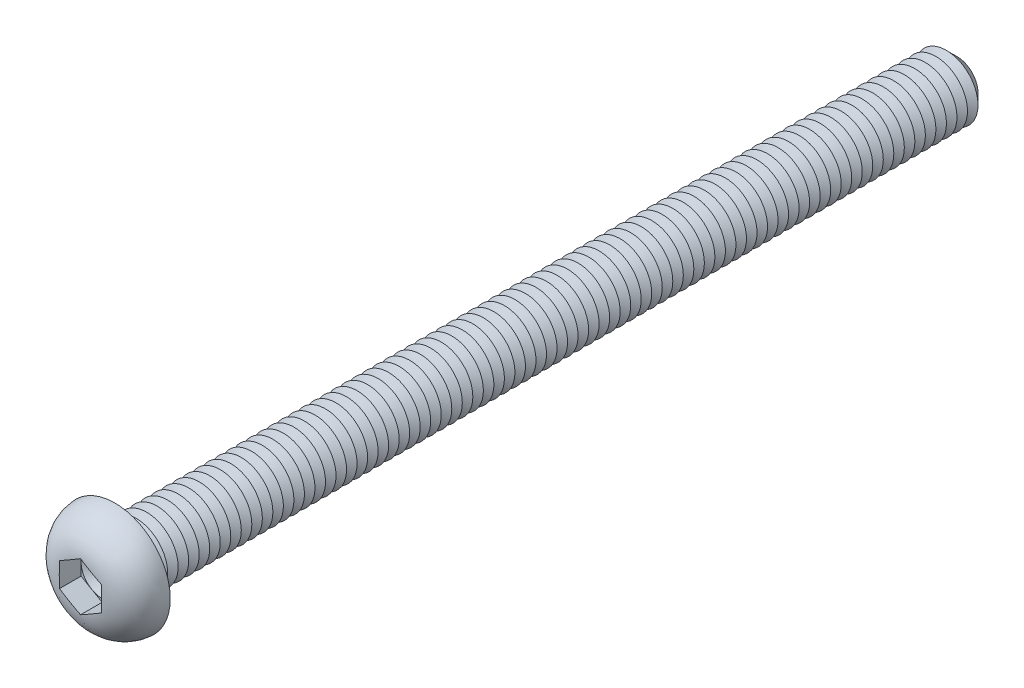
ISO-10303-21;
HEADER;
FILE_DESCRIPTION(('STEP AP214'),'2;1');
FILE_NAME('part.step','',(''),(''),'','','');
FILE_SCHEMA(('AUTOMOTIVE_DESIGN { 1 0 10303 214 1 1 1 1 }'));
ENDSEC;
DATA;
#1=APPLICATION_CONTEXT('core data for automotive mechanical design processes');
#2=APPLICATION_PROTOCOL_DEFINITION('international standard','automotive_design',2000,#1);
#3=PRODUCT_CONTEXT('',#1,'mechanical');
#4=PRODUCT('Part','Part','',(#3));
#5=PRODUCT_RELATED_PRODUCT_CATEGORY('part','',(#4));
#6=PRODUCT_DEFINITION_FORMATION('','',#4);
#7=PRODUCT_DEFINITION_CONTEXT('part definition',#1,'design');
#8=PRODUCT_DEFINITION('design','',#6,#7);
#9=PRODUCT_DEFINITION_SHAPE('','',#8);
#10=(LENGTH_UNIT() NAMED_UNIT(*) SI_UNIT(.MILLI.,.METRE.));
#11=(NAMED_UNIT(*) PLANE_ANGLE_UNIT() SI_UNIT($,.RADIAN.));
#12=(NAMED_UNIT(*) SI_UNIT($,.STERADIAN.) SOLID_ANGLE_UNIT());
#13=UNCERTAINTY_MEASURE_WITH_UNIT(LENGTH_MEASURE(1.E-05),#10,'distance_accuracy_value','');
#14=(GEOMETRIC_REPRESENTATION_CONTEXT(3) GLOBAL_UNCERTAINTY_ASSIGNED_CONTEXT((#13)) GLOBAL_UNIT_ASSIGNED_CONTEXT((#10,
#11,#12)) REPRESENTATION_CONTEXT('',''));
#15=CARTESIAN_POINT('',(0.,0.,0.));
#16=DIRECTION('',(0.,0.,1.));
#17=DIRECTION('',(1.,0.,0.));
#18=AXIS2_PLACEMENT_3D('',#15,#16,#17);
#19=CARTESIAN_POINT('',(0.,0.,1.22));
#20=DIRECTION('',(0.,0.,1.));
#21=DIRECTION('',(1.,0.,0.));
#22=AXIS2_PLACEMENT_3D('',#19,#20,#21);
#23=PLANE('',#22);
#24=CARTESIAN_POINT('',(0.,0.,1.22));
#25=DIRECTION('',(0.,0.,1.));
#26=DIRECTION('',(1.,0.,0.));
#27=AXIS2_PLACEMENT_3D('',#24,#25,#26);
#28=CIRCLE('',#27,2.);
#29=CARTESIAN_POINT('',(2.,0.,1.22));
#30=VERTEX_POINT('',#29);
#31=CARTESIAN_POINT('',(1.,1.73205080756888,1.22));
#32=VERTEX_POINT('',#31);
#33=EDGE_CURVE('E117',#30,#32,#28,.T.);
#34=ORIENTED_EDGE('',*,*,#33,.F.);
#35=DIRECTION('',(0.,1.,0.));
#36=VECTOR('',#35,1.);
#37=CARTESIAN_POINT('',(2.,-1.15470053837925,1.22));
#38=LINE('',#37,#36);
#39=CARTESIAN_POINT('',(2.,1.15470053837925,1.22));
#40=VERTEX_POINT('',#39);
#41=EDGE_CURVE('E140',#30,#40,#38,.T.);
#42=ORIENTED_EDGE('',*,*,#41,.T.);
#43=DIRECTION('',(-0.866025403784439,0.5,0.));
#44=VECTOR('',#43,1.);
#45=CARTESIAN_POINT('',(2.,1.15470053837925,1.22));
#46=LINE('',#45,#44);
#47=EDGE_CURVE('E136',#40,#32,#46,.T.);
#48=ORIENTED_EDGE('',*,*,#47,.T.);
#49=EDGE_LOOP('',(#34,#42,#48));
#50=FACE_BOUND('',#49,.T.);
#51=ADVANCED_FACE('F39',(#50),#23,.T.);
#52=CARTESIAN_POINT('',(0.,0.,1.22));
#53=DIRECTION('',(0.,0.,1.));
#54=DIRECTION('',(1.,0.,0.));
#55=AXIS2_PLACEMENT_3D('',#52,#53,#54);
#56=CIRCLE('',#55,2.);
#57=CARTESIAN_POINT('',(-1.,1.73205080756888,1.22));
#58=VERTEX_POINT('',#57);
#59=EDGE_CURVE('E11',#32,#58,#56,.T.);
#60=ORIENTED_EDGE('',*,*,#59,.F.);
#61=CARTESIAN_POINT('',(0.,2.3094010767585,1.22));
#62=VERTEX_POINT('',#61);
#63=EDGE_CURVE('E130',#32,#62,#46,.T.);
#64=ORIENTED_EDGE('',*,*,#63,.T.);
#65=DIRECTION('',(-0.866025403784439,-0.5,0.));
#66=VECTOR('',#65,1.);
#67=CARTESIAN_POINT('',(0.,2.3094010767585,1.22));
#68=LINE('',#67,#66);
#69=EDGE_CURVE('E131',#62,#58,#68,.T.);
#70=ORIENTED_EDGE('',*,*,#69,.T.);
#71=EDGE_LOOP('',(#60,#64,#70));
#72=FACE_BOUND('',#71,.T.);
#73=ADVANCED_FACE('F129',(#72),#23,.T.);
#74=CARTESIAN_POINT('',(-2.,0.,1.22));
#75=VERTEX_POINT('',#74);
#76=EDGE_CURVE('E49',#58,#75,#56,.T.);
#77=ORIENTED_EDGE('',*,*,#76,.F.);
#78=CARTESIAN_POINT('',(-2.,1.15470053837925,1.22));
#79=VERTEX_POINT('',#78);
#80=EDGE_CURVE('E143',#58,#79,#68,.T.);
#81=ORIENTED_EDGE('',*,*,#80,.T.);
#82=DIRECTION('',(0.,-1.,0.));
#83=VECTOR('',#82,1.);
#84=CARTESIAN_POINT('',(-2.,1.15470053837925,1.22));
#85=LINE('',#84,#83);
#86=EDGE_CURVE('E153',#79,#75,#85,.T.);
#87=ORIENTED_EDGE('',*,*,#86,.T.);
#88=EDGE_LOOP('',(#77,#81,#87));
#89=FACE_BOUND('',#88,.T.);
#90=ADVANCED_FACE('F273',(#89),#23,.T.);
#91=CARTESIAN_POINT('',(-1.,-1.73205080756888,1.22));
#92=VERTEX_POINT('',#91);
#93=EDGE_CURVE('E255',#75,#92,#56,.T.);
#94=ORIENTED_EDGE('',*,*,#93,.F.);
#95=CARTESIAN_POINT('',(-2.,-1.15470053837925,1.22));
#96=VERTEX_POINT('',#95);
#97=EDGE_CURVE('E152',#75,#96,#85,.T.);
#98=ORIENTED_EDGE('',*,*,#97,.T.);
#99=DIRECTION('',(0.866025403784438,-0.5,0.));
#100=VECTOR('',#99,1.);
#101=CARTESIAN_POINT('',(-2.,-1.15470053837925,1.22));
#102=LINE('',#101,#100);
#103=EDGE_CURVE('E158',#96,#92,#102,.T.);
#104=ORIENTED_EDGE('',*,*,#103,.T.);
#105=EDGE_LOOP('',(#94,#98,#104));
#106=FACE_BOUND('',#105,.T.);
#107=ADVANCED_FACE('F268',(#106),#23,.T.);
#108=CARTESIAN_POINT('',(0.999999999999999,-1.73205080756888,1.22));
#109=VERTEX_POINT('',#108);
#110=EDGE_CURVE('E56',#92,#109,#56,.T.);
#111=ORIENTED_EDGE('',*,*,#110,.F.);
#112=CARTESIAN_POINT('',(0.,-2.3094010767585,1.22));
#113=VERTEX_POINT('',#112);
#114=EDGE_CURVE('E157',#92,#113,#102,.T.);
#115=ORIENTED_EDGE('',*,*,#114,.T.);
#116=DIRECTION('',(0.866025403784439,0.5,0.));
#117=VECTOR('',#116,1.);
#118=CARTESIAN_POINT('',(0.,-2.3094010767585,1.22));
#119=LINE('',#118,#117);
#120=EDGE_CURVE('E163',#113,#109,#119,.T.);
#121=ORIENTED_EDGE('',*,*,#120,.T.);
#122=EDGE_LOOP('',(#111,#115,#121));
#123=FACE_BOUND('',#122,.T.);
#124=ADVANCED_FACE('F311',(#123),#23,.T.);
#125=CARTESIAN_POINT('',(0.,0.,-80.));
#126=DIRECTION('',(0.,0.,1.));
#127=DIRECTION('',(1.,0.,0.));
#128=AXIS2_PLACEMENT_3D('',#125,#126,#127);
#129=CYLINDRICAL_SURFACE('',#128,3.);
#130=CARTESIAN_POINT('',(0.,0.,-0.399999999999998));
#131=DIRECTION('',(0.,0.,1.));
#132=DIRECTION('',(1.,0.,0.));
#133=AXIS2_PLACEMENT_3D('',#130,#131,#132);
#134=CIRCLE('',#133,3.);
#135=CARTESIAN_POINT('',(3.,0.,-0.399999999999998));
#136=VERTEX_POINT('',#135);
#137=EDGE_CURVE('E242',#136,#136,#134,.F.);
#138=ORIENTED_EDGE('',*,*,#137,.T.);
#139=EDGE_LOOP('',(#138));
#140=FACE_BOUND('',#139,.T.);
#141=CARTESIAN_POINT('',(0.,0.,-1.));
#142=DIRECTION('',(0.,0.,1.));
#143=DIRECTION('',(1.,0.,0.));
#144=AXIS2_PLACEMENT_3D('',#141,#142,#143);
#145=CIRCLE('',#144,3.00000000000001);
#146=CARTESIAN_POINT('',(3.00000000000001,0.,-1.));
#147=VERTEX_POINT('',#146);
#148=EDGE_CURVE('E138',#147,#147,#145,.T.);
#149=ORIENTED_EDGE('',*,*,#148,.T.);
#150=EDGE_LOOP('',(#149));
#151=FACE_BOUND('',#150,.T.);
#152=ADVANCED_FACE('F312',(#140,#151),#129,.T.);
#153=CARTESIAN_POINT('',(0.,5.25,0.));
#154=DIRECTION('',(0.,0.,1.));
#155=DIRECTION('',(1.,0.,0.));
#156=AXIS2_PLACEMENT_3D('',#153,#154,#155);
#157=PLANE('',#156);
#158=CARTESIAN_POINT('',(0.,0.,0.));
#159=DIRECTION('',(0.,0.,1.));
#160=DIRECTION('',(1.,0.,0.));
#161=AXIS2_PLACEMENT_3D('',#158,#159,#160);
#162=CIRCLE('',#161,3.4);
#163=CARTESIAN_POINT('',(3.4,0.,0.));
#164=VERTEX_POINT('',#163);
#165=EDGE_CURVE('E245',#164,#164,#162,.T.);
#166=ORIENTED_EDGE('',*,*,#165,.T.);
#167=EDGE_LOOP('',(#166));
#168=FACE_BOUND('',#167,.T.);
#169=CARTESIAN_POINT('',(0.,0.,0.));
#170=DIRECTION('',(0.,0.,1.));
#171=DIRECTION('',(1.,0.,0.));
#172=AXIS2_PLACEMENT_3D('',#169,#170,#171);
#173=CIRCLE('',#172,5.25);
#174=CARTESIAN_POINT('',(5.25,0.,0.));
#175=VERTEX_POINT('',#174);
#176=EDGE_CURVE('E174',#175,#175,#173,.T.);
#177=ORIENTED_EDGE('',*,*,#176,.F.);
#178=EDGE_LOOP('',(#177));
#179=FACE_BOUND('',#178,.T.);
#180=ADVANCED_FACE('F315',(#168,#179),#157,.F.);
#181=CARTESIAN_POINT('',(0.,0.,-0.0999999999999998));
#182=DIRECTION('',(0.,0.,1.));
#183=DIRECTION('',(1.,0.,0.));
#184=AXIS2_PLACEMENT_3D('',#181,#182,#183);
#185=DEGENERATE_TOROIDAL_SURFACE('',#184,1.85147090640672,3.4,.T.);
#186=CARTESIAN_POINT('',(-2.0002,1.15458506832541,3.26900492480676));
#187=CARTESIAN_POINT('',(-1.91694658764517,1.20265144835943,3.27552708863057));
#188=CARTESIAN_POINT('',(-1.83362001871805,1.25076006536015,3.28041849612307));
#189=CARTESIAN_POINT('',(-1.66691146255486,1.34700929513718,3.28784569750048));
#190=CARTESIAN_POINT('',(-1.58352950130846,1.39514989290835,3.29038223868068));
#191=CARTESIAN_POINT('',(-1.4167967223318,1.49141310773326,3.29400753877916));
#192=CARTESIAN_POINT('',(-1.33344591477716,1.5395357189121,3.29509714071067));
#193=CARTESIAN_POINT('',(-1.16673007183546,1.63578915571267,3.29647051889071));
#194=CARTESIAN_POINT('',(-1.08336503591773,1.68391998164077,3.29675420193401));
#195=CARTESIAN_POINT('',(-0.916634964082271,1.78018163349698,3.29675420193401));
#196=CARTESIAN_POINT('',(-0.833269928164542,1.82831245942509,3.29647051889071));
#197=CARTESIAN_POINT('',(-0.666554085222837,1.92456589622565,3.29509714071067));
#198=CARTESIAN_POINT('',(-0.583203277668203,1.9726885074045,3.29400753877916));
#199=CARTESIAN_POINT('',(-0.416470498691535,2.06895172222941,3.29038223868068));
#200=CARTESIAN_POINT('',(-0.333088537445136,2.11709232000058,3.28784569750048));
#201=CARTESIAN_POINT('',(-0.166379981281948,2.21334154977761,3.28041849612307));
#202=CARTESIAN_POINT('',(-0.0830534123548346,2.26145016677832,3.27552708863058));
#203=CARTESIAN_POINT('',(0.000200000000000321,2.30951654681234,3.26900492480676));
#204=B_SPLINE_CURVE_WITH_KNOTS('',3,(#186,#187,#188,#189,#190,#191,#192,#193,#194,#195,#196,
#197,#198,#199,#200,#201,#202,#203),.UNSPECIFIED.,.F.,.F.,(4,2,2,2,2,2,2,2,4),(0.,
0.289010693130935,0.57792963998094,0.866680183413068,1.15546411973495,1.44424805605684,
1.73299859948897,2.02191754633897,2.31092823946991),.UNSPECIFIED.);
#205=CARTESIAN_POINT('',(-2.,1.15470053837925,3.26902062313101));
#206=VERTEX_POINT('',#205);
#207=CARTESIAN_POINT('',(1.70733705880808E-11,2.30940107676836,3.2690206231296));
#208=VERTEX_POINT('',#207);
#209=EDGE_CURVE('E196',#206,#208,#204,.T.);
#210=ORIENTED_EDGE('',*,*,#209,.T.);
#211=CARTESIAN_POINT('',(-0.000199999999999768,2.30951654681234,3.26900492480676));
#212=CARTESIAN_POINT('',(0.0830534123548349,2.26145016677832,3.27552708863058));
#213=CARTESIAN_POINT('',(0.166379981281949,2.21334154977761,3.28041849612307));
#214=CARTESIAN_POINT('',(0.333088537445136,2.11709232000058,3.28784569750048));
#215=CARTESIAN_POINT('',(0.416470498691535,2.06895172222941,3.29038223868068));
#216=CARTESIAN_POINT('',(0.583203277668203,1.9726885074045,3.29400753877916));
#217=CARTESIAN_POINT('',(0.666554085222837,1.92456589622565,3.29509714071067));
#218=CARTESIAN_POINT('',(0.833269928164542,1.82831245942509,3.29647051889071));
#219=CARTESIAN_POINT('',(0.916634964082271,1.78018163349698,3.29675420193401));
#220=CARTESIAN_POINT('',(1.08336503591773,1.68391998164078,3.29675420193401));
#221=CARTESIAN_POINT('',(1.16673007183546,1.63578915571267,3.29647051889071));
#222=CARTESIAN_POINT('',(1.33344591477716,1.5395357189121,3.29509714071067));
#223=CARTESIAN_POINT('',(1.4167967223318,1.49141310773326,3.29400753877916));
#224=CARTESIAN_POINT('',(1.58352950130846,1.39514989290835,3.29038223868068));
#225=CARTESIAN_POINT('',(1.66691146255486,1.34700929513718,3.28784569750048));
#226=CARTESIAN_POINT('',(1.83362001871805,1.25076006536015,3.28041849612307));
#227=CARTESIAN_POINT('',(1.91694658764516,1.20265144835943,3.27552708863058));
#228=CARTESIAN_POINT('',(2.0002,1.15458506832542,3.26900492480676));
#229=B_SPLINE_CURVE_WITH_KNOTS('',3,(#211,#212,#213,#214,#215,#216,#217,#218,#219,#220,#221,
#222,#223,#224,#225,#226,#227,#228),.UNSPECIFIED.,.F.,.F.,(4,2,2,2,2,2,2,2,4),(0.,
0.289010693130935,0.577929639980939,0.866680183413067,1.15546411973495,1.44424805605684,
1.73299859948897,2.02191754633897,2.31092823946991),.UNSPECIFIED.);
#230=CARTESIAN_POINT('',(2.,1.15470053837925,3.26902062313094));
#231=VERTEX_POINT('',#230);
#232=EDGE_CURVE('E225',#208,#231,#229,.T.);
#233=ORIENTED_EDGE('',*,*,#232,.T.);
#234=CARTESIAN_POINT('',(2.,0.,3.29675420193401));
#235=CARTESIAN_POINT('',(2.,-0.0838690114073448,3.29675159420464));
#236=CARTESIAN_POINT('',(2.,-0.167737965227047,3.29653427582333));
#237=CARTESIAN_POINT('',(2.,-0.335473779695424,3.29552217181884));
#238=CARTESIAN_POINT('',(2.,-0.419340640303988,3.29472737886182));
#239=CARTESIAN_POINT('',(2.,-0.587092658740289,3.29218243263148));
#240=CARTESIAN_POINT('',(2.,-0.670977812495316,3.29043194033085));
#241=CARTESIAN_POINT('',(2.,-0.838702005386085,3.28542814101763));
#242=CARTESIAN_POINT('',(2.,-0.922541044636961,3.28217483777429));
#243=CARTESIAN_POINT('',(2.,-1.173343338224,3.26923984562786));
#244=CARTESIAN_POINT('',(2.,-1.34017699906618,3.25638268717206));
#245=CARTESIAN_POINT('',(2.,-1.67225876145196,3.21731215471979));
#246=CARTESIAN_POINT('',(2.,-1.83750825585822,3.19111187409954));
#247=CARTESIAN_POINT('',(2.,-2.10571503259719,3.13417573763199));
#248=CARTESIAN_POINT('',(2.,-2.20973442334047,3.10844622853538));
#249=CARTESIAN_POINT('',(2.,-2.41562153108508,3.04936015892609));
#250=CARTESIAN_POINT('',(2.,-2.51748898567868,3.01600267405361));
#251=CARTESIAN_POINT('',(2.,-2.71832295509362,2.94120377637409));
#252=CARTESIAN_POINT('',(2.,-2.81728700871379,2.89975572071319));
#253=CARTESIAN_POINT('',(2.,-3.01134256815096,2.80859624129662));
#254=CARTESIAN_POINT('',(2.,-3.10643425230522,2.75888519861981));
#255=CARTESIAN_POINT('',(2.,-3.29253530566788,2.65079509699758));
#256=CARTESIAN_POINT('',(2.,-3.38350832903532,2.59235327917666));
#257=CARTESIAN_POINT('',(2.,-3.55964478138,2.46728791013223));
#258=CARTESIAN_POINT('',(2.,-3.64480873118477,2.40066509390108));
#259=CARTESIAN_POINT('',(2.,-3.80840353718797,2.25961603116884));
#260=CARTESIAN_POINT('',(2.,-3.88683504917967,2.18519054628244));
#261=CARTESIAN_POINT('',(2.,-4.03608847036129,2.02906828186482));
#262=CARTESIAN_POINT('',(2.,-4.106911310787,1.94737239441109));
#263=CARTESIAN_POINT('',(2.,-4.23287471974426,1.78665318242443));
#264=CARTESIAN_POINT('',(2.,-4.2888832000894,1.7083085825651));
#265=CARTESIAN_POINT('',(2.,-4.39372062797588,1.54691061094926));
#266=CARTESIAN_POINT('',(2.,-4.44254705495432,1.46385560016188));
#267=CARTESIAN_POINT('',(2.,-4.53249771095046,1.29375158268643));
#268=CARTESIAN_POINT('',(2.,-4.57362814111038,1.20670586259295));
#269=CARTESIAN_POINT('',(2.,-4.6478549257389,1.02924414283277));
#270=CARTESIAN_POINT('',(2.,-4.68094842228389,0.938826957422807));
#271=CARTESIAN_POINT('',(2.,-4.76413649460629,0.674747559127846));
#272=CARTESIAN_POINT('',(2.,-4.80368573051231,0.497625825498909));
#273=CARTESIAN_POINT('',(2.,-4.85179982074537,0.13932226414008));
#274=CARTESIAN_POINT('',(2.,-4.86036774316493,-0.0418591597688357));
#275=CARTESIAN_POINT('',(2.,-4.84642577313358,-0.399473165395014));
#276=CARTESIAN_POINT('',(2.,-4.82452156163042,-0.575929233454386));
#277=CARTESIAN_POINT('',(2.,-4.75142809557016,-0.922615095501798));
#278=CARTESIAN_POINT('',(2.,-4.70024536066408,-1.09284626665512));
#279=CARTESIAN_POINT('',(2.,-4.57020203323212,-1.42258491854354));
#280=CARTESIAN_POINT('',(2.,-4.49131097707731,-1.58208036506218));
#281=CARTESIAN_POINT('',(2.,-4.3083542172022,-1.8860021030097));
#282=CARTESIAN_POINT('',(2.,-4.2042742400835,-2.03041978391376));
#283=CARTESIAN_POINT('',(2.,-3.97174533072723,-2.30354399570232));
#284=CARTESIAN_POINT('',(2.,-3.84281347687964,-2.43183812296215));
#285=CARTESIAN_POINT('',(2.,-3.56631740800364,-2.66612298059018));
#286=CARTESIAN_POINT('',(2.,-3.41877418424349,-2.77213848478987));
#287=CARTESIAN_POINT('',(2.,-3.18261597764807,-2.91604941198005));
#288=CARTESIAN_POINT('',(2.,-3.09905663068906,-2.96247915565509));
#289=CARTESIAN_POINT('',(2.,-2.92856838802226,-3.04879370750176));
#290=CARTESIAN_POINT('',(2.,-2.84163827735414,-3.08867612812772));
#291=CARTESIAN_POINT('',(2.,-2.66495003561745,-3.16199567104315));
#292=CARTESIAN_POINT('',(2.,-2.57518752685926,-3.19542218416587));
#293=CARTESIAN_POINT('',(2.,-2.3936698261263,-3.25594506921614));
#294=CARTESIAN_POINT('',(2.,-2.30191676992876,-3.28304789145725));
#295=CARTESIAN_POINT('',(2.,-2.07265810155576,-3.34285611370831));
#296=CARTESIAN_POINT('',(2.,-1.93423373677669,-3.37205334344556));
#297=CARTESIAN_POINT('',(2.,-1.65546420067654,-3.419280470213));
#298=CARTESIAN_POINT('',(2.,-1.51511762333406,-3.43730169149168));
#299=CARTESIAN_POINT('',(2.,-1.23291689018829,-3.46473877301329));
#300=CARTESIAN_POINT('',(2.,-1.09105869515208,-3.47411015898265));
#301=CARTESIAN_POINT('',(2.,-0.807138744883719,-3.48717303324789));
#302=CARTESIAN_POINT('',(2.,-0.665077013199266,-3.4908651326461));
#303=CARTESIAN_POINT('',(2.,-0.451303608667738,-3.49429675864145));
#304=CARTESIAN_POINT('',(2.,-0.379602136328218,-3.49508825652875));
#305=CARTESIAN_POINT('',(2.,-0.236195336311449,-3.49619580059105));
#306=CARTESIAN_POINT('',(2.,-0.164490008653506,-3.49651184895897));
#307=CARTESIAN_POINT('',(2.,-0.0210718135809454,-3.49680708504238));
#308=CARTESIAN_POINT('',(2.,0.0506410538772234,-3.49678623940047));
#309=CARTESIAN_POINT('',(2.,0.194065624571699,-3.49639104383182));
#310=CARTESIAN_POINT('',(2.,0.265777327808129,-3.49601669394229));
#311=CARTESIAN_POINT('',(2.,0.480501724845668,-3.4941697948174));
#312=CARTESIAN_POINT('',(2.,0.623510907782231,-3.49197539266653));
#313=CARTESIAN_POINT('',(2.,0.909378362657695,-3.48318258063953));
#314=CARTESIAN_POINT('',(2.,1.05223667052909,-3.47658576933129));
#315=CARTESIAN_POINT('',(2.,1.30726724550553,-3.45800282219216));
#316=CARTESIAN_POINT('',(2.,1.41953767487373,-3.44745204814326));
#317=CARTESIAN_POINT('',(2.,1.64336701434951,-3.42020385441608));
#318=CARTESIAN_POINT('',(2.,1.75492585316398,-3.40350582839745));
#319=CARTESIAN_POINT('',(2.,1.97590795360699,-3.36293007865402));
#320=CARTESIAN_POINT('',(2.,2.08534088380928,-3.33910600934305));
#321=CARTESIAN_POINT('',(2.,2.30216001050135,-3.28336687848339));
#322=CARTESIAN_POINT('',(2.,2.40954602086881,-3.25145108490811));
#323=CARTESIAN_POINT('',(2.,2.62289868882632,-3.1784271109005));
#324=CARTESIAN_POINT('',(2.,2.72882262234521,-3.13719314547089));
#325=CARTESIAN_POINT('',(2.,2.93660837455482,-3.04548652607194));
#326=CARTESIAN_POINT('',(2.,3.03847031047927,-2.99501413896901));
#327=CARTESIAN_POINT('',(2.,3.23738754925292,-2.88459171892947));
#328=CARTESIAN_POINT('',(2.,3.33442546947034,-2.82461027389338));
#329=CARTESIAN_POINT('',(2.,3.52225616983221,-2.69545434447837));
#330=CARTESIAN_POINT('',(2.,3.61304636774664,-2.62627609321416));
#331=CARTESIAN_POINT('',(2.,3.77958578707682,-2.48563135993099));
#332=CARTESIAN_POINT('',(2.,3.85595570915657,-2.41489922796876));
#333=CARTESIAN_POINT('',(2.,4.00175744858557,-2.26661746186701));
#334=CARTESIAN_POINT('',(2.,4.07118992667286,-2.18906847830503));
#335=CARTESIAN_POINT('',(2.,4.20228235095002,-2.02784942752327));
#336=CARTESIAN_POINT('',(2.,4.26395450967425,-1.94418931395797));
#337=CARTESIAN_POINT('',(2.,4.37897455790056,-1.7713710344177));
#338=CARTESIAN_POINT('',(2.,4.43232318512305,-1.68221335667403));
#339=CARTESIAN_POINT('',(2.,4.5685109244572,-1.42722170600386));
#340=CARTESIAN_POINT('',(2.,4.64167742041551,-1.25607726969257));
#341=CARTESIAN_POINT('',(2.,4.75695354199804,-0.903699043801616));
#342=CARTESIAN_POINT('',(2.,4.79906366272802,-0.722465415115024));
#343=CARTESIAN_POINT('',(2.,4.84982785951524,-0.362243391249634));
#344=CARTESIAN_POINT('',(2.,4.85966759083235,-0.183422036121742));
#345=CARTESIAN_POINT('',(2.,4.84889099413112,0.17327689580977));
#346=CARTESIAN_POINT('',(2.,4.82827907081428,0.351154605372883));
#347=CARTESIAN_POINT('',(2.,4.75760776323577,0.699332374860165));
#348=CARTESIAN_POINT('',(2.,4.70780624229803,0.869684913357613));
#349=CARTESIAN_POINT('',(2.,4.58058971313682,1.199716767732));
#350=CARTESIAN_POINT('',(2.,4.50317623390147,1.35939667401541));
#351=CARTESIAN_POINT('',(2.,4.32230037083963,1.66542907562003));
#352=CARTESIAN_POINT('',(2.,4.21858077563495,1.81162931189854));
#353=CARTESIAN_POINT('',(2.,3.98879583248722,2.08527000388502));
#354=CARTESIAN_POINT('',(2.,3.86272429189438,2.21270524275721));
#355=CARTESIAN_POINT('',(2.,3.58743550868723,2.45020985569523));
#356=CARTESIAN_POINT('',(2.,3.43756474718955,2.55951924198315));
#357=CARTESIAN_POINT('',(2.,3.12282273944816,2.7535430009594));
#358=CARTESIAN_POINT('',(2.,2.95795742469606,2.83826704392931));
#359=CARTESIAN_POINT('',(2.,2.67096435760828,2.96064273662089));
#360=CARTESIAN_POINT('',(2.,2.55150855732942,3.00473766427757));
#361=CARTESIAN_POINT('',(2.,2.30905936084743,3.08191633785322));
#362=CARTESIAN_POINT('',(2.,2.18606487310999,3.11499664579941));
#363=CARTESIAN_POINT('',(2.,1.93761764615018,3.17114962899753));
#364=CARTESIAN_POINT('',(2.,1.8121607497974,3.19420352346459));
#365=CARTESIAN_POINT('',(2.,1.56000755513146,3.23170431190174));
#366=CARTESIAN_POINT('',(2.,1.43331126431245,3.24615125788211));
#367=CARTESIAN_POINT('',(2.,1.19785080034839,3.26676473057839));
#368=CARTESIAN_POINT('',(2.,1.08915974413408,3.27383022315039));
#369=CARTESIAN_POINT('',(2.,0.87159878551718,3.28448481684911));
#370=CARTESIAN_POINT('',(2.,0.762728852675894,3.28807324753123));
#371=CARTESIAN_POINT('',(2.,0.54488171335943,3.29312180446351));
#372=CARTESIAN_POINT('',(2.,0.435904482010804,3.29458062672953));
#373=CARTESIAN_POINT('',(2.,0.217951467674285,3.29639847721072));
#374=CARTESIAN_POINT('',(2.,0.108975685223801,3.29675759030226));
#375=CARTESIAN_POINT('',(2.,0.,3.29675420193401));
#376=B_SPLINE_CURVE_WITH_KNOTS('',3,(#234,#235,#236,#237,#238,#239,#240,#241,#242,#243,#244,
#245,#246,#247,#248,#249,#250,#251,#252,#253,#254,#255,#256,#257,#258,#259,#260,#261,#262,#263,
#264,#265,#266,#267,#268,#269,#270,#271,#272,#273,#274,#275,#276,#277,#278,#279,#280,#281,#282,
#283,#284,#285,#286,#287,#288,#289,#290,#291,#292,#293,#294,#295,#296,#297,#298,#299,#300,#301,
#302,#303,#304,#305,#306,#307,#308,#309,#310,#311,#312,#313,#314,#315,#316,#317,#318,#319,#320,
#321,#322,#323,#324,#325,#326,#327,#328,#329,#330,#331,#332,#333,#334,#335,#336,#337,#338,#339,
#340,#341,#342,#343,#344,#345,#346,#347,#348,#349,#350,#351,#352,#353,#354,#355,#356,#357,#358,
#359,#360,#361,#362,#363,#364,#365,#366,#367,#368,#369,#370,#371,#372,#373,#374,#375),
.UNSPECIFIED.,.T.,.F.,(4,2,2,2,2,2,2,2,2,2,2,2,2,2,2,2,2,2,2,2,2,2,2,2,2,2,2,2,2,2,2,2,2,2,2,2,
2,2,2,2,2,2,2,2,2,2,2,2,2,2,2,2,2,2,2,2,2,2,2,2,2,2,2,2,2,2,2,2,2,2,4),(0.,0.251606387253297,
0.503215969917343,0.754914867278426,1.00661313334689,1.50825543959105,2.00940643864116,
2.33061510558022,2.65186271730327,2.97337521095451,3.29487288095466,3.61880390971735,
3.94270585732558,4.26657621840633,4.59040689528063,4.8789527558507,5.16759964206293,
5.45601293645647,5.74452864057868,6.28608750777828,6.82759274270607,7.35848716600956,
7.8892634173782,8.42062506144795,8.95228851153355,9.49557283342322,10.0382497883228,
10.3247866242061,10.6114277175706,10.8985359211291,11.1853499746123,11.6091713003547,
12.0333212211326,12.4596400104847,12.8859129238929,13.1010304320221,13.316146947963,
13.5312847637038,13.746422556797,14.1754765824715,14.6043748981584,14.9425387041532,
15.2807358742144,15.6164481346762,15.9521907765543,16.2927694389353,16.6333382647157,
16.9750565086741,17.3169151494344,17.6287548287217,17.9405647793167,18.2518777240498,
18.5631630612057,19.1185081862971,19.6738444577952,20.20853386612,20.7431459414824,
21.2731049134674,21.8030345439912,22.3383600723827,22.8738341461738,23.4279697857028,
23.9818871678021,24.3633752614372,24.7449823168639,25.1273011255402,25.5096176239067,
25.8363061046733,26.163057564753,26.4900090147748,26.8169352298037),.UNSPECIFIED.);
#377=CARTESIAN_POINT('',(2.,-1.15470053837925,3.26902062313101));
#378=VERTEX_POINT('',#377);
#379=EDGE_CURVE('E234',#231,#378,#376,.T.);
#380=ORIENTED_EDGE('',*,*,#379,.T.);
#381=CARTESIAN_POINT('',(2.0002,-1.15458506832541,3.26900492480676));
#382=CARTESIAN_POINT('',(1.91694658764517,-1.20265144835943,3.27552708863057));
#383=CARTESIAN_POINT('',(1.83362001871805,-1.25076006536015,3.28041849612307));
#384=CARTESIAN_POINT('',(1.66691146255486,-1.34700929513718,3.28784569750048));
#385=CARTESIAN_POINT('',(1.58352950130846,-1.39514989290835,3.29038223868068));
#386=CARTESIAN_POINT('',(1.4167967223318,-1.49141310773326,3.29400753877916));
#387=CARTESIAN_POINT('',(1.33344591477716,-1.5395357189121,3.29509714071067));
#388=CARTESIAN_POINT('',(1.16673007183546,-1.63578915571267,3.29647051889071));
#389=CARTESIAN_POINT('',(1.08336503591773,-1.68391998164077,3.29675420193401));
#390=CARTESIAN_POINT('',(0.916634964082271,-1.78018163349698,3.29675420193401));
#391=CARTESIAN_POINT('',(0.833269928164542,-1.82831245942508,3.29647051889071));
#392=CARTESIAN_POINT('',(0.666554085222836,-1.92456589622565,3.29509714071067));
#393=CARTESIAN_POINT('',(0.583203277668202,-1.97268850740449,3.29400753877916));
#394=CARTESIAN_POINT('',(0.416470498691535,-2.06895172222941,3.29038223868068));
#395=CARTESIAN_POINT('',(0.333088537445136,-2.11709232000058,3.28784569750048));
#396=CARTESIAN_POINT('',(0.166379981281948,-2.2133415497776,3.28041849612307));
#397=CARTESIAN_POINT('',(0.0830534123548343,-2.26145016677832,3.27552708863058));
#398=CARTESIAN_POINT('',(-0.000200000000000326,-2.30951654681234,3.26900492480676));
#399=B_SPLINE_CURVE_WITH_KNOTS('',3,(#381,#382,#383,#384,#385,#386,#387,#388,#389,#390,#391,
#392,#393,#394,#395,#396,#397,#398),.UNSPECIFIED.,.F.,.F.,(4,2,2,2,2,2,2,2,4),(0.,
0.289010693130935,0.57792963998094,0.866680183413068,1.15546411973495,1.44424805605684,
1.73299859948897,2.02191754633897,2.31092823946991),.UNSPECIFIED.);
#400=CARTESIAN_POINT('',(0.,-2.3094010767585,3.26902062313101));
#401=VERTEX_POINT('',#400);
#402=EDGE_CURVE('E284',#378,#401,#399,.T.);
#403=ORIENTED_EDGE('',*,*,#402,.T.);
#404=CARTESIAN_POINT('',(0.000199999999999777,-2.30951654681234,3.26900492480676));
#405=CARTESIAN_POINT('',(-0.083053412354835,-2.26145016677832,3.27552708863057));
#406=CARTESIAN_POINT('',(-0.166379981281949,-2.21334154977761,3.28041849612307));
#407=CARTESIAN_POINT('',(-0.333088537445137,-2.11709232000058,3.28784569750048));
#408=CARTESIAN_POINT('',(-0.416470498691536,-2.06895172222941,3.29038223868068));
#409=CARTESIAN_POINT('',(-0.583203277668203,-1.97268850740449,3.29400753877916));
#410=CARTESIAN_POINT('',(-0.666554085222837,-1.92456589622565,3.29509714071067));
#411=CARTESIAN_POINT('',(-0.833269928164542,-1.82831245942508,3.29647051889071));
#412=CARTESIAN_POINT('',(-0.916634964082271,-1.78018163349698,3.29675420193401));
#413=CARTESIAN_POINT('',(-1.08336503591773,-1.68391998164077,3.29675420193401));
#414=CARTESIAN_POINT('',(-1.16673007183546,-1.63578915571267,3.29647051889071));
#415=CARTESIAN_POINT('',(-1.33344591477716,-1.5395357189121,3.29509714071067));
#416=CARTESIAN_POINT('',(-1.4167967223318,-1.49141310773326,3.29400753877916));
#417=CARTESIAN_POINT('',(-1.58352950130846,-1.39514989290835,3.29038223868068));
#418=CARTESIAN_POINT('',(-1.66691146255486,-1.34700929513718,3.28784569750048));
#419=CARTESIAN_POINT('',(-1.83362001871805,-1.25076006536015,3.28041849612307));
#420=CARTESIAN_POINT('',(-1.91694658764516,-1.20265144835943,3.27552708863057));
#421=CARTESIAN_POINT('',(-2.0002,-1.15458506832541,3.26900492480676));
#422=B_SPLINE_CURVE_WITH_KNOTS('',3,(#404,#405,#406,#407,#408,#409,#410,#411,#412,#413,#414,
#415,#416,#417,#418,#419,#420,#421),.UNSPECIFIED.,.F.,.F.,(4,2,2,2,2,2,2,2,4),(0.,
0.289010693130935,0.577929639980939,0.866680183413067,1.15546411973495,1.44424805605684,
1.73299859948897,2.02191754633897,2.31092823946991),.UNSPECIFIED.);
#423=CARTESIAN_POINT('',(-2.,-1.15470053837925,3.26902062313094));
#424=VERTEX_POINT('',#423);
#425=EDGE_CURVE('E280',#401,#424,#422,.T.);
#426=ORIENTED_EDGE('',*,*,#425,.T.);
#427=CARTESIAN_POINT('',(-2.,0.,3.29675420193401));
#428=CARTESIAN_POINT('',(-2.,0.0838690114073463,3.29675159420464));
#429=CARTESIAN_POINT('',(-2.,0.167737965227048,3.29653427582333));
#430=CARTESIAN_POINT('',(-2.,0.335473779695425,3.29552217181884));
#431=CARTESIAN_POINT('',(-2.,0.41934064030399,3.29472737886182));
#432=CARTESIAN_POINT('',(-2.,0.58709265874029,3.29218243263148));
#433=CARTESIAN_POINT('',(-2.,0.670977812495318,3.29043194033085));
#434=CARTESIAN_POINT('',(-2.,0.838702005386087,3.28542814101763));
#435=CARTESIAN_POINT('',(-2.,0.922541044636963,3.28217483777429));
#436=CARTESIAN_POINT('',(-2.,1.173343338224,3.26923984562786));
#437=CARTESIAN_POINT('',(-2.,1.34017699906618,3.25638268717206));
#438=CARTESIAN_POINT('',(-2.,1.67225876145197,3.21731215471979));
#439=CARTESIAN_POINT('',(-2.,1.83750825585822,3.19111187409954));
#440=CARTESIAN_POINT('',(-2.,2.10571503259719,3.13417573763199));
#441=CARTESIAN_POINT('',(-2.,2.20973442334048,3.10844622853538));
#442=CARTESIAN_POINT('',(-2.,2.41562153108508,3.04936015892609));
#443=CARTESIAN_POINT('',(-2.,2.51748898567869,3.01600267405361));
#444=CARTESIAN_POINT('',(-2.,2.71832295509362,2.94120377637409));
#445=CARTESIAN_POINT('',(-2.,2.81728700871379,2.89975572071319));
#446=CARTESIAN_POINT('',(-2.,3.01134256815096,2.80859624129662));
#447=CARTESIAN_POINT('',(-2.,3.10643425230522,2.75888519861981));
#448=CARTESIAN_POINT('',(-2.,3.29253530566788,2.65079509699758));
#449=CARTESIAN_POINT('',(-2.,3.38350832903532,2.59235327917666));
#450=CARTESIAN_POINT('',(-2.,3.55964478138,2.46728791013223));
#451=CARTESIAN_POINT('',(-2.,3.64480873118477,2.40066509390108));
#452=CARTESIAN_POINT('',(-2.,3.80840353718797,2.25961603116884));
#453=CARTESIAN_POINT('',(-2.,3.88683504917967,2.18519054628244));
#454=CARTESIAN_POINT('',(-2.,4.03608847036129,2.02906828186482));
#455=CARTESIAN_POINT('',(-2.,4.106911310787,1.94737239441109));
#456=CARTESIAN_POINT('',(-2.,4.23287471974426,1.78665318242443));
#457=CARTESIAN_POINT('',(-2.,4.2888832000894,1.7083085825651));
#458=CARTESIAN_POINT('',(-2.,4.39372062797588,1.54691061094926));
#459=CARTESIAN_POINT('',(-2.,4.44254705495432,1.46385560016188));
#460=CARTESIAN_POINT('',(-2.,4.53249771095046,1.29375158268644));
#461=CARTESIAN_POINT('',(-2.,4.57362814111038,1.20670586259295));
#462=CARTESIAN_POINT('',(-2.,4.6478549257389,1.02924414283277));
#463=CARTESIAN_POINT('',(-2.,4.68094842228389,0.938826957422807));
#464=CARTESIAN_POINT('',(-2.,4.76413649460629,0.674747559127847));
#465=CARTESIAN_POINT('',(-2.,4.80368573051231,0.497625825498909));
#466=CARTESIAN_POINT('',(-2.,4.85179982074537,0.13932226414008));
#467=CARTESIAN_POINT('',(-2.,4.86036774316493,-0.0418591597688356));
#468=CARTESIAN_POINT('',(-2.,4.84642577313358,-0.399473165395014));
#469=CARTESIAN_POINT('',(-2.,4.82452156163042,-0.575929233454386));
#470=CARTESIAN_POINT('',(-2.,4.75142809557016,-0.922615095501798));
#471=CARTESIAN_POINT('',(-2.,4.70024536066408,-1.09284626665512));
#472=CARTESIAN_POINT('',(-2.,4.57020203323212,-1.42258491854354));
#473=CARTESIAN_POINT('',(-2.,4.49131097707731,-1.58208036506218));
#474=CARTESIAN_POINT('',(-2.,4.3083542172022,-1.8860021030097));
#475=CARTESIAN_POINT('',(-2.,4.2042742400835,-2.03041978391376));
#476=CARTESIAN_POINT('',(-2.,3.97174533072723,-2.30354399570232));
#477=CARTESIAN_POINT('',(-2.,3.84281347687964,-2.43183812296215));
#478=CARTESIAN_POINT('',(-2.,3.56631740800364,-2.66612298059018));
#479=CARTESIAN_POINT('',(-2.,3.41877418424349,-2.77213848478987));
#480=CARTESIAN_POINT('',(-2.,3.18261597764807,-2.91604941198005));
#481=CARTESIAN_POINT('',(-2.,3.09905663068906,-2.96247915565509));
#482=CARTESIAN_POINT('',(-2.,2.92856838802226,-3.04879370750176));
#483=CARTESIAN_POINT('',(-2.,2.84163827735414,-3.08867612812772));
#484=CARTESIAN_POINT('',(-2.,2.66495003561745,-3.16199567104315));
#485=CARTESIAN_POINT('',(-2.,2.57518752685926,-3.19542218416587));
#486=CARTESIAN_POINT('',(-2.,2.3936698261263,-3.25594506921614));
#487=CARTESIAN_POINT('',(-2.,2.30191676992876,-3.28304789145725));
#488=CARTESIAN_POINT('',(-2.,2.07265810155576,-3.34285611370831));
#489=CARTESIAN_POINT('',(-2.,1.93423373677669,-3.37205334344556));
#490=CARTESIAN_POINT('',(-2.,1.65546420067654,-3.419280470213));
#491=CARTESIAN_POINT('',(-2.,1.51511762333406,-3.43730169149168));
#492=CARTESIAN_POINT('',(-2.,1.23291689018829,-3.46473877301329));
#493=CARTESIAN_POINT('',(-2.,1.09105869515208,-3.47411015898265));
#494=CARTESIAN_POINT('',(-2.,0.807138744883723,-3.48717303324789));
#495=CARTESIAN_POINT('',(-2.,0.66507701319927,-3.4908651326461));
#496=CARTESIAN_POINT('',(-2.,0.451303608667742,-3.49429675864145));
#497=CARTESIAN_POINT('',(-2.,0.379602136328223,-3.49508825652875));
#498=CARTESIAN_POINT('',(-2.,0.236195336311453,-3.49619580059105));
#499=CARTESIAN_POINT('',(-2.,0.16449000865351,-3.49651184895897));
#500=CARTESIAN_POINT('',(-2.,0.0210718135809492,-3.49680708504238));
#501=CARTESIAN_POINT('',(-2.,-0.0506410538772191,-3.49678623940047));
#502=CARTESIAN_POINT('',(-2.,-0.194065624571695,-3.49639104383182));
#503=CARTESIAN_POINT('',(-2.,-0.265777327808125,-3.49601669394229));
#504=CARTESIAN_POINT('',(-2.,-0.480501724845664,-3.4941697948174));
#505=CARTESIAN_POINT('',(-2.,-0.623510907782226,-3.49197539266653));
#506=CARTESIAN_POINT('',(-2.,-0.909378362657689,-3.48318258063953));
#507=CARTESIAN_POINT('',(-2.,-1.05223667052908,-3.47658576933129));
#508=CARTESIAN_POINT('',(-2.,-1.30726724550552,-3.45800282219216));
#509=CARTESIAN_POINT('',(-2.,-1.41953767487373,-3.44745204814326));
#510=CARTESIAN_POINT('',(-2.,-1.6433670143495,-3.42020385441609));
#511=CARTESIAN_POINT('',(-2.,-1.75492585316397,-3.40350582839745));
#512=CARTESIAN_POINT('',(-2.,-1.97590795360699,-3.36293007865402));
#513=CARTESIAN_POINT('',(-2.,-2.08534088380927,-3.33910600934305));
#514=CARTESIAN_POINT('',(-2.,-2.30216001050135,-3.28336687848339));
#515=CARTESIAN_POINT('',(-2.,-2.4095460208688,-3.25145108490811));
#516=CARTESIAN_POINT('',(-2.,-2.62289868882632,-3.1784271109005));
#517=CARTESIAN_POINT('',(-2.,-2.72882262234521,-3.13719314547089));
#518=CARTESIAN_POINT('',(-2.,-2.93660837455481,-3.04548652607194));
#519=CARTESIAN_POINT('',(-2.,-3.03847031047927,-2.99501413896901));
#520=CARTESIAN_POINT('',(-2.,-3.23738754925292,-2.88459171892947));
#521=CARTESIAN_POINT('',(-2.,-3.33442546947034,-2.82461027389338));
#522=CARTESIAN_POINT('',(-2.,-3.52225616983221,-2.69545434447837));
#523=CARTESIAN_POINT('',(-2.,-3.61304636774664,-2.62627609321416));
#524=CARTESIAN_POINT('',(-2.,-3.77958578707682,-2.48563135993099));
#525=CARTESIAN_POINT('',(-2.,-3.85595570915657,-2.41489922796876));
#526=CARTESIAN_POINT('',(-2.,-4.00175744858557,-2.26661746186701));
#527=CARTESIAN_POINT('',(-2.,-4.07118992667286,-2.18906847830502));
#528=CARTESIAN_POINT('',(-2.,-4.20228235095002,-2.02784942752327));
#529=CARTESIAN_POINT('',(-2.,-4.26395450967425,-1.94418931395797));
#530=CARTESIAN_POINT('',(-2.,-4.37897455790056,-1.7713710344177));
#531=CARTESIAN_POINT('',(-2.,-4.43232318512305,-1.68221335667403));
#532=CARTESIAN_POINT('',(-2.,-4.5685109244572,-1.42722170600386));
#533=CARTESIAN_POINT('',(-2.,-4.64167742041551,-1.25607726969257));
#534=CARTESIAN_POINT('',(-2.,-4.75695354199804,-0.903699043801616));
#535=CARTESIAN_POINT('',(-2.,-4.79906366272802,-0.722465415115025));
#536=CARTESIAN_POINT('',(-2.,-4.84982785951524,-0.362243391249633));
#537=CARTESIAN_POINT('',(-2.,-4.85966759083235,-0.18342203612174));
#538=CARTESIAN_POINT('',(-2.,-4.84889099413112,0.173276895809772));
#539=CARTESIAN_POINT('',(-2.,-4.82827907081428,0.351154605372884));
#540=CARTESIAN_POINT('',(-2.,-4.75760776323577,0.699332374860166));
#541=CARTESIAN_POINT('',(-2.,-4.70780624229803,0.869684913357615));
#542=CARTESIAN_POINT('',(-2.,-4.58058971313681,1.199716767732));
#543=CARTESIAN_POINT('',(-2.,-4.50317623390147,1.35939667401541));
#544=CARTESIAN_POINT('',(-2.,-4.32230037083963,1.66542907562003));
#545=CARTESIAN_POINT('',(-2.,-4.21858077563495,1.81162931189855));
#546=CARTESIAN_POINT('',(-2.,-3.98879583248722,2.08527000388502));
#547=CARTESIAN_POINT('',(-2.,-3.86272429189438,2.21270524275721));
#548=CARTESIAN_POINT('',(-2.,-3.58743550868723,2.45020985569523));
#549=CARTESIAN_POINT('',(-2.,-3.43756474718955,2.55951924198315));
#550=CARTESIAN_POINT('',(-2.,-3.12282273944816,2.7535430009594));
#551=CARTESIAN_POINT('',(-2.,-2.95795742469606,2.8382670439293));
#552=CARTESIAN_POINT('',(-2.,-2.67096435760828,2.96064273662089));
#553=CARTESIAN_POINT('',(-2.,-2.55150855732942,3.00473766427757));
#554=CARTESIAN_POINT('',(-2.,-2.30905936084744,3.08191633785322));
#555=CARTESIAN_POINT('',(-2.,-2.18606487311,3.11499664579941));
#556=CARTESIAN_POINT('',(-2.,-1.93761764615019,3.17114962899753));
#557=CARTESIAN_POINT('',(-2.,-1.81216074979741,3.19420352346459));
#558=CARTESIAN_POINT('',(-2.,-1.56000755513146,3.23170431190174));
#559=CARTESIAN_POINT('',(-2.,-1.43331126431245,3.24615125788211));
#560=CARTESIAN_POINT('',(-2.,-1.19785080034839,3.26676473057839));
#561=CARTESIAN_POINT('',(-2.,-1.08915974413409,3.27383022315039));
#562=CARTESIAN_POINT('',(-2.,-0.871598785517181,3.28448481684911));
#563=CARTESIAN_POINT('',(-2.,-0.762728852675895,3.28807324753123));
#564=CARTESIAN_POINT('',(-2.,-0.54488171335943,3.29312180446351));
#565=CARTESIAN_POINT('',(-2.,-0.435904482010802,3.29458062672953));
#566=CARTESIAN_POINT('',(-2.,-0.217951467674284,3.29639847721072));
#567=CARTESIAN_POINT('',(-2.,-0.108975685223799,3.29675759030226));
#568=CARTESIAN_POINT('',(-2.,0.,3.29675420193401));
#569=B_SPLINE_CURVE_WITH_KNOTS('',3,(#427,#428,#429,#430,#431,#432,#433,#434,#435,#436,#437,
#438,#439,#440,#441,#442,#443,#444,#445,#446,#447,#448,#449,#450,#451,#452,#453,#454,#455,#456,
#457,#458,#459,#460,#461,#462,#463,#464,#465,#466,#467,#468,#469,#470,#471,#472,#473,#474,#475,
#476,#477,#478,#479,#480,#481,#482,#483,#484,#485,#486,#487,#488,#489,#490,#491,#492,#493,#494,
#495,#496,#497,#498,#499,#500,#501,#502,#503,#504,#505,#506,#507,#508,#509,#510,#511,#512,#513,
#514,#515,#516,#517,#518,#519,#520,#521,#522,#523,#524,#525,#526,#527,#528,#529,#530,#531,#532,
#533,#534,#535,#536,#537,#538,#539,#540,#541,#542,#543,#544,#545,#546,#547,#548,#549,#550,#551,
#552,#553,#554,#555,#556,#557,#558,#559,#560,#561,#562,#563,#564,#565,#566,#567,#568),
.UNSPECIFIED.,.T.,.F.,(4,2,2,2,2,2,2,2,2,2,2,2,2,2,2,2,2,2,2,2,2,2,2,2,2,2,2,2,2,2,2,2,2,2,2,2,
2,2,2,2,2,2,2,2,2,2,2,2,2,2,2,2,2,2,2,2,2,2,2,2,2,2,2,2,2,2,2,2,2,2,4),(0.,0.251606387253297,
0.503215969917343,0.754914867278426,1.0066131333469,1.50825543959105,2.00940643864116,
2.33061510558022,2.65186271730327,2.97337521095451,3.29487288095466,3.61880390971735,
3.94270585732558,4.26657621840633,4.59040689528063,4.8789527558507,5.16759964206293,
5.45601293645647,5.74452864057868,6.28608750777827,6.82759274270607,7.35848716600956,
7.88926341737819,8.42062506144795,8.95228851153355,9.49557283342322,10.0382497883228,
10.3247866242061,10.6114277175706,10.8985359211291,11.1853499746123,11.6091713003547,
12.0333212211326,12.4596400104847,12.8859129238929,13.1010304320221,13.316146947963,
13.5312847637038,13.746422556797,14.1754765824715,14.6043748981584,14.9425387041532,
15.2807358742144,15.6164481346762,15.9521907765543,16.2927694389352,16.6333382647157,
16.9750565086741,17.3169151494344,17.6287548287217,17.9405647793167,18.2518777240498,
18.5631630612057,19.1185081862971,19.6738444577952,20.20853386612,20.7431459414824,
21.2731049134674,21.8030345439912,22.3383600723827,22.8738341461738,23.4279697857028,
23.981887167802,24.3633752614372,24.7449823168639,25.1273011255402,25.5096176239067,
25.8363061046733,26.163057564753,26.4900090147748,26.8169352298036),.UNSPECIFIED.);
#570=EDGE_CURVE('E205',#424,#206,#569,.T.);
#571=ORIENTED_EDGE('',*,*,#570,.T.);
#572=EDGE_LOOP('',(#210,#233,#380,#403,#426,#571));
#573=FACE_BOUND('',#572,.T.);
#574=ORIENTED_EDGE('',*,*,#176,.T.);
#575=EDGE_LOOP('',(#574));
#576=FACE_BOUND('',#575,.T.);
#577=ADVANCED_FACE('F210',(#573,#576),#185,.T.);
#578=CARTESIAN_POINT('',(2.,1.15470053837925,1.22));
#579=DIRECTION('',(0.5,0.866025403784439,0.));
#580=DIRECTION('',(-0.866025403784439,0.5,0.));
#581=AXIS2_PLACEMENT_3D('',#578,#579,#580);
#582=PLANE('',#581);
#583=DIRECTION('',(0.,0.,1.));
#584=VECTOR('',#583,1.);
#585=CARTESIAN_POINT('',(0.,2.3094010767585,1.22));
#586=LINE('',#585,#584);
#587=EDGE_CURVE('E64',#62,#208,#586,.T.);
#588=ORIENTED_EDGE('',*,*,#587,.F.);
#589=ORIENTED_EDGE('',*,*,#63,.F.);
#590=ORIENTED_EDGE('',*,*,#47,.F.);
#591=DIRECTION('',(0.,0.,1.));
#592=VECTOR('',#591,1.);
#593=CARTESIAN_POINT('',(2.,1.15470053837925,1.22));
#594=LINE('',#593,#592);
#595=EDGE_CURVE('E171',#40,#231,#594,.T.);
#596=ORIENTED_EDGE('',*,*,#595,.T.);
#597=ORIENTED_EDGE('',*,*,#232,.F.);
#598=EDGE_LOOP('',(#588,#589,#590,#596,#597));
#599=FACE_BOUND('',#598,.T.);
#600=ADVANCED_FACE('F134',(#599),#582,.F.);
#601=CARTESIAN_POINT('',(2.,-1.15470053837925,1.22));
#602=DIRECTION('',(1.,0.,0.));
#603=DIRECTION('',(0.,1.,0.));
#604=AXIS2_PLACEMENT_3D('',#601,#602,#603);
#605=PLANE('',#604);
#606=ORIENTED_EDGE('',*,*,#595,.F.);
#607=ORIENTED_EDGE('',*,*,#41,.F.);
#608=CARTESIAN_POINT('',(2.,-1.15470053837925,1.22));
#609=VERTEX_POINT('',#608);
#610=EDGE_CURVE('E167',#609,#30,#38,.T.);
#611=ORIENTED_EDGE('',*,*,#610,.F.);
#612=DIRECTION('',(0.,0.,1.));
#613=VECTOR('',#612,1.);
#614=CARTESIAN_POINT('',(2.,-1.15470053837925,1.22));
#615=LINE('',#614,#613);
#616=EDGE_CURVE('E175',#609,#378,#615,.T.);
#617=ORIENTED_EDGE('',*,*,#616,.T.);
#618=ORIENTED_EDGE('',*,*,#379,.F.);
#619=EDGE_LOOP('',(#606,#607,#611,#617,#618));
#620=FACE_BOUND('',#619,.T.);
#621=ADVANCED_FACE('F223',(#620),#605,.F.);
#622=CARTESIAN_POINT('',(0.,-2.3094010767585,1.22));
#623=DIRECTION('',(0.5,-0.866025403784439,0.));
#624=DIRECTION('',(0.866025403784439,0.5,0.));
#625=AXIS2_PLACEMENT_3D('',#622,#623,#624);
#626=PLANE('',#625);
#627=ORIENTED_EDGE('',*,*,#616,.F.);
#628=EDGE_CURVE('E162',#109,#609,#119,.T.);
#629=ORIENTED_EDGE('',*,*,#628,.F.);
#630=ORIENTED_EDGE('',*,*,#120,.F.);
#631=DIRECTION('',(0.,0.,1.));
#632=VECTOR('',#631,1.);
#633=CARTESIAN_POINT('',(0.,-2.3094010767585,1.22));
#634=LINE('',#633,#632);
#635=EDGE_CURVE('E179',#113,#401,#634,.T.);
#636=ORIENTED_EDGE('',*,*,#635,.T.);
#637=ORIENTED_EDGE('',*,*,#402,.F.);
#638=EDGE_LOOP('',(#627,#629,#630,#636,#637));
#639=FACE_BOUND('',#638,.T.);
#640=ADVANCED_FACE('F298',(#639),#626,.F.);
#641=CARTESIAN_POINT('',(-2.,-1.15470053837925,1.22));
#642=DIRECTION('',(-0.5,-0.866025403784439,0.));
#643=DIRECTION('',(0.866025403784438,-0.5,0.));
#644=AXIS2_PLACEMENT_3D('',#641,#642,#643);
#645=PLANE('',#644);
#646=ORIENTED_EDGE('',*,*,#635,.F.);
#647=ORIENTED_EDGE('',*,*,#114,.F.);
#648=ORIENTED_EDGE('',*,*,#103,.F.);
#649=DIRECTION('',(0.,0.,1.));
#650=VECTOR('',#649,1.);
#651=CARTESIAN_POINT('',(-2.,-1.15470053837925,1.22));
#652=LINE('',#651,#650);
#653=EDGE_CURVE('E183',#96,#424,#652,.T.);
#654=ORIENTED_EDGE('',*,*,#653,.T.);
#655=ORIENTED_EDGE('',*,*,#425,.F.);
#656=EDGE_LOOP('',(#646,#647,#648,#654,#655));
#657=FACE_BOUND('',#656,.T.);
#658=ADVANCED_FACE('F295',(#657),#645,.F.);
#659=CARTESIAN_POINT('',(-2.,1.15470053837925,1.22));
#660=DIRECTION('',(-1.,0.,0.));
#661=DIRECTION('',(0.,-1.,0.));
#662=AXIS2_PLACEMENT_3D('',#659,#660,#661);
#663=PLANE('',#662);
#664=ORIENTED_EDGE('',*,*,#653,.F.);
#665=ORIENTED_EDGE('',*,*,#97,.F.);
#666=ORIENTED_EDGE('',*,*,#86,.F.);
#667=DIRECTION('',(0.,0.,1.));
#668=VECTOR('',#667,1.);
#669=CARTESIAN_POINT('',(-2.,1.15470053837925,1.22));
#670=LINE('',#669,#668);
#671=EDGE_CURVE('E187',#79,#206,#670,.T.);
#672=ORIENTED_EDGE('',*,*,#671,.T.);
#673=ORIENTED_EDGE('',*,*,#570,.F.);
#674=EDGE_LOOP('',(#664,#665,#666,#672,#673));
#675=FACE_BOUND('',#674,.T.);
#676=ADVANCED_FACE('F218',(#675),#663,.F.);
#677=CARTESIAN_POINT('',(0.,2.3094010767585,1.22));
#678=DIRECTION('',(-0.5,0.866025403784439,0.));
#679=DIRECTION('',(-0.866025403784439,-0.5,0.));
#680=AXIS2_PLACEMENT_3D('',#677,#678,#679);
#681=PLANE('',#680);
#682=ORIENTED_EDGE('',*,*,#671,.F.);
#683=ORIENTED_EDGE('',*,*,#80,.F.);
#684=ORIENTED_EDGE('',*,*,#69,.F.);
#685=ORIENTED_EDGE('',*,*,#587,.T.);
#686=ORIENTED_EDGE('',*,*,#209,.F.);
#687=EDGE_LOOP('',(#682,#683,#684,#685,#686));
#688=FACE_BOUND('',#687,.T.);
#689=ADVANCED_FACE('F214',(#688),#681,.F.);
#690=EDGE_CURVE('E43',#109,#30,#56,.T.);
#691=ORIENTED_EDGE('',*,*,#690,.F.);
#692=ORIENTED_EDGE('',*,*,#628,.T.);
#693=ORIENTED_EDGE('',*,*,#610,.T.);
#694=EDGE_LOOP('',(#691,#692,#693));
#695=FACE_BOUND('',#694,.T.);
#696=ADVANCED_FACE('F217',(#695),#23,.T.);
#697=CARTESIAN_POINT('',(0.,0.,-1.));
#698=DIRECTION('',(0.,0.,1.));
#699=DIRECTION('',(1.,0.,0.));
#700=AXIS2_PLACEMENT_3D('',#697,#698,#699);
#701=CONICAL_SURFACE('',#700,3.00000000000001,1.0471975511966);
#702=CARTESIAN_POINT('',(0.,0.,-1.5));
#703=DIRECTION('',(0.,0.,1.));
#704=DIRECTION('',(1.,0.,0.));
#705=AXIS2_PLACEMENT_3D('',#702,#703,#704);
#706=CIRCLE('',#705,2.13397459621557);
#707=CARTESIAN_POINT('',(2.13397459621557,0.,-1.5));
#708=VERTEX_POINT('',#707);
#709=EDGE_CURVE('E1259',#708,#708,#706,.T.);
#710=ORIENTED_EDGE('',*,*,#709,.T.);
#711=EDGE_LOOP('',(#710));
#712=FACE_BOUND('',#711,.T.);
#713=ORIENTED_EDGE('',*,*,#148,.F.);
#714=EDGE_LOOP('',(#713));
#715=FACE_BOUND('',#714,.T.);
#716=ADVANCED_FACE('F309',(#712,#715),#701,.T.);
#717=CARTESIAN_POINT('',(0.,0.,-1.5));
#718=DIRECTION('',(0.,0.,-1.));
#719=DIRECTION('',(-1.,0.,0.));
#720=AXIS2_PLACEMENT_3D('',#717,#718,#719);
#721=CONICAL_SURFACE('',#720,2.13397459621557,1.0471975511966);
#722=CARTESIAN_POINT('',(0.,0.,-2.));
#723=DIRECTION('',(0.,0.,1.));
#724=DIRECTION('',(1.,0.,0.));
#725=AXIS2_PLACEMENT_3D('',#722,#723,#724);
#726=CIRCLE('',#725,3.00000000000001);
#727=CARTESIAN_POINT('',(3.00000000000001,0.,-2.));
#728=VERTEX_POINT('',#727);
#729=EDGE_CURVE('E1256',#728,#728,#726,.T.);
#730=ORIENTED_EDGE('',*,*,#729,.T.);
#731=EDGE_LOOP('',(#730));
#732=FACE_BOUND('',#731,.T.);
#733=ORIENTED_EDGE('',*,*,#709,.F.);
#734=EDGE_LOOP('',(#733));
#735=FACE_BOUND('',#734,.T.);
#736=ADVANCED_FACE('F325',(#732,#735),#721,.T.);
#737=CARTESIAN_POINT('',(0.,0.,-2.));
#738=DIRECTION('',(0.,0.,1.));
#739=DIRECTION('',(1.,0.,0.));
#740=AXIS2_PLACEMENT_3D('',#737,#738,#739);
#741=CONICAL_SURFACE('',#740,3.00000000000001,1.0471975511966);
#742=CARTESIAN_POINT('',(0.,0.,-2.5));
#743=DIRECTION('',(0.,0.,1.));
#744=DIRECTION('',(1.,0.,0.));
#745=AXIS2_PLACEMENT_3D('',#742,#743,#744);
#746=CIRCLE('',#745,2.13397459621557);
#747=CARTESIAN_POINT('',(2.13397459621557,0.,-2.5));
#748=VERTEX_POINT('',#747);
#749=EDGE_CURVE('E1252',#748,#748,#746,.T.);
#750=ORIENTED_EDGE('',*,*,#749,.T.);
#751=EDGE_LOOP('',(#750));
#752=FACE_BOUND('',#751,.T.);
#753=ORIENTED_EDGE('',*,*,#729,.F.);
#754=EDGE_LOOP('',(#753));
#755=FACE_BOUND('',#754,.T.);
#756=ADVANCED_FACE('F329',(#752,#755),#741,.T.);
#757=CARTESIAN_POINT('',(0.,0.,-2.5));
#758=DIRECTION('',(0.,0.,-1.));
#759=DIRECTION('',(-1.,0.,0.));
#760=AXIS2_PLACEMENT_3D('',#757,#758,#759);
#761=CONICAL_SURFACE('',#760,2.13397459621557,1.0471975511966);
#762=CARTESIAN_POINT('',(0.,0.,-3.));
#763=DIRECTION('',(0.,0.,1.));
#764=DIRECTION('',(1.,0.,0.));
#765=AXIS2_PLACEMENT_3D('',#762,#763,#764);
#766=CIRCLE('',#765,3.00000000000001);
#767=CARTESIAN_POINT('',(3.00000000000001,0.,-3.));
#768=VERTEX_POINT('',#767);
#769=EDGE_CURVE('E1248',#768,#768,#766,.T.);
#770=ORIENTED_EDGE('',*,*,#769,.T.);
#771=EDGE_LOOP('',(#770));
#772=FACE_BOUND('',#771,.T.);
#773=ORIENTED_EDGE('',*,*,#749,.F.);
#774=EDGE_LOOP('',(#773));
#775=FACE_BOUND('',#774,.T.);
#776=ADVANCED_FACE('F333',(#772,#775),#761,.T.);
#777=CARTESIAN_POINT('',(0.,0.,-3.));
#778=DIRECTION('',(0.,0.,1.));
#779=DIRECTION('',(1.,0.,0.));
#780=AXIS2_PLACEMENT_3D('',#777,#778,#779);
#781=CONICAL_SURFACE('',#780,3.00000000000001,1.0471975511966);
#782=CARTESIAN_POINT('',(0.,0.,-3.5));
#783=DIRECTION('',(0.,0.,1.));
#784=DIRECTION('',(1.,0.,0.));
#785=AXIS2_PLACEMENT_3D('',#782,#783,#784);
#786=CIRCLE('',#785,2.13397459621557);
#787=CARTESIAN_POINT('',(2.13397459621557,0.,-3.5));
#788=VERTEX_POINT('',#787);
#789=EDGE_CURVE('E1244',#788,#788,#786,.T.);
#790=ORIENTED_EDGE('',*,*,#789,.T.);
#791=EDGE_LOOP('',(#790));
#792=FACE_BOUND('',#791,.T.);
#793=ORIENTED_EDGE('',*,*,#769,.F.);
#794=EDGE_LOOP('',(#793));
#795=FACE_BOUND('',#794,.T.);
#796=ADVANCED_FACE('F337',(#792,#795),#781,.T.);
#797=CARTESIAN_POINT('',(0.,0.,-3.5));
#798=DIRECTION('',(0.,0.,-1.));
#799=DIRECTION('',(-1.,0.,0.));
#800=AXIS2_PLACEMENT_3D('',#797,#798,#799);
#801=CONICAL_SURFACE('',#800,2.13397459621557,1.0471975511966);
#802=CARTESIAN_POINT('',(0.,0.,-4.));
#803=DIRECTION('',(0.,0.,1.));
#804=DIRECTION('',(1.,0.,0.));
#805=AXIS2_PLACEMENT_3D('',#802,#803,#804);
#806=CIRCLE('',#805,3.00000000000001);
#807=CARTESIAN_POINT('',(3.00000000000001,0.,-4.));
#808=VERTEX_POINT('',#807);
#809=EDGE_CURVE('E1241',#808,#808,#806,.T.);
#810=ORIENTED_EDGE('',*,*,#809,.T.);
#811=EDGE_LOOP('',(#810));
#812=FACE_BOUND('',#811,.T.);
#813=ORIENTED_EDGE('',*,*,#789,.F.);
#814=EDGE_LOOP('',(#813));
#815=FACE_BOUND('',#814,.T.);
#816=ADVANCED_FACE('F341',(#812,#815),#801,.T.);
#817=CARTESIAN_POINT('',(0.,0.,-4.));
#818=DIRECTION('',(0.,0.,1.));
#819=DIRECTION('',(1.,0.,0.));
#820=AXIS2_PLACEMENT_3D('',#817,#818,#819);
#821=CONICAL_SURFACE('',#820,3.00000000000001,1.0471975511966);
#822=CARTESIAN_POINT('',(0.,0.,-4.5));
#823=DIRECTION('',(0.,0.,1.));
#824=DIRECTION('',(1.,0.,0.));
#825=AXIS2_PLACEMENT_3D('',#822,#823,#824);
#826=CIRCLE('',#825,2.13397459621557);
#827=CARTESIAN_POINT('',(2.13397459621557,0.,-4.5));
#828=VERTEX_POINT('',#827);
#829=EDGE_CURVE('E1237',#828,#828,#826,.T.);
#830=ORIENTED_EDGE('',*,*,#829,.T.);
#831=EDGE_LOOP('',(#830));
#832=FACE_BOUND('',#831,.T.);
#833=ORIENTED_EDGE('',*,*,#809,.F.);
#834=EDGE_LOOP('',(#833));
#835=FACE_BOUND('',#834,.T.);
#836=ADVANCED_FACE('F345',(#832,#835),#821,.T.);
#837=CARTESIAN_POINT('',(0.,0.,-4.5));
#838=DIRECTION('',(0.,0.,-1.));
#839=DIRECTION('',(-1.,0.,0.));
#840=AXIS2_PLACEMENT_3D('',#837,#838,#839);
#841=CONICAL_SURFACE('',#840,2.13397459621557,1.0471975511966);
#842=CARTESIAN_POINT('',(0.,0.,-5.));
#843=DIRECTION('',(0.,0.,1.));
#844=DIRECTION('',(1.,0.,0.));
#845=AXIS2_PLACEMENT_3D('',#842,#843,#844);
#846=CIRCLE('',#845,3.00000000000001);
#847=CARTESIAN_POINT('',(3.00000000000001,0.,-5.));
#848=VERTEX_POINT('',#847);
#849=EDGE_CURVE('E1233',#848,#848,#846,.T.);
#850=ORIENTED_EDGE('',*,*,#849,.T.);
#851=EDGE_LOOP('',(#850));
#852=FACE_BOUND('',#851,.T.);
#853=ORIENTED_EDGE('',*,*,#829,.F.);
#854=EDGE_LOOP('',(#853));
#855=FACE_BOUND('',#854,.T.);
#856=ADVANCED_FACE('F349',(#852,#855),#841,.T.);
#857=CARTESIAN_POINT('',(0.,0.,-5.));
#858=DIRECTION('',(0.,0.,1.));
#859=DIRECTION('',(1.,0.,0.));
#860=AXIS2_PLACEMENT_3D('',#857,#858,#859);
#861=CONICAL_SURFACE('',#860,3.00000000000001,1.0471975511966);
#862=CARTESIAN_POINT('',(0.,0.,-5.5));
#863=DIRECTION('',(0.,0.,1.));
#864=DIRECTION('',(1.,0.,0.));
#865=AXIS2_PLACEMENT_3D('',#862,#863,#864);
#866=CIRCLE('',#865,2.13397459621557);
#867=CARTESIAN_POINT('',(2.13397459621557,0.,-5.5));
#868=VERTEX_POINT('',#867);
#869=EDGE_CURVE('E1229',#868,#868,#866,.T.);
#870=ORIENTED_EDGE('',*,*,#869,.T.);
#871=EDGE_LOOP('',(#870));
#872=FACE_BOUND('',#871,.T.);
#873=ORIENTED_EDGE('',*,*,#849,.F.);
#874=EDGE_LOOP('',(#873));
#875=FACE_BOUND('',#874,.T.);
#876=ADVANCED_FACE('F353',(#872,#875),#861,.T.);
#877=CARTESIAN_POINT('',(0.,0.,-5.5));
#878=DIRECTION('',(0.,0.,-1.));
#879=DIRECTION('',(-1.,0.,0.));
#880=AXIS2_PLACEMENT_3D('',#877,#878,#879);
#881=CONICAL_SURFACE('',#880,2.13397459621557,1.0471975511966);
#882=CARTESIAN_POINT('',(0.,0.,-6.));
#883=DIRECTION('',(0.,0.,1.));
#884=DIRECTION('',(1.,0.,0.));
#885=AXIS2_PLACEMENT_3D('',#882,#883,#884);
#886=CIRCLE('',#885,3.00000000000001);
#887=CARTESIAN_POINT('',(3.00000000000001,0.,-6.));
#888=VERTEX_POINT('',#887);
#889=EDGE_CURVE('E1225',#888,#888,#886,.T.);
#890=ORIENTED_EDGE('',*,*,#889,.T.);
#891=EDGE_LOOP('',(#890));
#892=FACE_BOUND('',#891,.T.);
#893=ORIENTED_EDGE('',*,*,#869,.F.);
#894=EDGE_LOOP('',(#893));
#895=FACE_BOUND('',#894,.T.);
#896=ADVANCED_FACE('F357',(#892,#895),#881,.T.);
#897=CARTESIAN_POINT('',(0.,0.,-6.));
#898=DIRECTION('',(0.,0.,1.));
#899=DIRECTION('',(1.,0.,0.));
#900=AXIS2_PLACEMENT_3D('',#897,#898,#899);
#901=CONICAL_SURFACE('',#900,3.00000000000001,1.0471975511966);
#902=CARTESIAN_POINT('',(0.,0.,-6.5));
#903=DIRECTION('',(0.,0.,1.));
#904=DIRECTION('',(1.,0.,0.));
#905=AXIS2_PLACEMENT_3D('',#902,#903,#904);
#906=CIRCLE('',#905,2.13397459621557);
#907=CARTESIAN_POINT('',(2.13397459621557,0.,-6.5));
#908=VERTEX_POINT('',#907);
#909=EDGE_CURVE('E1221',#908,#908,#906,.T.);
#910=ORIENTED_EDGE('',*,*,#909,.T.);
#911=EDGE_LOOP('',(#910));
#912=FACE_BOUND('',#911,.T.);
#913=ORIENTED_EDGE('',*,*,#889,.F.);
#914=EDGE_LOOP('',(#913));
#915=FACE_BOUND('',#914,.T.);
#916=ADVANCED_FACE('F361',(#912,#915),#901,.T.);
#917=CARTESIAN_POINT('',(0.,0.,-6.5));
#918=DIRECTION('',(0.,0.,-1.));
#919=DIRECTION('',(-1.,0.,0.));
#920=AXIS2_PLACEMENT_3D('',#917,#918,#919);
#921=CONICAL_SURFACE('',#920,2.13397459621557,1.0471975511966);
#922=CARTESIAN_POINT('',(0.,0.,-7.));
#923=DIRECTION('',(0.,0.,1.));
#924=DIRECTION('',(1.,0.,0.));
#925=AXIS2_PLACEMENT_3D('',#922,#923,#924);
#926=CIRCLE('',#925,3.00000000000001);
#927=CARTESIAN_POINT('',(3.00000000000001,0.,-7.));
#928=VERTEX_POINT('',#927);
#929=EDGE_CURVE('E1218',#928,#928,#926,.T.);
#930=ORIENTED_EDGE('',*,*,#929,.T.);
#931=EDGE_LOOP('',(#930));
#932=FACE_BOUND('',#931,.T.);
#933=ORIENTED_EDGE('',*,*,#909,.F.);
#934=EDGE_LOOP('',(#933));
#935=FACE_BOUND('',#934,.T.);
#936=ADVANCED_FACE('F365',(#932,#935),#921,.T.);
#937=CARTESIAN_POINT('',(0.,0.,-7.));
#938=DIRECTION('',(0.,0.,1.));
#939=DIRECTION('',(1.,0.,0.));
#940=AXIS2_PLACEMENT_3D('',#937,#938,#939);
#941=CONICAL_SURFACE('',#940,3.00000000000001,1.0471975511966);
#942=CARTESIAN_POINT('',(0.,0.,-7.5));
#943=DIRECTION('',(0.,0.,1.));
#944=DIRECTION('',(1.,0.,0.));
#945=AXIS2_PLACEMENT_3D('',#942,#943,#944);
#946=CIRCLE('',#945,2.13397459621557);
#947=CARTESIAN_POINT('',(2.13397459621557,0.,-7.5));
#948=VERTEX_POINT('',#947);
#949=EDGE_CURVE('E1215',#948,#948,#946,.T.);
#950=ORIENTED_EDGE('',*,*,#949,.T.);
#951=EDGE_LOOP('',(#950));
#952=FACE_BOUND('',#951,.T.);
#953=ORIENTED_EDGE('',*,*,#929,.F.);
#954=EDGE_LOOP('',(#953));
#955=FACE_BOUND('',#954,.T.);
#956=ADVANCED_FACE('F369',(#952,#955),#941,.T.);
#957=CARTESIAN_POINT('',(0.,0.,-7.5));
#958=DIRECTION('',(0.,0.,-1.));
#959=DIRECTION('',(-1.,0.,0.));
#960=AXIS2_PLACEMENT_3D('',#957,#958,#959);
#961=CONICAL_SURFACE('',#960,2.13397459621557,1.0471975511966);
#962=CARTESIAN_POINT('',(0.,0.,-8.));
#963=DIRECTION('',(0.,0.,1.));
#964=DIRECTION('',(1.,0.,0.));
#965=AXIS2_PLACEMENT_3D('',#962,#963,#964);
#966=CIRCLE('',#965,3.00000000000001);
#967=CARTESIAN_POINT('',(3.00000000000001,0.,-8.));
#968=VERTEX_POINT('',#967);
#969=EDGE_CURVE('E1211',#968,#968,#966,.T.);
#970=ORIENTED_EDGE('',*,*,#969,.T.);
#971=EDGE_LOOP('',(#970));
#972=FACE_BOUND('',#971,.T.);
#973=ORIENTED_EDGE('',*,*,#949,.F.);
#974=EDGE_LOOP('',(#973));
#975=FACE_BOUND('',#974,.T.);
#976=ADVANCED_FACE('F373',(#972,#975),#961,.T.);
#977=CARTESIAN_POINT('',(0.,0.,-8.));
#978=DIRECTION('',(0.,0.,1.));
#979=DIRECTION('',(1.,0.,0.));
#980=AXIS2_PLACEMENT_3D('',#977,#978,#979);
#981=CONICAL_SURFACE('',#980,3.00000000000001,1.0471975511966);
#982=CARTESIAN_POINT('',(0.,0.,-8.5));
#983=DIRECTION('',(0.,0.,1.));
#984=DIRECTION('',(1.,0.,0.));
#985=AXIS2_PLACEMENT_3D('',#982,#983,#984);
#986=CIRCLE('',#985,2.13397459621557);
#987=CARTESIAN_POINT('',(2.13397459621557,0.,-8.5));
#988=VERTEX_POINT('',#987);
#989=EDGE_CURVE('E1207',#988,#988,#986,.T.);
#990=ORIENTED_EDGE('',*,*,#989,.T.);
#991=EDGE_LOOP('',(#990));
#992=FACE_BOUND('',#991,.T.);
#993=ORIENTED_EDGE('',*,*,#969,.F.);
#994=EDGE_LOOP('',(#993));
#995=FACE_BOUND('',#994,.T.);
#996=ADVANCED_FACE('F377',(#992,#995),#981,.T.);
#997=CARTESIAN_POINT('',(0.,0.,-8.5));
#998=DIRECTION('',(0.,0.,-1.));
#999=DIRECTION('',(-1.,0.,0.));
#1000=AXIS2_PLACEMENT_3D('',#997,#998,#999);
#1001=CONICAL_SURFACE('',#1000,2.13397459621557,1.0471975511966);
#1002=CARTESIAN_POINT('',(0.,0.,-9.));
#1003=DIRECTION('',(0.,0.,1.));
#1004=DIRECTION('',(1.,0.,0.));
#1005=AXIS2_PLACEMENT_3D('',#1002,#1003,#1004);
#1006=CIRCLE('',#1005,3.00000000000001);
#1007=CARTESIAN_POINT('',(3.00000000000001,0.,-9.));
#1008=VERTEX_POINT('',#1007);
#1009=EDGE_CURVE('E1203',#1008,#1008,#1006,.T.);
#1010=ORIENTED_EDGE('',*,*,#1009,.T.);
#1011=EDGE_LOOP('',(#1010));
#1012=FACE_BOUND('',#1011,.T.);
#1013=ORIENTED_EDGE('',*,*,#989,.F.);
#1014=EDGE_LOOP('',(#1013));
#1015=FACE_BOUND('',#1014,.T.);
#1016=ADVANCED_FACE('F381',(#1012,#1015),#1001,.T.);
#1017=CARTESIAN_POINT('',(0.,0.,-9.));
#1018=DIRECTION('',(0.,0.,1.));
#1019=DIRECTION('',(1.,0.,0.));
#1020=AXIS2_PLACEMENT_3D('',#1017,#1018,#1019);
#1021=CONICAL_SURFACE('',#1020,3.00000000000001,1.0471975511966);
#1022=CARTESIAN_POINT('',(0.,0.,-9.5));
#1023=DIRECTION('',(0.,0.,1.));
#1024=DIRECTION('',(1.,0.,0.));
#1025=AXIS2_PLACEMENT_3D('',#1022,#1023,#1024);
#1026=CIRCLE('',#1025,2.13397459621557);
#1027=CARTESIAN_POINT('',(2.13397459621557,0.,-9.5));
#1028=VERTEX_POINT('',#1027);
#1029=EDGE_CURVE('E1199',#1028,#1028,#1026,.T.);
#1030=ORIENTED_EDGE('',*,*,#1029,.T.);
#1031=EDGE_LOOP('',(#1030));
#1032=FACE_BOUND('',#1031,.T.);
#1033=ORIENTED_EDGE('',*,*,#1009,.F.);
#1034=EDGE_LOOP('',(#1033));
#1035=FACE_BOUND('',#1034,.T.);
#1036=ADVANCED_FACE('F385',(#1032,#1035),#1021,.T.);
#1037=CARTESIAN_POINT('',(0.,0.,-9.5));
#1038=DIRECTION('',(0.,0.,-1.));
#1039=DIRECTION('',(-1.,0.,0.));
#1040=AXIS2_PLACEMENT_3D('',#1037,#1038,#1039);
#1041=CONICAL_SURFACE('',#1040,2.13397459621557,1.0471975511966);
#1042=CARTESIAN_POINT('',(0.,0.,-10.));
#1043=DIRECTION('',(0.,0.,1.));
#1044=DIRECTION('',(1.,0.,0.));
#1045=AXIS2_PLACEMENT_3D('',#1042,#1043,#1044);
#1046=CIRCLE('',#1045,3.00000000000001);
#1047=CARTESIAN_POINT('',(3.00000000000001,0.,-10.));
#1048=VERTEX_POINT('',#1047);
#1049=EDGE_CURVE('E1195',#1048,#1048,#1046,.T.);
#1050=ORIENTED_EDGE('',*,*,#1049,.T.);
#1051=EDGE_LOOP('',(#1050));
#1052=FACE_BOUND('',#1051,.T.);
#1053=ORIENTED_EDGE('',*,*,#1029,.F.);
#1054=EDGE_LOOP('',(#1053));
#1055=FACE_BOUND('',#1054,.T.);
#1056=ADVANCED_FACE('F389',(#1052,#1055),#1041,.T.);
#1057=CARTESIAN_POINT('',(0.,0.,-10.));
#1058=DIRECTION('',(0.,0.,1.));
#1059=DIRECTION('',(1.,0.,0.));
#1060=AXIS2_PLACEMENT_3D('',#1057,#1058,#1059);
#1061=CONICAL_SURFACE('',#1060,3.00000000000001,1.0471975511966);
#1062=CARTESIAN_POINT('',(0.,0.,-10.5));
#1063=DIRECTION('',(0.,0.,1.));
#1064=DIRECTION('',(1.,0.,0.));
#1065=AXIS2_PLACEMENT_3D('',#1062,#1063,#1064);
#1066=CIRCLE('',#1065,2.13397459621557);
#1067=CARTESIAN_POINT('',(2.13397459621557,0.,-10.5));
#1068=VERTEX_POINT('',#1067);
#1069=EDGE_CURVE('E1191',#1068,#1068,#1066,.T.);
#1070=ORIENTED_EDGE('',*,*,#1069,.T.);
#1071=EDGE_LOOP('',(#1070));
#1072=FACE_BOUND('',#1071,.T.);
#1073=ORIENTED_EDGE('',*,*,#1049,.F.);
#1074=EDGE_LOOP('',(#1073));
#1075=FACE_BOUND('',#1074,.T.);
#1076=ADVANCED_FACE('F393',(#1072,#1075),#1061,.T.);
#1077=CARTESIAN_POINT('',(0.,0.,-10.5));
#1078=DIRECTION('',(0.,0.,-1.));
#1079=DIRECTION('',(-1.,0.,0.));
#1080=AXIS2_PLACEMENT_3D('',#1077,#1078,#1079);
#1081=CONICAL_SURFACE('',#1080,2.13397459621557,1.0471975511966);
#1082=CARTESIAN_POINT('',(0.,0.,-11.));
#1083=DIRECTION('',(0.,0.,1.));
#1084=DIRECTION('',(1.,0.,0.));
#1085=AXIS2_PLACEMENT_3D('',#1082,#1083,#1084);
#1086=CIRCLE('',#1085,3.00000000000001);
#1087=CARTESIAN_POINT('',(3.00000000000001,0.,-11.));
#1088=VERTEX_POINT('',#1087);
#1089=EDGE_CURVE('E1187',#1088,#1088,#1086,.T.);
#1090=ORIENTED_EDGE('',*,*,#1089,.T.);
#1091=EDGE_LOOP('',(#1090));
#1092=FACE_BOUND('',#1091,.T.);
#1093=ORIENTED_EDGE('',*,*,#1069,.F.);
#1094=EDGE_LOOP('',(#1093));
#1095=FACE_BOUND('',#1094,.T.);
#1096=ADVANCED_FACE('F397',(#1092,#1095),#1081,.T.);
#1097=CARTESIAN_POINT('',(0.,0.,-11.));
#1098=DIRECTION('',(0.,0.,1.));
#1099=DIRECTION('',(1.,0.,0.));
#1100=AXIS2_PLACEMENT_3D('',#1097,#1098,#1099);
#1101=CONICAL_SURFACE('',#1100,3.00000000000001,1.0471975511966);
#1102=CARTESIAN_POINT('',(0.,0.,-11.5));
#1103=DIRECTION('',(0.,0.,1.));
#1104=DIRECTION('',(1.,0.,0.));
#1105=AXIS2_PLACEMENT_3D('',#1102,#1103,#1104);
#1106=CIRCLE('',#1105,2.13397459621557);
#1107=CARTESIAN_POINT('',(2.13397459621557,0.,-11.5));
#1108=VERTEX_POINT('',#1107);
#1109=EDGE_CURVE('E1183',#1108,#1108,#1106,.T.);
#1110=ORIENTED_EDGE('',*,*,#1109,.T.);
#1111=EDGE_LOOP('',(#1110));
#1112=FACE_BOUND('',#1111,.T.);
#1113=ORIENTED_EDGE('',*,*,#1089,.F.);
#1114=EDGE_LOOP('',(#1113));
#1115=FACE_BOUND('',#1114,.T.);
#1116=ADVANCED_FACE('F401',(#1112,#1115),#1101,.T.);
#1117=CARTESIAN_POINT('',(0.,0.,-11.5));
#1118=DIRECTION('',(0.,0.,-1.));
#1119=DIRECTION('',(-1.,0.,0.));
#1120=AXIS2_PLACEMENT_3D('',#1117,#1118,#1119);
#1121=CONICAL_SURFACE('',#1120,2.13397459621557,1.0471975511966);
#1122=CARTESIAN_POINT('',(0.,0.,-12.));
#1123=DIRECTION('',(0.,0.,1.));
#1124=DIRECTION('',(1.,0.,0.));
#1125=AXIS2_PLACEMENT_3D('',#1122,#1123,#1124);
#1126=CIRCLE('',#1125,3.00000000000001);
#1127=CARTESIAN_POINT('',(3.00000000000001,0.,-12.));
#1128=VERTEX_POINT('',#1127);
#1129=EDGE_CURVE('E1179',#1128,#1128,#1126,.T.);
#1130=ORIENTED_EDGE('',*,*,#1129,.T.);
#1131=EDGE_LOOP('',(#1130));
#1132=FACE_BOUND('',#1131,.T.);
#1133=ORIENTED_EDGE('',*,*,#1109,.F.);
#1134=EDGE_LOOP('',(#1133));
#1135=FACE_BOUND('',#1134,.T.);
#1136=ADVANCED_FACE('F405',(#1132,#1135),#1121,.T.);
#1137=CARTESIAN_POINT('',(0.,0.,-12.));
#1138=DIRECTION('',(0.,0.,1.));
#1139=DIRECTION('',(1.,0.,0.));
#1140=AXIS2_PLACEMENT_3D('',#1137,#1138,#1139);
#1141=CONICAL_SURFACE('',#1140,3.00000000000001,1.0471975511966);
#1142=CARTESIAN_POINT('',(0.,0.,-12.5));
#1143=DIRECTION('',(0.,0.,1.));
#1144=DIRECTION('',(1.,0.,0.));
#1145=AXIS2_PLACEMENT_3D('',#1142,#1143,#1144);
#1146=CIRCLE('',#1145,2.13397459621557);
#1147=CARTESIAN_POINT('',(2.13397459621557,0.,-12.5));
#1148=VERTEX_POINT('',#1147);
#1149=EDGE_CURVE('E1175',#1148,#1148,#1146,.T.);
#1150=ORIENTED_EDGE('',*,*,#1149,.T.);
#1151=EDGE_LOOP('',(#1150));
#1152=FACE_BOUND('',#1151,.T.);
#1153=ORIENTED_EDGE('',*,*,#1129,.F.);
#1154=EDGE_LOOP('',(#1153));
#1155=FACE_BOUND('',#1154,.T.);
#1156=ADVANCED_FACE('F409',(#1152,#1155),#1141,.T.);
#1157=CARTESIAN_POINT('',(0.,0.,-12.5));
#1158=DIRECTION('',(0.,0.,-1.));
#1159=DIRECTION('',(-1.,0.,0.));
#1160=AXIS2_PLACEMENT_3D('',#1157,#1158,#1159);
#1161=CONICAL_SURFACE('',#1160,2.13397459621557,1.0471975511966);
#1162=CARTESIAN_POINT('',(0.,0.,-13.));
#1163=DIRECTION('',(0.,0.,1.));
#1164=DIRECTION('',(1.,0.,0.));
#1165=AXIS2_PLACEMENT_3D('',#1162,#1163,#1164);
#1166=CIRCLE('',#1165,3.00000000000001);
#1167=CARTESIAN_POINT('',(3.00000000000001,0.,-13.));
#1168=VERTEX_POINT('',#1167);
#1169=EDGE_CURVE('E1171',#1168,#1168,#1166,.T.);
#1170=ORIENTED_EDGE('',*,*,#1169,.T.);
#1171=EDGE_LOOP('',(#1170));
#1172=FACE_BOUND('',#1171,.T.);
#1173=ORIENTED_EDGE('',*,*,#1149,.F.);
#1174=EDGE_LOOP('',(#1173));
#1175=FACE_BOUND('',#1174,.T.);
#1176=ADVANCED_FACE('F413',(#1172,#1175),#1161,.T.);
#1177=CARTESIAN_POINT('',(0.,0.,-13.));
#1178=DIRECTION('',(0.,0.,1.));
#1179=DIRECTION('',(1.,0.,0.));
#1180=AXIS2_PLACEMENT_3D('',#1177,#1178,#1179);
#1181=CONICAL_SURFACE('',#1180,3.00000000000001,1.0471975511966);
#1182=CARTESIAN_POINT('',(0.,0.,-13.5));
#1183=DIRECTION('',(0.,0.,1.));
#1184=DIRECTION('',(1.,0.,0.));
#1185=AXIS2_PLACEMENT_3D('',#1182,#1183,#1184);
#1186=CIRCLE('',#1185,2.13397459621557);
#1187=CARTESIAN_POINT('',(2.13397459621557,0.,-13.5));
#1188=VERTEX_POINT('',#1187);
#1189=EDGE_CURVE('E1167',#1188,#1188,#1186,.T.);
#1190=ORIENTED_EDGE('',*,*,#1189,.T.);
#1191=EDGE_LOOP('',(#1190));
#1192=FACE_BOUND('',#1191,.T.);
#1193=ORIENTED_EDGE('',*,*,#1169,.F.);
#1194=EDGE_LOOP('',(#1193));
#1195=FACE_BOUND('',#1194,.T.);
#1196=ADVANCED_FACE('F417',(#1192,#1195),#1181,.T.);
#1197=CARTESIAN_POINT('',(0.,0.,-13.5));
#1198=DIRECTION('',(0.,0.,-1.));
#1199=DIRECTION('',(-1.,0.,0.));
#1200=AXIS2_PLACEMENT_3D('',#1197,#1198,#1199);
#1201=CONICAL_SURFACE('',#1200,2.13397459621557,1.0471975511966);
#1202=CARTESIAN_POINT('',(0.,0.,-14.));
#1203=DIRECTION('',(0.,0.,1.));
#1204=DIRECTION('',(1.,0.,0.));
#1205=AXIS2_PLACEMENT_3D('',#1202,#1203,#1204);
#1206=CIRCLE('',#1205,3.00000000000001);
#1207=CARTESIAN_POINT('',(3.00000000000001,0.,-14.));
#1208=VERTEX_POINT('',#1207);
#1209=EDGE_CURVE('E1163',#1208,#1208,#1206,.T.);
#1210=ORIENTED_EDGE('',*,*,#1209,.T.);
#1211=EDGE_LOOP('',(#1210));
#1212=FACE_BOUND('',#1211,.T.);
#1213=ORIENTED_EDGE('',*,*,#1189,.F.);
#1214=EDGE_LOOP('',(#1213));
#1215=FACE_BOUND('',#1214,.T.);
#1216=ADVANCED_FACE('F421',(#1212,#1215),#1201,.T.);
#1217=CARTESIAN_POINT('',(0.,0.,-14.));
#1218=DIRECTION('',(0.,0.,1.));
#1219=DIRECTION('',(1.,0.,0.));
#1220=AXIS2_PLACEMENT_3D('',#1217,#1218,#1219);
#1221=CONICAL_SURFACE('',#1220,3.00000000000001,1.0471975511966);
#1222=CARTESIAN_POINT('',(0.,0.,-14.5));
#1223=DIRECTION('',(0.,0.,1.));
#1224=DIRECTION('',(1.,0.,0.));
#1225=AXIS2_PLACEMENT_3D('',#1222,#1223,#1224);
#1226=CIRCLE('',#1225,2.13397459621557);
#1227=CARTESIAN_POINT('',(2.13397459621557,0.,-14.5));
#1228=VERTEX_POINT('',#1227);
#1229=EDGE_CURVE('E1159',#1228,#1228,#1226,.T.);
#1230=ORIENTED_EDGE('',*,*,#1229,.T.);
#1231=EDGE_LOOP('',(#1230));
#1232=FACE_BOUND('',#1231,.T.);
#1233=ORIENTED_EDGE('',*,*,#1209,.F.);
#1234=EDGE_LOOP('',(#1233));
#1235=FACE_BOUND('',#1234,.T.);
#1236=ADVANCED_FACE('F425',(#1232,#1235),#1221,.T.);
#1237=CARTESIAN_POINT('',(0.,0.,-14.5));
#1238=DIRECTION('',(0.,0.,-1.));
#1239=DIRECTION('',(-1.,0.,0.));
#1240=AXIS2_PLACEMENT_3D('',#1237,#1238,#1239);
#1241=CONICAL_SURFACE('',#1240,2.13397459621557,1.0471975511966);
#1242=CARTESIAN_POINT('',(0.,0.,-15.));
#1243=DIRECTION('',(0.,0.,1.));
#1244=DIRECTION('',(1.,0.,0.));
#1245=AXIS2_PLACEMENT_3D('',#1242,#1243,#1244);
#1246=CIRCLE('',#1245,3.00000000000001);
#1247=CARTESIAN_POINT('',(3.00000000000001,0.,-15.));
#1248=VERTEX_POINT('',#1247);
#1249=EDGE_CURVE('E1155',#1248,#1248,#1246,.T.);
#1250=ORIENTED_EDGE('',*,*,#1249,.T.);
#1251=EDGE_LOOP('',(#1250));
#1252=FACE_BOUND('',#1251,.T.);
#1253=ORIENTED_EDGE('',*,*,#1229,.F.);
#1254=EDGE_LOOP('',(#1253));
#1255=FACE_BOUND('',#1254,.T.);
#1256=ADVANCED_FACE('F429',(#1252,#1255),#1241,.T.);
#1257=CARTESIAN_POINT('',(0.,0.,-15.));
#1258=DIRECTION('',(0.,0.,1.));
#1259=DIRECTION('',(1.,0.,0.));
#1260=AXIS2_PLACEMENT_3D('',#1257,#1258,#1259);
#1261=CONICAL_SURFACE('',#1260,3.00000000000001,1.0471975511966);
#1262=CARTESIAN_POINT('',(0.,0.,-15.5));
#1263=DIRECTION('',(0.,0.,1.));
#1264=DIRECTION('',(1.,0.,0.));
#1265=AXIS2_PLACEMENT_3D('',#1262,#1263,#1264);
#1266=CIRCLE('',#1265,2.13397459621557);
#1267=CARTESIAN_POINT('',(2.13397459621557,0.,-15.5));
#1268=VERTEX_POINT('',#1267);
#1269=EDGE_CURVE('E1151',#1268,#1268,#1266,.T.);
#1270=ORIENTED_EDGE('',*,*,#1269,.T.);
#1271=EDGE_LOOP('',(#1270));
#1272=FACE_BOUND('',#1271,.T.);
#1273=ORIENTED_EDGE('',*,*,#1249,.F.);
#1274=EDGE_LOOP('',(#1273));
#1275=FACE_BOUND('',#1274,.T.);
#1276=ADVANCED_FACE('F433',(#1272,#1275),#1261,.T.);
#1277=CARTESIAN_POINT('',(0.,0.,-15.5));
#1278=DIRECTION('',(0.,0.,-1.));
#1279=DIRECTION('',(-1.,0.,0.));
#1280=AXIS2_PLACEMENT_3D('',#1277,#1278,#1279);
#1281=CONICAL_SURFACE('',#1280,2.13397459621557,1.0471975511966);
#1282=CARTESIAN_POINT('',(0.,0.,-16.));
#1283=DIRECTION('',(0.,0.,1.));
#1284=DIRECTION('',(1.,0.,0.));
#1285=AXIS2_PLACEMENT_3D('',#1282,#1283,#1284);
#1286=CIRCLE('',#1285,3.00000000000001);
#1287=CARTESIAN_POINT('',(3.00000000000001,0.,-16.));
#1288=VERTEX_POINT('',#1287);
#1289=EDGE_CURVE('E1147',#1288,#1288,#1286,.T.);
#1290=ORIENTED_EDGE('',*,*,#1289,.T.);
#1291=EDGE_LOOP('',(#1290));
#1292=FACE_BOUND('',#1291,.T.);
#1293=ORIENTED_EDGE('',*,*,#1269,.F.);
#1294=EDGE_LOOP('',(#1293));
#1295=FACE_BOUND('',#1294,.T.);
#1296=ADVANCED_FACE('F437',(#1292,#1295),#1281,.T.);
#1297=CARTESIAN_POINT('',(0.,0.,-16.));
#1298=DIRECTION('',(0.,0.,1.));
#1299=DIRECTION('',(1.,0.,0.));
#1300=AXIS2_PLACEMENT_3D('',#1297,#1298,#1299);
#1301=CONICAL_SURFACE('',#1300,3.00000000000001,1.0471975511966);
#1302=CARTESIAN_POINT('',(0.,0.,-16.5));
#1303=DIRECTION('',(0.,0.,1.));
#1304=DIRECTION('',(1.,0.,0.));
#1305=AXIS2_PLACEMENT_3D('',#1302,#1303,#1304);
#1306=CIRCLE('',#1305,2.13397459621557);
#1307=CARTESIAN_POINT('',(2.13397459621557,0.,-16.5));
#1308=VERTEX_POINT('',#1307);
#1309=EDGE_CURVE('E1143',#1308,#1308,#1306,.T.);
#1310=ORIENTED_EDGE('',*,*,#1309,.T.);
#1311=EDGE_LOOP('',(#1310));
#1312=FACE_BOUND('',#1311,.T.);
#1313=ORIENTED_EDGE('',*,*,#1289,.F.);
#1314=EDGE_LOOP('',(#1313));
#1315=FACE_BOUND('',#1314,.T.);
#1316=ADVANCED_FACE('F441',(#1312,#1315),#1301,.T.);
#1317=CARTESIAN_POINT('',(0.,0.,-16.5));
#1318=DIRECTION('',(0.,0.,-1.));
#1319=DIRECTION('',(-1.,0.,0.));
#1320=AXIS2_PLACEMENT_3D('',#1317,#1318,#1319);
#1321=CONICAL_SURFACE('',#1320,2.13397459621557,1.0471975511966);
#1322=CARTESIAN_POINT('',(0.,0.,-17.));
#1323=DIRECTION('',(0.,0.,1.));
#1324=DIRECTION('',(1.,0.,0.));
#1325=AXIS2_PLACEMENT_3D('',#1322,#1323,#1324);
#1326=CIRCLE('',#1325,3.00000000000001);
#1327=CARTESIAN_POINT('',(3.00000000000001,0.,-17.));
#1328=VERTEX_POINT('',#1327);
#1329=EDGE_CURVE('E1139',#1328,#1328,#1326,.T.);
#1330=ORIENTED_EDGE('',*,*,#1329,.T.);
#1331=EDGE_LOOP('',(#1330));
#1332=FACE_BOUND('',#1331,.T.);
#1333=ORIENTED_EDGE('',*,*,#1309,.F.);
#1334=EDGE_LOOP('',(#1333));
#1335=FACE_BOUND('',#1334,.T.);
#1336=ADVANCED_FACE('F445',(#1332,#1335),#1321,.T.);
#1337=CARTESIAN_POINT('',(0.,0.,-17.));
#1338=DIRECTION('',(0.,0.,1.));
#1339=DIRECTION('',(1.,0.,0.));
#1340=AXIS2_PLACEMENT_3D('',#1337,#1338,#1339);
#1341=CONICAL_SURFACE('',#1340,3.00000000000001,1.0471975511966);
#1342=CARTESIAN_POINT('',(0.,0.,-17.5));
#1343=DIRECTION('',(0.,0.,1.));
#1344=DIRECTION('',(1.,0.,0.));
#1345=AXIS2_PLACEMENT_3D('',#1342,#1343,#1344);
#1346=CIRCLE('',#1345,2.13397459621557);
#1347=CARTESIAN_POINT('',(2.13397459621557,0.,-17.5));
#1348=VERTEX_POINT('',#1347);
#1349=EDGE_CURVE('E1135',#1348,#1348,#1346,.T.);
#1350=ORIENTED_EDGE('',*,*,#1349,.T.);
#1351=EDGE_LOOP('',(#1350));
#1352=FACE_BOUND('',#1351,.T.);
#1353=ORIENTED_EDGE('',*,*,#1329,.F.);
#1354=EDGE_LOOP('',(#1353));
#1355=FACE_BOUND('',#1354,.T.);
#1356=ADVANCED_FACE('F449',(#1352,#1355),#1341,.T.);
#1357=CARTESIAN_POINT('',(0.,0.,-17.5));
#1358=DIRECTION('',(0.,0.,-1.));
#1359=DIRECTION('',(-1.,0.,0.));
#1360=AXIS2_PLACEMENT_3D('',#1357,#1358,#1359);
#1361=CONICAL_SURFACE('',#1360,2.13397459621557,1.0471975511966);
#1362=CARTESIAN_POINT('',(0.,0.,-18.));
#1363=DIRECTION('',(0.,0.,1.));
#1364=DIRECTION('',(1.,0.,0.));
#1365=AXIS2_PLACEMENT_3D('',#1362,#1363,#1364);
#1366=CIRCLE('',#1365,3.00000000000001);
#1367=CARTESIAN_POINT('',(3.00000000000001,0.,-18.));
#1368=VERTEX_POINT('',#1367);
#1369=EDGE_CURVE('E1131',#1368,#1368,#1366,.T.);
#1370=ORIENTED_EDGE('',*,*,#1369,.T.);
#1371=EDGE_LOOP('',(#1370));
#1372=FACE_BOUND('',#1371,.T.);
#1373=ORIENTED_EDGE('',*,*,#1349,.F.);
#1374=EDGE_LOOP('',(#1373));
#1375=FACE_BOUND('',#1374,.T.);
#1376=ADVANCED_FACE('F453',(#1372,#1375),#1361,.T.);
#1377=CARTESIAN_POINT('',(0.,0.,-18.));
#1378=DIRECTION('',(0.,0.,1.));
#1379=DIRECTION('',(1.,0.,0.));
#1380=AXIS2_PLACEMENT_3D('',#1377,#1378,#1379);
#1381=CONICAL_SURFACE('',#1380,3.00000000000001,1.0471975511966);
#1382=CARTESIAN_POINT('',(0.,0.,-18.5));
#1383=DIRECTION('',(0.,0.,1.));
#1384=DIRECTION('',(1.,0.,0.));
#1385=AXIS2_PLACEMENT_3D('',#1382,#1383,#1384);
#1386=CIRCLE('',#1385,2.13397459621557);
#1387=CARTESIAN_POINT('',(2.13397459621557,0.,-18.5));
#1388=VERTEX_POINT('',#1387);
#1389=EDGE_CURVE('E1127',#1388,#1388,#1386,.T.);
#1390=ORIENTED_EDGE('',*,*,#1389,.T.);
#1391=EDGE_LOOP('',(#1390));
#1392=FACE_BOUND('',#1391,.T.);
#1393=ORIENTED_EDGE('',*,*,#1369,.F.);
#1394=EDGE_LOOP('',(#1393));
#1395=FACE_BOUND('',#1394,.T.);
#1396=ADVANCED_FACE('F457',(#1392,#1395),#1381,.T.);
#1397=CARTESIAN_POINT('',(0.,0.,-18.5));
#1398=DIRECTION('',(0.,0.,-1.));
#1399=DIRECTION('',(-1.,0.,0.));
#1400=AXIS2_PLACEMENT_3D('',#1397,#1398,#1399);
#1401=CONICAL_SURFACE('',#1400,2.13397459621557,1.0471975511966);
#1402=CARTESIAN_POINT('',(0.,0.,-19.));
#1403=DIRECTION('',(0.,0.,1.));
#1404=DIRECTION('',(1.,0.,0.));
#1405=AXIS2_PLACEMENT_3D('',#1402,#1403,#1404);
#1406=CIRCLE('',#1405,3.00000000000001);
#1407=CARTESIAN_POINT('',(3.00000000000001,0.,-19.));
#1408=VERTEX_POINT('',#1407);
#1409=EDGE_CURVE('E1123',#1408,#1408,#1406,.T.);
#1410=ORIENTED_EDGE('',*,*,#1409,.T.);
#1411=EDGE_LOOP('',(#1410));
#1412=FACE_BOUND('',#1411,.T.);
#1413=ORIENTED_EDGE('',*,*,#1389,.F.);
#1414=EDGE_LOOP('',(#1413));
#1415=FACE_BOUND('',#1414,.T.);
#1416=ADVANCED_FACE('F461',(#1412,#1415),#1401,.T.);
#1417=CARTESIAN_POINT('',(0.,0.,-19.));
#1418=DIRECTION('',(0.,0.,1.));
#1419=DIRECTION('',(1.,0.,0.));
#1420=AXIS2_PLACEMENT_3D('',#1417,#1418,#1419);
#1421=CONICAL_SURFACE('',#1420,3.00000000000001,1.0471975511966);
#1422=CARTESIAN_POINT('',(0.,0.,-19.5));
#1423=DIRECTION('',(0.,0.,1.));
#1424=DIRECTION('',(1.,0.,0.));
#1425=AXIS2_PLACEMENT_3D('',#1422,#1423,#1424);
#1426=CIRCLE('',#1425,2.13397459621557);
#1427=CARTESIAN_POINT('',(2.13397459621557,0.,-19.5));
#1428=VERTEX_POINT('',#1427);
#1429=EDGE_CURVE('E1119',#1428,#1428,#1426,.T.);
#1430=ORIENTED_EDGE('',*,*,#1429,.T.);
#1431=EDGE_LOOP('',(#1430));
#1432=FACE_BOUND('',#1431,.T.);
#1433=ORIENTED_EDGE('',*,*,#1409,.F.);
#1434=EDGE_LOOP('',(#1433));
#1435=FACE_BOUND('',#1434,.T.);
#1436=ADVANCED_FACE('F465',(#1432,#1435),#1421,.T.);
#1437=CARTESIAN_POINT('',(0.,0.,-19.5));
#1438=DIRECTION('',(0.,0.,-1.));
#1439=DIRECTION('',(-1.,0.,0.));
#1440=AXIS2_PLACEMENT_3D('',#1437,#1438,#1439);
#1441=CONICAL_SURFACE('',#1440,2.13397459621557,1.0471975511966);
#1442=CARTESIAN_POINT('',(0.,0.,-20.));
#1443=DIRECTION('',(0.,0.,1.));
#1444=DIRECTION('',(1.,0.,0.));
#1445=AXIS2_PLACEMENT_3D('',#1442,#1443,#1444);
#1446=CIRCLE('',#1445,3.00000000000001);
#1447=CARTESIAN_POINT('',(3.00000000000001,0.,-20.));
#1448=VERTEX_POINT('',#1447);
#1449=EDGE_CURVE('E1115',#1448,#1448,#1446,.T.);
#1450=ORIENTED_EDGE('',*,*,#1449,.T.);
#1451=EDGE_LOOP('',(#1450));
#1452=FACE_BOUND('',#1451,.T.);
#1453=ORIENTED_EDGE('',*,*,#1429,.F.);
#1454=EDGE_LOOP('',(#1453));
#1455=FACE_BOUND('',#1454,.T.);
#1456=ADVANCED_FACE('F469',(#1452,#1455),#1441,.T.);
#1457=CARTESIAN_POINT('',(0.,0.,-20.));
#1458=DIRECTION('',(0.,0.,1.));
#1459=DIRECTION('',(1.,0.,0.));
#1460=AXIS2_PLACEMENT_3D('',#1457,#1458,#1459);
#1461=CONICAL_SURFACE('',#1460,3.00000000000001,1.0471975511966);
#1462=CARTESIAN_POINT('',(0.,0.,-20.5));
#1463=DIRECTION('',(0.,0.,1.));
#1464=DIRECTION('',(1.,0.,0.));
#1465=AXIS2_PLACEMENT_3D('',#1462,#1463,#1464);
#1466=CIRCLE('',#1465,2.13397459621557);
#1467=CARTESIAN_POINT('',(2.13397459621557,0.,-20.5));
#1468=VERTEX_POINT('',#1467);
#1469=EDGE_CURVE('E1111',#1468,#1468,#1466,.T.);
#1470=ORIENTED_EDGE('',*,*,#1469,.T.);
#1471=EDGE_LOOP('',(#1470));
#1472=FACE_BOUND('',#1471,.T.);
#1473=ORIENTED_EDGE('',*,*,#1449,.F.);
#1474=EDGE_LOOP('',(#1473));
#1475=FACE_BOUND('',#1474,.T.);
#1476=ADVANCED_FACE('F473',(#1472,#1475),#1461,.T.);
#1477=CARTESIAN_POINT('',(0.,0.,-20.5));
#1478=DIRECTION('',(0.,0.,-1.));
#1479=DIRECTION('',(-1.,0.,0.));
#1480=AXIS2_PLACEMENT_3D('',#1477,#1478,#1479);
#1481=CONICAL_SURFACE('',#1480,2.13397459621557,1.0471975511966);
#1482=CARTESIAN_POINT('',(0.,0.,-21.));
#1483=DIRECTION('',(0.,0.,1.));
#1484=DIRECTION('',(1.,0.,0.));
#1485=AXIS2_PLACEMENT_3D('',#1482,#1483,#1484);
#1486=CIRCLE('',#1485,3.00000000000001);
#1487=CARTESIAN_POINT('',(3.00000000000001,0.,-21.));
#1488=VERTEX_POINT('',#1487);
#1489=EDGE_CURVE('E1107',#1488,#1488,#1486,.T.);
#1490=ORIENTED_EDGE('',*,*,#1489,.T.);
#1491=EDGE_LOOP('',(#1490));
#1492=FACE_BOUND('',#1491,.T.);
#1493=ORIENTED_EDGE('',*,*,#1469,.F.);
#1494=EDGE_LOOP('',(#1493));
#1495=FACE_BOUND('',#1494,.T.);
#1496=ADVANCED_FACE('F477',(#1492,#1495),#1481,.T.);
#1497=CARTESIAN_POINT('',(0.,0.,-21.));
#1498=DIRECTION('',(0.,0.,1.));
#1499=DIRECTION('',(1.,0.,0.));
#1500=AXIS2_PLACEMENT_3D('',#1497,#1498,#1499);
#1501=CONICAL_SURFACE('',#1500,3.00000000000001,1.0471975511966);
#1502=CARTESIAN_POINT('',(0.,0.,-21.5));
#1503=DIRECTION('',(0.,0.,1.));
#1504=DIRECTION('',(1.,0.,0.));
#1505=AXIS2_PLACEMENT_3D('',#1502,#1503,#1504);
#1506=CIRCLE('',#1505,2.13397459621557);
#1507=CARTESIAN_POINT('',(2.13397459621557,0.,-21.5));
#1508=VERTEX_POINT('',#1507);
#1509=EDGE_CURVE('E1103',#1508,#1508,#1506,.T.);
#1510=ORIENTED_EDGE('',*,*,#1509,.T.);
#1511=EDGE_LOOP('',(#1510));
#1512=FACE_BOUND('',#1511,.T.);
#1513=ORIENTED_EDGE('',*,*,#1489,.F.);
#1514=EDGE_LOOP('',(#1513));
#1515=FACE_BOUND('',#1514,.T.);
#1516=ADVANCED_FACE('F481',(#1512,#1515),#1501,.T.);
#1517=CARTESIAN_POINT('',(0.,0.,-21.5));
#1518=DIRECTION('',(0.,0.,-1.));
#1519=DIRECTION('',(-1.,0.,0.));
#1520=AXIS2_PLACEMENT_3D('',#1517,#1518,#1519);
#1521=CONICAL_SURFACE('',#1520,2.13397459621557,1.0471975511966);
#1522=CARTESIAN_POINT('',(0.,0.,-22.));
#1523=DIRECTION('',(0.,0.,1.));
#1524=DIRECTION('',(1.,0.,0.));
#1525=AXIS2_PLACEMENT_3D('',#1522,#1523,#1524);
#1526=CIRCLE('',#1525,3.00000000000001);
#1527=CARTESIAN_POINT('',(3.00000000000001,0.,-22.));
#1528=VERTEX_POINT('',#1527);
#1529=EDGE_CURVE('E1099',#1528,#1528,#1526,.T.);
#1530=ORIENTED_EDGE('',*,*,#1529,.T.);
#1531=EDGE_LOOP('',(#1530));
#1532=FACE_BOUND('',#1531,.T.);
#1533=ORIENTED_EDGE('',*,*,#1509,.F.);
#1534=EDGE_LOOP('',(#1533));
#1535=FACE_BOUND('',#1534,.T.);
#1536=ADVANCED_FACE('F485',(#1532,#1535),#1521,.T.);
#1537=CARTESIAN_POINT('',(0.,0.,-22.));
#1538=DIRECTION('',(0.,0.,1.));
#1539=DIRECTION('',(1.,0.,0.));
#1540=AXIS2_PLACEMENT_3D('',#1537,#1538,#1539);
#1541=CONICAL_SURFACE('',#1540,3.00000000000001,1.0471975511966);
#1542=CARTESIAN_POINT('',(0.,0.,-22.5));
#1543=DIRECTION('',(0.,0.,1.));
#1544=DIRECTION('',(1.,0.,0.));
#1545=AXIS2_PLACEMENT_3D('',#1542,#1543,#1544);
#1546=CIRCLE('',#1545,2.13397459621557);
#1547=CARTESIAN_POINT('',(2.13397459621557,0.,-22.5));
#1548=VERTEX_POINT('',#1547);
#1549=EDGE_CURVE('E1095',#1548,#1548,#1546,.T.);
#1550=ORIENTED_EDGE('',*,*,#1549,.T.);
#1551=EDGE_LOOP('',(#1550));
#1552=FACE_BOUND('',#1551,.T.);
#1553=ORIENTED_EDGE('',*,*,#1529,.F.);
#1554=EDGE_LOOP('',(#1553));
#1555=FACE_BOUND('',#1554,.T.);
#1556=ADVANCED_FACE('F489',(#1552,#1555),#1541,.T.);
#1557=CARTESIAN_POINT('',(0.,0.,-22.5));
#1558=DIRECTION('',(0.,0.,-1.));
#1559=DIRECTION('',(-1.,0.,0.));
#1560=AXIS2_PLACEMENT_3D('',#1557,#1558,#1559);
#1561=CONICAL_SURFACE('',#1560,2.13397459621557,1.0471975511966);
#1562=CARTESIAN_POINT('',(0.,0.,-23.));
#1563=DIRECTION('',(0.,0.,1.));
#1564=DIRECTION('',(1.,0.,0.));
#1565=AXIS2_PLACEMENT_3D('',#1562,#1563,#1564);
#1566=CIRCLE('',#1565,3.00000000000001);
#1567=CARTESIAN_POINT('',(3.00000000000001,0.,-23.));
#1568=VERTEX_POINT('',#1567);
#1569=EDGE_CURVE('E1091',#1568,#1568,#1566,.T.);
#1570=ORIENTED_EDGE('',*,*,#1569,.T.);
#1571=EDGE_LOOP('',(#1570));
#1572=FACE_BOUND('',#1571,.T.);
#1573=ORIENTED_EDGE('',*,*,#1549,.F.);
#1574=EDGE_LOOP('',(#1573));
#1575=FACE_BOUND('',#1574,.T.);
#1576=ADVANCED_FACE('F493',(#1572,#1575),#1561,.T.);
#1577=CARTESIAN_POINT('',(0.,0.,-23.));
#1578=DIRECTION('',(0.,0.,1.));
#1579=DIRECTION('',(1.,0.,0.));
#1580=AXIS2_PLACEMENT_3D('',#1577,#1578,#1579);
#1581=CONICAL_SURFACE('',#1580,3.00000000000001,1.0471975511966);
#1582=CARTESIAN_POINT('',(0.,0.,-23.5));
#1583=DIRECTION('',(0.,0.,1.));
#1584=DIRECTION('',(1.,0.,0.));
#1585=AXIS2_PLACEMENT_3D('',#1582,#1583,#1584);
#1586=CIRCLE('',#1585,2.13397459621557);
#1587=CARTESIAN_POINT('',(2.13397459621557,0.,-23.5));
#1588=VERTEX_POINT('',#1587);
#1589=EDGE_CURVE('E1087',#1588,#1588,#1586,.T.);
#1590=ORIENTED_EDGE('',*,*,#1589,.T.);
#1591=EDGE_LOOP('',(#1590));
#1592=FACE_BOUND('',#1591,.T.);
#1593=ORIENTED_EDGE('',*,*,#1569,.F.);
#1594=EDGE_LOOP('',(#1593));
#1595=FACE_BOUND('',#1594,.T.);
#1596=ADVANCED_FACE('F497',(#1592,#1595),#1581,.T.);
#1597=CARTESIAN_POINT('',(0.,0.,-23.5));
#1598=DIRECTION('',(0.,0.,-1.));
#1599=DIRECTION('',(-1.,0.,0.));
#1600=AXIS2_PLACEMENT_3D('',#1597,#1598,#1599);
#1601=CONICAL_SURFACE('',#1600,2.13397459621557,1.0471975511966);
#1602=CARTESIAN_POINT('',(0.,0.,-24.));
#1603=DIRECTION('',(0.,0.,1.));
#1604=DIRECTION('',(1.,0.,0.));
#1605=AXIS2_PLACEMENT_3D('',#1602,#1603,#1604);
#1606=CIRCLE('',#1605,3.00000000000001);
#1607=CARTESIAN_POINT('',(3.00000000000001,0.,-24.));
#1608=VERTEX_POINT('',#1607);
#1609=EDGE_CURVE('E1084',#1608,#1608,#1606,.T.);
#1610=ORIENTED_EDGE('',*,*,#1609,.T.);
#1611=EDGE_LOOP('',(#1610));
#1612=FACE_BOUND('',#1611,.T.);
#1613=ORIENTED_EDGE('',*,*,#1589,.F.);
#1614=EDGE_LOOP('',(#1613));
#1615=FACE_BOUND('',#1614,.T.);
#1616=ADVANCED_FACE('F501',(#1612,#1615),#1601,.T.);
#1617=CARTESIAN_POINT('',(0.,0.,-24.));
#1618=DIRECTION('',(0.,0.,1.));
#1619=DIRECTION('',(1.,0.,0.));
#1620=AXIS2_PLACEMENT_3D('',#1617,#1618,#1619);
#1621=CONICAL_SURFACE('',#1620,3.00000000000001,1.0471975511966);
#1622=CARTESIAN_POINT('',(0.,0.,-24.5));
#1623=DIRECTION('',(0.,0.,1.));
#1624=DIRECTION('',(1.,0.,0.));
#1625=AXIS2_PLACEMENT_3D('',#1622,#1623,#1624);
#1626=CIRCLE('',#1625,2.13397459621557);
#1627=CARTESIAN_POINT('',(2.13397459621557,0.,-24.5));
#1628=VERTEX_POINT('',#1627);
#1629=EDGE_CURVE('E1080',#1628,#1628,#1626,.T.);
#1630=ORIENTED_EDGE('',*,*,#1629,.T.);
#1631=EDGE_LOOP('',(#1630));
#1632=FACE_BOUND('',#1631,.T.);
#1633=ORIENTED_EDGE('',*,*,#1609,.F.);
#1634=EDGE_LOOP('',(#1633));
#1635=FACE_BOUND('',#1634,.T.);
#1636=ADVANCED_FACE('F505',(#1632,#1635),#1621,.T.);
#1637=CARTESIAN_POINT('',(0.,0.,-24.5));
#1638=DIRECTION('',(0.,0.,-1.));
#1639=DIRECTION('',(-1.,0.,0.));
#1640=AXIS2_PLACEMENT_3D('',#1637,#1638,#1639);
#1641=CONICAL_SURFACE('',#1640,2.13397459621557,1.0471975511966);
#1642=CARTESIAN_POINT('',(0.,0.,-25.));
#1643=DIRECTION('',(0.,0.,1.));
#1644=DIRECTION('',(1.,0.,0.));
#1645=AXIS2_PLACEMENT_3D('',#1642,#1643,#1644);
#1646=CIRCLE('',#1645,3.00000000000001);
#1647=CARTESIAN_POINT('',(3.00000000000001,0.,-25.));
#1648=VERTEX_POINT('',#1647);
#1649=EDGE_CURVE('E1076',#1648,#1648,#1646,.T.);
#1650=ORIENTED_EDGE('',*,*,#1649,.T.);
#1651=EDGE_LOOP('',(#1650));
#1652=FACE_BOUND('',#1651,.T.);
#1653=ORIENTED_EDGE('',*,*,#1629,.F.);
#1654=EDGE_LOOP('',(#1653));
#1655=FACE_BOUND('',#1654,.T.);
#1656=ADVANCED_FACE('F509',(#1652,#1655),#1641,.T.);
#1657=CARTESIAN_POINT('',(0.,0.,-25.));
#1658=DIRECTION('',(0.,0.,1.));
#1659=DIRECTION('',(1.,0.,0.));
#1660=AXIS2_PLACEMENT_3D('',#1657,#1658,#1659);
#1661=CONICAL_SURFACE('',#1660,3.00000000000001,1.0471975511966);
#1662=CARTESIAN_POINT('',(0.,0.,-25.5));
#1663=DIRECTION('',(0.,0.,1.));
#1664=DIRECTION('',(1.,0.,0.));
#1665=AXIS2_PLACEMENT_3D('',#1662,#1663,#1664);
#1666=CIRCLE('',#1665,2.13397459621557);
#1667=CARTESIAN_POINT('',(2.13397459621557,0.,-25.5));
#1668=VERTEX_POINT('',#1667);
#1669=EDGE_CURVE('E1072',#1668,#1668,#1666,.T.);
#1670=ORIENTED_EDGE('',*,*,#1669,.T.);
#1671=EDGE_LOOP('',(#1670));
#1672=FACE_BOUND('',#1671,.T.);
#1673=ORIENTED_EDGE('',*,*,#1649,.F.);
#1674=EDGE_LOOP('',(#1673));
#1675=FACE_BOUND('',#1674,.T.);
#1676=ADVANCED_FACE('F513',(#1672,#1675),#1661,.T.);
#1677=CARTESIAN_POINT('',(0.,0.,-25.5));
#1678=DIRECTION('',(0.,0.,-1.));
#1679=DIRECTION('',(-1.,0.,0.));
#1680=AXIS2_PLACEMENT_3D('',#1677,#1678,#1679);
#1681=CONICAL_SURFACE('',#1680,2.13397459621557,1.0471975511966);
#1682=CARTESIAN_POINT('',(0.,0.,-26.));
#1683=DIRECTION('',(0.,0.,1.));
#1684=DIRECTION('',(1.,0.,0.));
#1685=AXIS2_PLACEMENT_3D('',#1682,#1683,#1684);
#1686=CIRCLE('',#1685,3.00000000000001);
#1687=CARTESIAN_POINT('',(3.00000000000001,0.,-26.));
#1688=VERTEX_POINT('',#1687);
#1689=EDGE_CURVE('E1068',#1688,#1688,#1686,.T.);
#1690=ORIENTED_EDGE('',*,*,#1689,.T.);
#1691=EDGE_LOOP('',(#1690));
#1692=FACE_BOUND('',#1691,.T.);
#1693=ORIENTED_EDGE('',*,*,#1669,.F.);
#1694=EDGE_LOOP('',(#1693));
#1695=FACE_BOUND('',#1694,.T.);
#1696=ADVANCED_FACE('F517',(#1692,#1695),#1681,.T.);
#1697=CARTESIAN_POINT('',(0.,0.,-26.));
#1698=DIRECTION('',(0.,0.,1.));
#1699=DIRECTION('',(1.,0.,0.));
#1700=AXIS2_PLACEMENT_3D('',#1697,#1698,#1699);
#1701=CONICAL_SURFACE('',#1700,3.00000000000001,1.0471975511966);
#1702=CARTESIAN_POINT('',(0.,0.,-26.5));
#1703=DIRECTION('',(0.,0.,1.));
#1704=DIRECTION('',(1.,0.,0.));
#1705=AXIS2_PLACEMENT_3D('',#1702,#1703,#1704);
#1706=CIRCLE('',#1705,2.13397459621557);
#1707=CARTESIAN_POINT('',(2.13397459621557,0.,-26.5));
#1708=VERTEX_POINT('',#1707);
#1709=EDGE_CURVE('E1064',#1708,#1708,#1706,.T.);
#1710=ORIENTED_EDGE('',*,*,#1709,.T.);
#1711=EDGE_LOOP('',(#1710));
#1712=FACE_BOUND('',#1711,.T.);
#1713=ORIENTED_EDGE('',*,*,#1689,.F.);
#1714=EDGE_LOOP('',(#1713));
#1715=FACE_BOUND('',#1714,.T.);
#1716=ADVANCED_FACE('F521',(#1712,#1715),#1701,.T.);
#1717=CARTESIAN_POINT('',(0.,0.,-26.5));
#1718=DIRECTION('',(0.,0.,-1.));
#1719=DIRECTION('',(-1.,0.,0.));
#1720=AXIS2_PLACEMENT_3D('',#1717,#1718,#1719);
#1721=CONICAL_SURFACE('',#1720,2.13397459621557,1.0471975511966);
#1722=CARTESIAN_POINT('',(0.,0.,-27.));
#1723=DIRECTION('',(0.,0.,1.));
#1724=DIRECTION('',(1.,0.,0.));
#1725=AXIS2_PLACEMENT_3D('',#1722,#1723,#1724);
#1726=CIRCLE('',#1725,3.00000000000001);
#1727=CARTESIAN_POINT('',(3.00000000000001,0.,-27.));
#1728=VERTEX_POINT('',#1727);
#1729=EDGE_CURVE('E1060',#1728,#1728,#1726,.T.);
#1730=ORIENTED_EDGE('',*,*,#1729,.T.);
#1731=EDGE_LOOP('',(#1730));
#1732=FACE_BOUND('',#1731,.T.);
#1733=ORIENTED_EDGE('',*,*,#1709,.F.);
#1734=EDGE_LOOP('',(#1733));
#1735=FACE_BOUND('',#1734,.T.);
#1736=ADVANCED_FACE('F525',(#1732,#1735),#1721,.T.);
#1737=CARTESIAN_POINT('',(0.,0.,-27.));
#1738=DIRECTION('',(0.,0.,1.));
#1739=DIRECTION('',(1.,0.,0.));
#1740=AXIS2_PLACEMENT_3D('',#1737,#1738,#1739);
#1741=CONICAL_SURFACE('',#1740,3.00000000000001,1.0471975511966);
#1742=CARTESIAN_POINT('',(0.,0.,-27.5));
#1743=DIRECTION('',(0.,0.,1.));
#1744=DIRECTION('',(1.,0.,0.));
#1745=AXIS2_PLACEMENT_3D('',#1742,#1743,#1744);
#1746=CIRCLE('',#1745,2.13397459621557);
#1747=CARTESIAN_POINT('',(2.13397459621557,0.,-27.5));
#1748=VERTEX_POINT('',#1747);
#1749=EDGE_CURVE('E1056',#1748,#1748,#1746,.T.);
#1750=ORIENTED_EDGE('',*,*,#1749,.T.);
#1751=EDGE_LOOP('',(#1750));
#1752=FACE_BOUND('',#1751,.T.);
#1753=ORIENTED_EDGE('',*,*,#1729,.F.);
#1754=EDGE_LOOP('',(#1753));
#1755=FACE_BOUND('',#1754,.T.);
#1756=ADVANCED_FACE('F529',(#1752,#1755),#1741,.T.);
#1757=CARTESIAN_POINT('',(0.,0.,-27.5));
#1758=DIRECTION('',(0.,0.,-1.));
#1759=DIRECTION('',(-1.,0.,0.));
#1760=AXIS2_PLACEMENT_3D('',#1757,#1758,#1759);
#1761=CONICAL_SURFACE('',#1760,2.13397459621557,1.0471975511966);
#1762=CARTESIAN_POINT('',(0.,0.,-28.));
#1763=DIRECTION('',(0.,0.,1.));
#1764=DIRECTION('',(1.,0.,0.));
#1765=AXIS2_PLACEMENT_3D('',#1762,#1763,#1764);
#1766=CIRCLE('',#1765,3.00000000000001);
#1767=CARTESIAN_POINT('',(3.00000000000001,0.,-28.));
#1768=VERTEX_POINT('',#1767);
#1769=EDGE_CURVE('E1052',#1768,#1768,#1766,.T.);
#1770=ORIENTED_EDGE('',*,*,#1769,.T.);
#1771=EDGE_LOOP('',(#1770));
#1772=FACE_BOUND('',#1771,.T.);
#1773=ORIENTED_EDGE('',*,*,#1749,.F.);
#1774=EDGE_LOOP('',(#1773));
#1775=FACE_BOUND('',#1774,.T.);
#1776=ADVANCED_FACE('F533',(#1772,#1775),#1761,.T.);
#1777=CARTESIAN_POINT('',(0.,0.,-28.));
#1778=DIRECTION('',(0.,0.,1.));
#1779=DIRECTION('',(1.,0.,0.));
#1780=AXIS2_PLACEMENT_3D('',#1777,#1778,#1779);
#1781=CONICAL_SURFACE('',#1780,3.00000000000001,1.0471975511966);
#1782=CARTESIAN_POINT('',(0.,0.,-28.5));
#1783=DIRECTION('',(0.,0.,1.));
#1784=DIRECTION('',(1.,0.,0.));
#1785=AXIS2_PLACEMENT_3D('',#1782,#1783,#1784);
#1786=CIRCLE('',#1785,2.13397459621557);
#1787=CARTESIAN_POINT('',(2.13397459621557,0.,-28.5));
#1788=VERTEX_POINT('',#1787);
#1789=EDGE_CURVE('E1048',#1788,#1788,#1786,.T.);
#1790=ORIENTED_EDGE('',*,*,#1789,.T.);
#1791=EDGE_LOOP('',(#1790));
#1792=FACE_BOUND('',#1791,.T.);
#1793=ORIENTED_EDGE('',*,*,#1769,.F.);
#1794=EDGE_LOOP('',(#1793));
#1795=FACE_BOUND('',#1794,.T.);
#1796=ADVANCED_FACE('F537',(#1792,#1795),#1781,.T.);
#1797=CARTESIAN_POINT('',(0.,0.,-28.5));
#1798=DIRECTION('',(0.,0.,-1.));
#1799=DIRECTION('',(-1.,0.,0.));
#1800=AXIS2_PLACEMENT_3D('',#1797,#1798,#1799);
#1801=CONICAL_SURFACE('',#1800,2.13397459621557,1.0471975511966);
#1802=CARTESIAN_POINT('',(0.,0.,-29.));
#1803=DIRECTION('',(0.,0.,1.));
#1804=DIRECTION('',(1.,0.,0.));
#1805=AXIS2_PLACEMENT_3D('',#1802,#1803,#1804);
#1806=CIRCLE('',#1805,3.00000000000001);
#1807=CARTESIAN_POINT('',(3.00000000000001,0.,-29.));
#1808=VERTEX_POINT('',#1807);
#1809=EDGE_CURVE('E1044',#1808,#1808,#1806,.T.);
#1810=ORIENTED_EDGE('',*,*,#1809,.T.);
#1811=EDGE_LOOP('',(#1810));
#1812=FACE_BOUND('',#1811,.T.);
#1813=ORIENTED_EDGE('',*,*,#1789,.F.);
#1814=EDGE_LOOP('',(#1813));
#1815=FACE_BOUND('',#1814,.T.);
#1816=ADVANCED_FACE('F541',(#1812,#1815),#1801,.T.);
#1817=CARTESIAN_POINT('',(0.,0.,-29.));
#1818=DIRECTION('',(0.,0.,1.));
#1819=DIRECTION('',(1.,0.,0.));
#1820=AXIS2_PLACEMENT_3D('',#1817,#1818,#1819);
#1821=CONICAL_SURFACE('',#1820,3.00000000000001,1.0471975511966);
#1822=CARTESIAN_POINT('',(0.,0.,-29.5));
#1823=DIRECTION('',(0.,0.,1.));
#1824=DIRECTION('',(1.,0.,0.));
#1825=AXIS2_PLACEMENT_3D('',#1822,#1823,#1824);
#1826=CIRCLE('',#1825,2.13397459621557);
#1827=CARTESIAN_POINT('',(2.13397459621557,0.,-29.5));
#1828=VERTEX_POINT('',#1827);
#1829=EDGE_CURVE('E1040',#1828,#1828,#1826,.T.);
#1830=ORIENTED_EDGE('',*,*,#1829,.T.);
#1831=EDGE_LOOP('',(#1830));
#1832=FACE_BOUND('',#1831,.T.);
#1833=ORIENTED_EDGE('',*,*,#1809,.F.);
#1834=EDGE_LOOP('',(#1833));
#1835=FACE_BOUND('',#1834,.T.);
#1836=ADVANCED_FACE('F545',(#1832,#1835),#1821,.T.);
#1837=CARTESIAN_POINT('',(0.,0.,-29.5));
#1838=DIRECTION('',(0.,0.,-1.));
#1839=DIRECTION('',(-1.,0.,0.));
#1840=AXIS2_PLACEMENT_3D('',#1837,#1838,#1839);
#1841=CONICAL_SURFACE('',#1840,2.13397459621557,1.0471975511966);
#1842=CARTESIAN_POINT('',(0.,0.,-30.));
#1843=DIRECTION('',(0.,0.,1.));
#1844=DIRECTION('',(1.,0.,0.));
#1845=AXIS2_PLACEMENT_3D('',#1842,#1843,#1844);
#1846=CIRCLE('',#1845,3.00000000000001);
#1847=CARTESIAN_POINT('',(3.00000000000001,0.,-30.));
#1848=VERTEX_POINT('',#1847);
#1849=EDGE_CURVE('E1036',#1848,#1848,#1846,.T.);
#1850=ORIENTED_EDGE('',*,*,#1849,.T.);
#1851=EDGE_LOOP('',(#1850));
#1852=FACE_BOUND('',#1851,.T.);
#1853=ORIENTED_EDGE('',*,*,#1829,.F.);
#1854=EDGE_LOOP('',(#1853));
#1855=FACE_BOUND('',#1854,.T.);
#1856=ADVANCED_FACE('F549',(#1852,#1855),#1841,.T.);
#1857=CARTESIAN_POINT('',(0.,0.,-30.));
#1858=DIRECTION('',(0.,0.,1.));
#1859=DIRECTION('',(1.,0.,0.));
#1860=AXIS2_PLACEMENT_3D('',#1857,#1858,#1859);
#1861=CONICAL_SURFACE('',#1860,3.00000000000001,1.0471975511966);
#1862=CARTESIAN_POINT('',(0.,0.,-30.5));
#1863=DIRECTION('',(0.,0.,1.));
#1864=DIRECTION('',(1.,0.,0.));
#1865=AXIS2_PLACEMENT_3D('',#1862,#1863,#1864);
#1866=CIRCLE('',#1865,2.13397459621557);
#1867=CARTESIAN_POINT('',(2.13397459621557,0.,-30.5));
#1868=VERTEX_POINT('',#1867);
#1869=EDGE_CURVE('E1032',#1868,#1868,#1866,.T.);
#1870=ORIENTED_EDGE('',*,*,#1869,.T.);
#1871=EDGE_LOOP('',(#1870));
#1872=FACE_BOUND('',#1871,.T.);
#1873=ORIENTED_EDGE('',*,*,#1849,.F.);
#1874=EDGE_LOOP('',(#1873));
#1875=FACE_BOUND('',#1874,.T.);
#1876=ADVANCED_FACE('F553',(#1872,#1875),#1861,.T.);
#1877=CARTESIAN_POINT('',(0.,0.,-30.5));
#1878=DIRECTION('',(0.,0.,-1.));
#1879=DIRECTION('',(-1.,0.,0.));
#1880=AXIS2_PLACEMENT_3D('',#1877,#1878,#1879);
#1881=CONICAL_SURFACE('',#1880,2.13397459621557,1.0471975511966);
#1882=CARTESIAN_POINT('',(0.,0.,-31.));
#1883=DIRECTION('',(0.,0.,1.));
#1884=DIRECTION('',(1.,0.,0.));
#1885=AXIS2_PLACEMENT_3D('',#1882,#1883,#1884);
#1886=CIRCLE('',#1885,3.00000000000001);
#1887=CARTESIAN_POINT('',(3.00000000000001,0.,-31.));
#1888=VERTEX_POINT('',#1887);
#1889=EDGE_CURVE('E1028',#1888,#1888,#1886,.T.);
#1890=ORIENTED_EDGE('',*,*,#1889,.T.);
#1891=EDGE_LOOP('',(#1890));
#1892=FACE_BOUND('',#1891,.T.);
#1893=ORIENTED_EDGE('',*,*,#1869,.F.);
#1894=EDGE_LOOP('',(#1893));
#1895=FACE_BOUND('',#1894,.T.);
#1896=ADVANCED_FACE('F557',(#1892,#1895),#1881,.T.);
#1897=CARTESIAN_POINT('',(0.,0.,-31.));
#1898=DIRECTION('',(0.,0.,1.));
#1899=DIRECTION('',(1.,0.,0.));
#1900=AXIS2_PLACEMENT_3D('',#1897,#1898,#1899);
#1901=CONICAL_SURFACE('',#1900,3.00000000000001,1.0471975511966);
#1902=CARTESIAN_POINT('',(0.,0.,-31.5));
#1903=DIRECTION('',(0.,0.,1.));
#1904=DIRECTION('',(1.,0.,0.));
#1905=AXIS2_PLACEMENT_3D('',#1902,#1903,#1904);
#1906=CIRCLE('',#1905,2.13397459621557);
#1907=CARTESIAN_POINT('',(2.13397459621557,0.,-31.5));
#1908=VERTEX_POINT('',#1907);
#1909=EDGE_CURVE('E1024',#1908,#1908,#1906,.T.);
#1910=ORIENTED_EDGE('',*,*,#1909,.T.);
#1911=EDGE_LOOP('',(#1910));
#1912=FACE_BOUND('',#1911,.T.);
#1913=ORIENTED_EDGE('',*,*,#1889,.F.);
#1914=EDGE_LOOP('',(#1913));
#1915=FACE_BOUND('',#1914,.T.);
#1916=ADVANCED_FACE('F561',(#1912,#1915),#1901,.T.);
#1917=CARTESIAN_POINT('',(0.,0.,-31.5));
#1918=DIRECTION('',(0.,0.,-1.));
#1919=DIRECTION('',(-1.,0.,0.));
#1920=AXIS2_PLACEMENT_3D('',#1917,#1918,#1919);
#1921=CONICAL_SURFACE('',#1920,2.13397459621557,1.0471975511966);
#1922=CARTESIAN_POINT('',(0.,0.,-32.));
#1923=DIRECTION('',(0.,0.,1.));
#1924=DIRECTION('',(1.,0.,0.));
#1925=AXIS2_PLACEMENT_3D('',#1922,#1923,#1924);
#1926=CIRCLE('',#1925,3.00000000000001);
#1927=CARTESIAN_POINT('',(3.00000000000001,0.,-32.));
#1928=VERTEX_POINT('',#1927);
#1929=EDGE_CURVE('E1020',#1928,#1928,#1926,.T.);
#1930=ORIENTED_EDGE('',*,*,#1929,.T.);
#1931=EDGE_LOOP('',(#1930));
#1932=FACE_BOUND('',#1931,.T.);
#1933=ORIENTED_EDGE('',*,*,#1909,.F.);
#1934=EDGE_LOOP('',(#1933));
#1935=FACE_BOUND('',#1934,.T.);
#1936=ADVANCED_FACE('F565',(#1932,#1935),#1921,.T.);
#1937=CARTESIAN_POINT('',(0.,0.,-32.));
#1938=DIRECTION('',(0.,0.,1.));
#1939=DIRECTION('',(1.,0.,0.));
#1940=AXIS2_PLACEMENT_3D('',#1937,#1938,#1939);
#1941=CONICAL_SURFACE('',#1940,3.00000000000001,1.0471975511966);
#1942=CARTESIAN_POINT('',(0.,0.,-32.5));
#1943=DIRECTION('',(0.,0.,1.));
#1944=DIRECTION('',(1.,0.,0.));
#1945=AXIS2_PLACEMENT_3D('',#1942,#1943,#1944);
#1946=CIRCLE('',#1945,2.13397459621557);
#1947=CARTESIAN_POINT('',(2.13397459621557,0.,-32.5));
#1948=VERTEX_POINT('',#1947);
#1949=EDGE_CURVE('E1016',#1948,#1948,#1946,.T.);
#1950=ORIENTED_EDGE('',*,*,#1949,.T.);
#1951=EDGE_LOOP('',(#1950));
#1952=FACE_BOUND('',#1951,.T.);
#1953=ORIENTED_EDGE('',*,*,#1929,.F.);
#1954=EDGE_LOOP('',(#1953));
#1955=FACE_BOUND('',#1954,.T.);
#1956=ADVANCED_FACE('F569',(#1952,#1955),#1941,.T.);
#1957=CARTESIAN_POINT('',(0.,0.,-32.5));
#1958=DIRECTION('',(0.,0.,-1.));
#1959=DIRECTION('',(-1.,0.,0.));
#1960=AXIS2_PLACEMENT_3D('',#1957,#1958,#1959);
#1961=CONICAL_SURFACE('',#1960,2.13397459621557,1.0471975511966);
#1962=CARTESIAN_POINT('',(0.,0.,-33.));
#1963=DIRECTION('',(0.,0.,1.));
#1964=DIRECTION('',(1.,0.,0.));
#1965=AXIS2_PLACEMENT_3D('',#1962,#1963,#1964);
#1966=CIRCLE('',#1965,3.00000000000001);
#1967=CARTESIAN_POINT('',(3.00000000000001,0.,-33.));
#1968=VERTEX_POINT('',#1967);
#1969=EDGE_CURVE('E1005',#1968,#1968,#1966,.T.);
#1970=ORIENTED_EDGE('',*,*,#1969,.T.);
#1971=EDGE_LOOP('',(#1970));
#1972=FACE_BOUND('',#1971,.T.);
#1973=ORIENTED_EDGE('',*,*,#1949,.F.);
#1974=EDGE_LOOP('',(#1973));
#1975=FACE_BOUND('',#1974,.T.);
#1976=ADVANCED_FACE('F573',(#1972,#1975),#1961,.T.);
#1977=CARTESIAN_POINT('',(0.,0.,-33.));
#1978=DIRECTION('',(0.,0.,1.));
#1979=DIRECTION('',(1.,0.,0.));
#1980=AXIS2_PLACEMENT_3D('',#1977,#1978,#1979);
#1981=CONICAL_SURFACE('',#1980,3.00000000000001,1.0471975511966);
#1982=CARTESIAN_POINT('',(0.,0.,-33.5));
#1983=DIRECTION('',(0.,0.,1.));
#1984=DIRECTION('',(1.,0.,0.));
#1985=AXIS2_PLACEMENT_3D('',#1982,#1983,#1984);
#1986=CIRCLE('',#1985,2.13397459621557);
#1987=CARTESIAN_POINT('',(2.13397459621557,0.,-33.5));
#1988=VERTEX_POINT('',#1987);
#1989=EDGE_CURVE('E999',#1988,#1988,#1986,.T.);
#1990=ORIENTED_EDGE('',*,*,#1989,.T.);
#1991=EDGE_LOOP('',(#1990));
#1992=FACE_BOUND('',#1991,.T.);
#1993=ORIENTED_EDGE('',*,*,#1969,.F.);
#1994=EDGE_LOOP('',(#1993));
#1995=FACE_BOUND('',#1994,.T.);
#1996=ADVANCED_FACE('F577',(#1992,#1995),#1981,.T.);
#1997=CARTESIAN_POINT('',(0.,0.,-33.5));
#1998=DIRECTION('',(0.,0.,-1.));
#1999=DIRECTION('',(-1.,0.,0.));
#2000=AXIS2_PLACEMENT_3D('',#1997,#1998,#1999);
#2001=CONICAL_SURFACE('',#2000,2.13397459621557,1.0471975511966);
#2002=CARTESIAN_POINT('',(0.,0.,-34.));
#2003=DIRECTION('',(0.,0.,1.));
#2004=DIRECTION('',(1.,0.,0.));
#2005=AXIS2_PLACEMENT_3D('',#2002,#2003,#2004);
#2006=CIRCLE('',#2005,3.00000000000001);
#2007=CARTESIAN_POINT('',(3.00000000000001,0.,-34.));
#2008=VERTEX_POINT('',#2007);
#2009=EDGE_CURVE('E997',#2008,#2008,#2006,.T.);
#2010=ORIENTED_EDGE('',*,*,#2009,.T.);
#2011=EDGE_LOOP('',(#2010));
#2012=FACE_BOUND('',#2011,.T.);
#2013=ORIENTED_EDGE('',*,*,#1989,.F.);
#2014=EDGE_LOOP('',(#2013));
#2015=FACE_BOUND('',#2014,.T.);
#2016=ADVANCED_FACE('F581',(#2012,#2015),#2001,.T.);
#2017=CARTESIAN_POINT('',(0.,0.,-34.));
#2018=DIRECTION('',(0.,0.,1.));
#2019=DIRECTION('',(1.,0.,0.));
#2020=AXIS2_PLACEMENT_3D('',#2017,#2018,#2019);
#2021=CONICAL_SURFACE('',#2020,3.00000000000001,1.0471975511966);
#2022=CARTESIAN_POINT('',(0.,0.,-34.5));
#2023=DIRECTION('',(0.,0.,1.));
#2024=DIRECTION('',(1.,0.,0.));
#2025=AXIS2_PLACEMENT_3D('',#2022,#2023,#2024);
#2026=CIRCLE('',#2025,2.13397459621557);
#2027=CARTESIAN_POINT('',(2.13397459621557,0.,-34.5));
#2028=VERTEX_POINT('',#2027);
#2029=EDGE_CURVE('E1000',#2028,#2028,#2026,.T.);
#2030=ORIENTED_EDGE('',*,*,#2029,.T.);
#2031=EDGE_LOOP('',(#2030));
#2032=FACE_BOUND('',#2031,.T.);
#2033=ORIENTED_EDGE('',*,*,#2009,.F.);
#2034=EDGE_LOOP('',(#2033));
#2035=FACE_BOUND('',#2034,.T.);
#2036=ADVANCED_FACE('F585',(#2032,#2035),#2021,.T.);
#2037=CARTESIAN_POINT('',(0.,0.,-34.5));
#2038=DIRECTION('',(0.,0.,-1.));
#2039=DIRECTION('',(-1.,0.,0.));
#2040=AXIS2_PLACEMENT_3D('',#2037,#2038,#2039);
#2041=CONICAL_SURFACE('',#2040,2.13397459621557,1.0471975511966);
#2042=CARTESIAN_POINT('',(0.,0.,-35.));
#2043=DIRECTION('',(0.,0.,1.));
#2044=DIRECTION('',(1.,0.,0.));
#2045=AXIS2_PLACEMENT_3D('',#2042,#2043,#2044);
#2046=CIRCLE('',#2045,3.00000000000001);
#2047=CARTESIAN_POINT('',(3.00000000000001,0.,-35.));
#2048=VERTEX_POINT('',#2047);
#2049=EDGE_CURVE('E1009',#2048,#2048,#2046,.T.);
#2050=ORIENTED_EDGE('',*,*,#2049,.T.);
#2051=EDGE_LOOP('',(#2050));
#2052=FACE_BOUND('',#2051,.T.);
#2053=ORIENTED_EDGE('',*,*,#2029,.F.);
#2054=EDGE_LOOP('',(#2053));
#2055=FACE_BOUND('',#2054,.T.);
#2056=ADVANCED_FACE('F589',(#2052,#2055),#2041,.T.);
#2057=CARTESIAN_POINT('',(0.,0.,-35.));
#2058=DIRECTION('',(0.,0.,1.));
#2059=DIRECTION('',(1.,0.,0.));
#2060=AXIS2_PLACEMENT_3D('',#2057,#2058,#2059);
#2061=CONICAL_SURFACE('',#2060,3.00000000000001,1.0471975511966);
#2062=CARTESIAN_POINT('',(0.,0.,-35.5));
#2063=DIRECTION('',(0.,0.,1.));
#2064=DIRECTION('',(1.,0.,0.));
#2065=AXIS2_PLACEMENT_3D('',#2062,#2063,#2064);
#2066=CIRCLE('',#2065,2.13397459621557);
#2067=CARTESIAN_POINT('',(2.13397459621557,0.,-35.5));
#2068=VERTEX_POINT('',#2067);
#2069=EDGE_CURVE('E1431',#2068,#2068,#2066,.T.);
#2070=ORIENTED_EDGE('',*,*,#2069,.T.);
#2071=EDGE_LOOP('',(#2070));
#2072=FACE_BOUND('',#2071,.T.);
#2073=ORIENTED_EDGE('',*,*,#2049,.F.);
#2074=EDGE_LOOP('',(#2073));
#2075=FACE_BOUND('',#2074,.T.);
#2076=ADVANCED_FACE('F593',(#2072,#2075),#2061,.T.);
#2077=CARTESIAN_POINT('',(0.,0.,-35.5));
#2078=DIRECTION('',(0.,0.,-1.));
#2079=DIRECTION('',(-1.,0.,0.));
#2080=AXIS2_PLACEMENT_3D('',#2077,#2078,#2079);
#2081=CONICAL_SURFACE('',#2080,2.13397459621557,1.0471975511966);
#2082=CARTESIAN_POINT('',(0.,0.,-36.));
#2083=DIRECTION('',(0.,0.,1.));
#2084=DIRECTION('',(1.,0.,0.));
#2085=AXIS2_PLACEMENT_3D('',#2082,#2083,#2084);
#2086=CIRCLE('',#2085,3.00000000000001);
#2087=CARTESIAN_POINT('',(3.00000000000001,0.,-36.));
#2088=VERTEX_POINT('',#2087);
#2089=EDGE_CURVE('E1427',#2088,#2088,#2086,.T.);
#2090=ORIENTED_EDGE('',*,*,#2089,.T.);
#2091=EDGE_LOOP('',(#2090));
#2092=FACE_BOUND('',#2091,.T.);
#2093=ORIENTED_EDGE('',*,*,#2069,.F.);
#2094=EDGE_LOOP('',(#2093));
#2095=FACE_BOUND('',#2094,.T.);
#2096=ADVANCED_FACE('F597',(#2092,#2095),#2081,.T.);
#2097=CARTESIAN_POINT('',(0.,0.,-36.));
#2098=DIRECTION('',(0.,0.,1.));
#2099=DIRECTION('',(1.,0.,0.));
#2100=AXIS2_PLACEMENT_3D('',#2097,#2098,#2099);
#2101=CONICAL_SURFACE('',#2100,3.00000000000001,1.0471975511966);
#2102=CARTESIAN_POINT('',(0.,0.,-36.5));
#2103=DIRECTION('',(0.,0.,1.));
#2104=DIRECTION('',(1.,0.,0.));
#2105=AXIS2_PLACEMENT_3D('',#2102,#2103,#2104);
#2106=CIRCLE('',#2105,2.13397459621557);
#2107=CARTESIAN_POINT('',(2.13397459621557,0.,-36.5));
#2108=VERTEX_POINT('',#2107);
#2109=EDGE_CURVE('E1423',#2108,#2108,#2106,.T.);
#2110=ORIENTED_EDGE('',*,*,#2109,.T.);
#2111=EDGE_LOOP('',(#2110));
#2112=FACE_BOUND('',#2111,.T.);
#2113=ORIENTED_EDGE('',*,*,#2089,.F.);
#2114=EDGE_LOOP('',(#2113));
#2115=FACE_BOUND('',#2114,.T.);
#2116=ADVANCED_FACE('F601',(#2112,#2115),#2101,.T.);
#2117=CARTESIAN_POINT('',(0.,0.,-36.5));
#2118=DIRECTION('',(0.,0.,-1.));
#2119=DIRECTION('',(-1.,0.,0.));
#2120=AXIS2_PLACEMENT_3D('',#2117,#2118,#2119);
#2121=CONICAL_SURFACE('',#2120,2.13397459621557,1.0471975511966);
#2122=CARTESIAN_POINT('',(0.,0.,-37.));
#2123=DIRECTION('',(0.,0.,1.));
#2124=DIRECTION('',(1.,0.,0.));
#2125=AXIS2_PLACEMENT_3D('',#2122,#2123,#2124);
#2126=CIRCLE('',#2125,3.00000000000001);
#2127=CARTESIAN_POINT('',(3.00000000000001,0.,-37.));
#2128=VERTEX_POINT('',#2127);
#2129=EDGE_CURVE('E1419',#2128,#2128,#2126,.T.);
#2130=ORIENTED_EDGE('',*,*,#2129,.T.);
#2131=EDGE_LOOP('',(#2130));
#2132=FACE_BOUND('',#2131,.T.);
#2133=ORIENTED_EDGE('',*,*,#2109,.F.);
#2134=EDGE_LOOP('',(#2133));
#2135=FACE_BOUND('',#2134,.T.);
#2136=ADVANCED_FACE('F605',(#2132,#2135),#2121,.T.);
#2137=CARTESIAN_POINT('',(0.,0.,-37.));
#2138=DIRECTION('',(0.,0.,1.));
#2139=DIRECTION('',(1.,0.,0.));
#2140=AXIS2_PLACEMENT_3D('',#2137,#2138,#2139);
#2141=CONICAL_SURFACE('',#2140,3.00000000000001,1.0471975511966);
#2142=CARTESIAN_POINT('',(0.,0.,-37.5));
#2143=DIRECTION('',(0.,0.,1.));
#2144=DIRECTION('',(1.,0.,0.));
#2145=AXIS2_PLACEMENT_3D('',#2142,#2143,#2144);
#2146=CIRCLE('',#2145,2.13397459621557);
#2147=CARTESIAN_POINT('',(2.13397459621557,0.,-37.5));
#2148=VERTEX_POINT('',#2147);
#2149=EDGE_CURVE('E1415',#2148,#2148,#2146,.T.);
#2150=ORIENTED_EDGE('',*,*,#2149,.T.);
#2151=EDGE_LOOP('',(#2150));
#2152=FACE_BOUND('',#2151,.T.);
#2153=ORIENTED_EDGE('',*,*,#2129,.F.);
#2154=EDGE_LOOP('',(#2153));
#2155=FACE_BOUND('',#2154,.T.);
#2156=ADVANCED_FACE('F609',(#2152,#2155),#2141,.T.);
#2157=CARTESIAN_POINT('',(0.,0.,-37.5));
#2158=DIRECTION('',(0.,0.,-1.));
#2159=DIRECTION('',(-1.,0.,0.));
#2160=AXIS2_PLACEMENT_3D('',#2157,#2158,#2159);
#2161=CONICAL_SURFACE('',#2160,2.13397459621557,1.0471975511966);
#2162=CARTESIAN_POINT('',(0.,0.,-38.));
#2163=DIRECTION('',(0.,0.,1.));
#2164=DIRECTION('',(1.,0.,0.));
#2165=AXIS2_PLACEMENT_3D('',#2162,#2163,#2164);
#2166=CIRCLE('',#2165,3.00000000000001);
#2167=CARTESIAN_POINT('',(3.00000000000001,0.,-38.));
#2168=VERTEX_POINT('',#2167);
#2169=EDGE_CURVE('E994',#2168,#2168,#2166,.T.);
#2170=ORIENTED_EDGE('',*,*,#2169,.T.);
#2171=EDGE_LOOP('',(#2170));
#2172=FACE_BOUND('',#2171,.T.);
#2173=ORIENTED_EDGE('',*,*,#2149,.F.);
#2174=EDGE_LOOP('',(#2173));
#2175=FACE_BOUND('',#2174,.T.);
#2176=ADVANCED_FACE('F613',(#2172,#2175),#2161,.T.);
#2177=CARTESIAN_POINT('',(0.,0.,-38.));
#2178=DIRECTION('',(0.,0.,1.));
#2179=DIRECTION('',(1.,0.,0.));
#2180=AXIS2_PLACEMENT_3D('',#2177,#2178,#2179);
#2181=CONICAL_SURFACE('',#2180,3.00000000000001,1.0471975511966);
#2182=CARTESIAN_POINT('',(0.,0.,-38.5));
#2183=DIRECTION('',(0.,0.,1.));
#2184=DIRECTION('',(1.,0.,0.));
#2185=AXIS2_PLACEMENT_3D('',#2182,#2183,#2184);
#2186=CIRCLE('',#2185,2.13397459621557);
#2187=CARTESIAN_POINT('',(2.13397459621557,0.,-38.5));
#2188=VERTEX_POINT('',#2187);
#2189=EDGE_CURVE('E992',#2188,#2188,#2186,.T.);
#2190=ORIENTED_EDGE('',*,*,#2189,.T.);
#2191=EDGE_LOOP('',(#2190));
#2192=FACE_BOUND('',#2191,.T.);
#2193=ORIENTED_EDGE('',*,*,#2169,.F.);
#2194=EDGE_LOOP('',(#2193));
#2195=FACE_BOUND('',#2194,.T.);
#2196=ADVANCED_FACE('F617',(#2192,#2195),#2181,.T.);
#2197=CARTESIAN_POINT('',(0.,0.,-38.5));
#2198=DIRECTION('',(0.,0.,-1.));
#2199=DIRECTION('',(-1.,0.,0.));
#2200=AXIS2_PLACEMENT_3D('',#2197,#2198,#2199);
#2201=CONICAL_SURFACE('',#2200,2.13397459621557,1.0471975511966);
#2202=CARTESIAN_POINT('',(0.,0.,-39.));
#2203=DIRECTION('',(0.,0.,1.));
#2204=DIRECTION('',(1.,0.,0.));
#2205=AXIS2_PLACEMENT_3D('',#2202,#2203,#2204);
#2206=CIRCLE('',#2205,3.00000000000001);
#2207=CARTESIAN_POINT('',(3.00000000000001,0.,-39.));
#2208=VERTEX_POINT('',#2207);
#2209=EDGE_CURVE('E995',#2208,#2208,#2206,.T.);
#2210=ORIENTED_EDGE('',*,*,#2209,.T.);
#2211=EDGE_LOOP('',(#2210));
#2212=FACE_BOUND('',#2211,.T.);
#2213=ORIENTED_EDGE('',*,*,#2189,.F.);
#2214=EDGE_LOOP('',(#2213));
#2215=FACE_BOUND('',#2214,.T.);
#2216=ADVANCED_FACE('F621',(#2212,#2215),#2201,.T.);
#2217=CARTESIAN_POINT('',(0.,0.,-39.));
#2218=DIRECTION('',(0.,0.,1.));
#2219=DIRECTION('',(1.,0.,0.));
#2220=AXIS2_PLACEMENT_3D('',#2217,#2218,#2219);
#2221=CONICAL_SURFACE('',#2220,3.00000000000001,1.0471975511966);
#2222=CARTESIAN_POINT('',(0.,0.,-39.5));
#2223=DIRECTION('',(0.,0.,1.));
#2224=DIRECTION('',(1.,0.,0.));
#2225=AXIS2_PLACEMENT_3D('',#2222,#2223,#2224);
#2226=CIRCLE('',#2225,2.13397459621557);
#2227=CARTESIAN_POINT('',(2.13397459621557,0.,-39.5));
#2228=VERTEX_POINT('',#2227);
#2229=EDGE_CURVE('E989',#2228,#2228,#2226,.T.);
#2230=ORIENTED_EDGE('',*,*,#2229,.T.);
#2231=EDGE_LOOP('',(#2230));
#2232=FACE_BOUND('',#2231,.T.);
#2233=ORIENTED_EDGE('',*,*,#2209,.F.);
#2234=EDGE_LOOP('',(#2233));
#2235=FACE_BOUND('',#2234,.T.);
#2236=ADVANCED_FACE('F625',(#2232,#2235),#2221,.T.);
#2237=CARTESIAN_POINT('',(0.,0.,-39.5));
#2238=DIRECTION('',(0.,0.,-1.));
#2239=DIRECTION('',(-1.,0.,0.));
#2240=AXIS2_PLACEMENT_3D('',#2237,#2238,#2239);
#2241=CONICAL_SURFACE('',#2240,2.13397459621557,1.0471975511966);
#2242=CARTESIAN_POINT('',(0.,0.,-40.));
#2243=DIRECTION('',(0.,0.,1.));
#2244=DIRECTION('',(1.,0.,0.));
#2245=AXIS2_PLACEMENT_3D('',#2242,#2243,#2244);
#2246=CIRCLE('',#2245,3.00000000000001);
#2247=CARTESIAN_POINT('',(3.00000000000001,0.,-40.));
#2248=VERTEX_POINT('',#2247);
#2249=EDGE_CURVE('E986',#2248,#2248,#2246,.T.);
#2250=ORIENTED_EDGE('',*,*,#2249,.T.);
#2251=EDGE_LOOP('',(#2250));
#2252=FACE_BOUND('',#2251,.T.);
#2253=ORIENTED_EDGE('',*,*,#2229,.F.);
#2254=EDGE_LOOP('',(#2253));
#2255=FACE_BOUND('',#2254,.T.);
#2256=ADVANCED_FACE('F629',(#2252,#2255),#2241,.T.);
#2257=CARTESIAN_POINT('',(0.,0.,-40.));
#2258=DIRECTION('',(0.,0.,1.));
#2259=DIRECTION('',(1.,0.,0.));
#2260=AXIS2_PLACEMENT_3D('',#2257,#2258,#2259);
#2261=CONICAL_SURFACE('',#2260,3.00000000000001,1.0471975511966);
#2262=CARTESIAN_POINT('',(0.,0.,-40.5));
#2263=DIRECTION('',(0.,0.,1.));
#2264=DIRECTION('',(1.,0.,0.));
#2265=AXIS2_PLACEMENT_3D('',#2262,#2263,#2264);
#2266=CIRCLE('',#2265,2.13397459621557);
#2267=CARTESIAN_POINT('',(2.13397459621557,0.,-40.5));
#2268=VERTEX_POINT('',#2267);
#2269=EDGE_CURVE('E990',#2268,#2268,#2266,.T.);
#2270=ORIENTED_EDGE('',*,*,#2269,.T.);
#2271=EDGE_LOOP('',(#2270));
#2272=FACE_BOUND('',#2271,.T.);
#2273=ORIENTED_EDGE('',*,*,#2249,.F.);
#2274=EDGE_LOOP('',(#2273));
#2275=FACE_BOUND('',#2274,.T.);
#2276=ADVANCED_FACE('F633',(#2272,#2275),#2261,.T.);
#2277=CARTESIAN_POINT('',(0.,0.,-40.5));
#2278=DIRECTION('',(0.,0.,-1.));
#2279=DIRECTION('',(-1.,0.,0.));
#2280=AXIS2_PLACEMENT_3D('',#2277,#2278,#2279);
#2281=CONICAL_SURFACE('',#2280,2.13397459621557,1.0471975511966);
#2282=CARTESIAN_POINT('',(0.,0.,-41.));
#2283=DIRECTION('',(0.,0.,1.));
#2284=DIRECTION('',(1.,0.,0.));
#2285=AXIS2_PLACEMENT_3D('',#2282,#2283,#2284);
#2286=CIRCLE('',#2285,3.00000000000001);
#2287=CARTESIAN_POINT('',(3.00000000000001,0.,-41.));
#2288=VERTEX_POINT('',#2287);
#2289=EDGE_CURVE('E1399',#2288,#2288,#2286,.T.);
#2290=ORIENTED_EDGE('',*,*,#2289,.T.);
#2291=EDGE_LOOP('',(#2290));
#2292=FACE_BOUND('',#2291,.T.);
#2293=ORIENTED_EDGE('',*,*,#2269,.F.);
#2294=EDGE_LOOP('',(#2293));
#2295=FACE_BOUND('',#2294,.T.);
#2296=ADVANCED_FACE('F637',(#2292,#2295),#2281,.T.);
#2297=CARTESIAN_POINT('',(0.,0.,-41.));
#2298=DIRECTION('',(0.,0.,1.));
#2299=DIRECTION('',(1.,0.,0.));
#2300=AXIS2_PLACEMENT_3D('',#2297,#2298,#2299);
#2301=CONICAL_SURFACE('',#2300,3.00000000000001,1.0471975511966);
#2302=CARTESIAN_POINT('',(0.,0.,-41.5));
#2303=DIRECTION('',(0.,0.,1.));
#2304=DIRECTION('',(1.,0.,0.));
#2305=AXIS2_PLACEMENT_3D('',#2302,#2303,#2304);
#2306=CIRCLE('',#2305,2.13397459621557);
#2307=CARTESIAN_POINT('',(2.13397459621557,0.,-41.5));
#2308=VERTEX_POINT('',#2307);
#2309=EDGE_CURVE('E1395',#2308,#2308,#2306,.T.);
#2310=ORIENTED_EDGE('',*,*,#2309,.T.);
#2311=EDGE_LOOP('',(#2310));
#2312=FACE_BOUND('',#2311,.T.);
#2313=ORIENTED_EDGE('',*,*,#2289,.F.);
#2314=EDGE_LOOP('',(#2313));
#2315=FACE_BOUND('',#2314,.T.);
#2316=ADVANCED_FACE('F641',(#2312,#2315),#2301,.T.);
#2317=CARTESIAN_POINT('',(0.,0.,-41.5));
#2318=DIRECTION('',(0.,0.,-1.));
#2319=DIRECTION('',(-1.,0.,0.));
#2320=AXIS2_PLACEMENT_3D('',#2317,#2318,#2319);
#2321=CONICAL_SURFACE('',#2320,2.13397459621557,1.0471975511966);
#2322=CARTESIAN_POINT('',(0.,0.,-42.));
#2323=DIRECTION('',(0.,0.,1.));
#2324=DIRECTION('',(1.,0.,0.));
#2325=AXIS2_PLACEMENT_3D('',#2322,#2323,#2324);
#2326=CIRCLE('',#2325,3.00000000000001);
#2327=CARTESIAN_POINT('',(3.00000000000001,0.,-42.));
#2328=VERTEX_POINT('',#2327);
#2329=EDGE_CURVE('E1391',#2328,#2328,#2326,.T.);
#2330=ORIENTED_EDGE('',*,*,#2329,.T.);
#2331=EDGE_LOOP('',(#2330));
#2332=FACE_BOUND('',#2331,.T.);
#2333=ORIENTED_EDGE('',*,*,#2309,.F.);
#2334=EDGE_LOOP('',(#2333));
#2335=FACE_BOUND('',#2334,.T.);
#2336=ADVANCED_FACE('F645',(#2332,#2335),#2321,.T.);
#2337=CARTESIAN_POINT('',(0.,0.,-42.));
#2338=DIRECTION('',(0.,0.,1.));
#2339=DIRECTION('',(1.,0.,0.));
#2340=AXIS2_PLACEMENT_3D('',#2337,#2338,#2339);
#2341=CONICAL_SURFACE('',#2340,3.00000000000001,1.0471975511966);
#2342=CARTESIAN_POINT('',(0.,0.,-42.5));
#2343=DIRECTION('',(0.,0.,1.));
#2344=DIRECTION('',(1.,0.,0.));
#2345=AXIS2_PLACEMENT_3D('',#2342,#2343,#2344);
#2346=CIRCLE('',#2345,2.13397459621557);
#2347=CARTESIAN_POINT('',(2.13397459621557,0.,-42.5));
#2348=VERTEX_POINT('',#2347);
#2349=EDGE_CURVE('E1387',#2348,#2348,#2346,.T.);
#2350=ORIENTED_EDGE('',*,*,#2349,.T.);
#2351=EDGE_LOOP('',(#2350));
#2352=FACE_BOUND('',#2351,.T.);
#2353=ORIENTED_EDGE('',*,*,#2329,.F.);
#2354=EDGE_LOOP('',(#2353));
#2355=FACE_BOUND('',#2354,.T.);
#2356=ADVANCED_FACE('F649',(#2352,#2355),#2341,.T.);
#2357=CARTESIAN_POINT('',(0.,0.,-42.5));
#2358=DIRECTION('',(0.,0.,-1.));
#2359=DIRECTION('',(-1.,0.,0.));
#2360=AXIS2_PLACEMENT_3D('',#2357,#2358,#2359);
#2361=CONICAL_SURFACE('',#2360,2.13397459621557,1.0471975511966);
#2362=CARTESIAN_POINT('',(0.,0.,-43.));
#2363=DIRECTION('',(0.,0.,1.));
#2364=DIRECTION('',(1.,0.,0.));
#2365=AXIS2_PLACEMENT_3D('',#2362,#2363,#2364);
#2366=CIRCLE('',#2365,3.00000000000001);
#2367=CARTESIAN_POINT('',(3.00000000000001,0.,-43.));
#2368=VERTEX_POINT('',#2367);
#2369=EDGE_CURVE('E1383',#2368,#2368,#2366,.T.);
#2370=ORIENTED_EDGE('',*,*,#2369,.T.);
#2371=EDGE_LOOP('',(#2370));
#2372=FACE_BOUND('',#2371,.T.);
#2373=ORIENTED_EDGE('',*,*,#2349,.F.);
#2374=EDGE_LOOP('',(#2373));
#2375=FACE_BOUND('',#2374,.T.);
#2376=ADVANCED_FACE('F653',(#2372,#2375),#2361,.T.);
#2377=CARTESIAN_POINT('',(0.,0.,-43.));
#2378=DIRECTION('',(0.,0.,1.));
#2379=DIRECTION('',(1.,0.,0.));
#2380=AXIS2_PLACEMENT_3D('',#2377,#2378,#2379);
#2381=CONICAL_SURFACE('',#2380,3.00000000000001,1.0471975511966);
#2382=CARTESIAN_POINT('',(0.,0.,-43.5));
#2383=DIRECTION('',(0.,0.,1.));
#2384=DIRECTION('',(1.,0.,0.));
#2385=AXIS2_PLACEMENT_3D('',#2382,#2383,#2384);
#2386=CIRCLE('',#2385,2.13397459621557);
#2387=CARTESIAN_POINT('',(2.13397459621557,0.,-43.5));
#2388=VERTEX_POINT('',#2387);
#2389=EDGE_CURVE('E1379',#2388,#2388,#2386,.T.);
#2390=ORIENTED_EDGE('',*,*,#2389,.T.);
#2391=EDGE_LOOP('',(#2390));
#2392=FACE_BOUND('',#2391,.T.);
#2393=ORIENTED_EDGE('',*,*,#2369,.F.);
#2394=EDGE_LOOP('',(#2393));
#2395=FACE_BOUND('',#2394,.T.);
#2396=ADVANCED_FACE('F657',(#2392,#2395),#2381,.T.);
#2397=CARTESIAN_POINT('',(0.,0.,-43.5));
#2398=DIRECTION('',(0.,0.,-1.));
#2399=DIRECTION('',(-1.,0.,0.));
#2400=AXIS2_PLACEMENT_3D('',#2397,#2398,#2399);
#2401=CONICAL_SURFACE('',#2400,2.13397459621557,1.0471975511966);
#2402=CARTESIAN_POINT('',(0.,0.,-44.));
#2403=DIRECTION('',(0.,0.,1.));
#2404=DIRECTION('',(1.,0.,0.));
#2405=AXIS2_PLACEMENT_3D('',#2402,#2403,#2404);
#2406=CIRCLE('',#2405,3.00000000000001);
#2407=CARTESIAN_POINT('',(3.00000000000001,0.,-44.));
#2408=VERTEX_POINT('',#2407);
#2409=EDGE_CURVE('E1375',#2408,#2408,#2406,.T.);
#2410=ORIENTED_EDGE('',*,*,#2409,.T.);
#2411=EDGE_LOOP('',(#2410));
#2412=FACE_BOUND('',#2411,.T.);
#2413=ORIENTED_EDGE('',*,*,#2389,.F.);
#2414=EDGE_LOOP('',(#2413));
#2415=FACE_BOUND('',#2414,.T.);
#2416=ADVANCED_FACE('F661',(#2412,#2415),#2401,.T.);
#2417=CARTESIAN_POINT('',(0.,0.,-44.));
#2418=DIRECTION('',(0.,0.,1.));
#2419=DIRECTION('',(1.,0.,0.));
#2420=AXIS2_PLACEMENT_3D('',#2417,#2418,#2419);
#2421=CONICAL_SURFACE('',#2420,3.00000000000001,1.0471975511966);
#2422=CARTESIAN_POINT('',(0.,0.,-44.5));
#2423=DIRECTION('',(0.,0.,1.));
#2424=DIRECTION('',(1.,0.,0.));
#2425=AXIS2_PLACEMENT_3D('',#2422,#2423,#2424);
#2426=CIRCLE('',#2425,2.13397459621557);
#2427=CARTESIAN_POINT('',(2.13397459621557,0.,-44.5));
#2428=VERTEX_POINT('',#2427);
#2429=EDGE_CURVE('E1371',#2428,#2428,#2426,.T.);
#2430=ORIENTED_EDGE('',*,*,#2429,.T.);
#2431=EDGE_LOOP('',(#2430));
#2432=FACE_BOUND('',#2431,.T.);
#2433=ORIENTED_EDGE('',*,*,#2409,.F.);
#2434=EDGE_LOOP('',(#2433));
#2435=FACE_BOUND('',#2434,.T.);
#2436=ADVANCED_FACE('F665',(#2432,#2435),#2421,.T.);
#2437=CARTESIAN_POINT('',(0.,0.,-44.5));
#2438=DIRECTION('',(0.,0.,-1.));
#2439=DIRECTION('',(-1.,0.,0.));
#2440=AXIS2_PLACEMENT_3D('',#2437,#2438,#2439);
#2441=CONICAL_SURFACE('',#2440,2.13397459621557,1.0471975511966);
#2442=CARTESIAN_POINT('',(0.,0.,-45.));
#2443=DIRECTION('',(0.,0.,1.));
#2444=DIRECTION('',(1.,0.,0.));
#2445=AXIS2_PLACEMENT_3D('',#2442,#2443,#2444);
#2446=CIRCLE('',#2445,3.00000000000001);
#2447=CARTESIAN_POINT('',(3.00000000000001,0.,-45.));
#2448=VERTEX_POINT('',#2447);
#2449=EDGE_CURVE('E1367',#2448,#2448,#2446,.T.);
#2450=ORIENTED_EDGE('',*,*,#2449,.T.);
#2451=EDGE_LOOP('',(#2450));
#2452=FACE_BOUND('',#2451,.T.);
#2453=ORIENTED_EDGE('',*,*,#2429,.F.);
#2454=EDGE_LOOP('',(#2453));
#2455=FACE_BOUND('',#2454,.T.);
#2456=ADVANCED_FACE('F669',(#2452,#2455),#2441,.T.);
#2457=CARTESIAN_POINT('',(0.,0.,-45.));
#2458=DIRECTION('',(0.,0.,1.));
#2459=DIRECTION('',(1.,0.,0.));
#2460=AXIS2_PLACEMENT_3D('',#2457,#2458,#2459);
#2461=CONICAL_SURFACE('',#2460,3.00000000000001,1.0471975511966);
#2462=CARTESIAN_POINT('',(0.,0.,-45.5));
#2463=DIRECTION('',(0.,0.,1.));
#2464=DIRECTION('',(1.,0.,0.));
#2465=AXIS2_PLACEMENT_3D('',#2462,#2463,#2464);
#2466=CIRCLE('',#2465,2.13397459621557);
#2467=CARTESIAN_POINT('',(2.13397459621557,0.,-45.5));
#2468=VERTEX_POINT('',#2467);
#2469=EDGE_CURVE('E983',#2468,#2468,#2466,.T.);
#2470=ORIENTED_EDGE('',*,*,#2469,.T.);
#2471=EDGE_LOOP('',(#2470));
#2472=FACE_BOUND('',#2471,.T.);
#2473=ORIENTED_EDGE('',*,*,#2449,.F.);
#2474=EDGE_LOOP('',(#2473));
#2475=FACE_BOUND('',#2474,.T.);
#2476=ADVANCED_FACE('F673',(#2472,#2475),#2461,.T.);
#2477=CARTESIAN_POINT('',(0.,0.,-45.5));
#2478=DIRECTION('',(0.,0.,-1.));
#2479=DIRECTION('',(-1.,0.,0.));
#2480=AXIS2_PLACEMENT_3D('',#2477,#2478,#2479);
#2481=CONICAL_SURFACE('',#2480,2.13397459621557,1.0471975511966);
#2482=CARTESIAN_POINT('',(0.,0.,-46.));
#2483=DIRECTION('',(0.,0.,1.));
#2484=DIRECTION('',(1.,0.,0.));
#2485=AXIS2_PLACEMENT_3D('',#2482,#2483,#2484);
#2486=CIRCLE('',#2485,3.00000000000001);
#2487=CARTESIAN_POINT('',(3.00000000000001,0.,-46.));
#2488=VERTEX_POINT('',#2487);
#2489=EDGE_CURVE('E980',#2488,#2488,#2486,.T.);
#2490=ORIENTED_EDGE('',*,*,#2489,.T.);
#2491=EDGE_LOOP('',(#2490));
#2492=FACE_BOUND('',#2491,.T.);
#2493=ORIENTED_EDGE('',*,*,#2469,.F.);
#2494=EDGE_LOOP('',(#2493));
#2495=FACE_BOUND('',#2494,.T.);
#2496=ADVANCED_FACE('F677',(#2492,#2495),#2481,.T.);
#2497=CARTESIAN_POINT('',(0.,0.,-46.));
#2498=DIRECTION('',(0.,0.,1.));
#2499=DIRECTION('',(1.,0.,0.));
#2500=AXIS2_PLACEMENT_3D('',#2497,#2498,#2499);
#2501=CONICAL_SURFACE('',#2500,3.00000000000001,1.0471975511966);
#2502=CARTESIAN_POINT('',(0.,0.,-46.5));
#2503=DIRECTION('',(0.,0.,1.));
#2504=DIRECTION('',(1.,0.,0.));
#2505=AXIS2_PLACEMENT_3D('',#2502,#2503,#2504);
#2506=CIRCLE('',#2505,2.13397459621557);
#2507=CARTESIAN_POINT('',(2.13397459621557,0.,-46.5));
#2508=VERTEX_POINT('',#2507);
#2509=EDGE_CURVE('E984',#2508,#2508,#2506,.T.);
#2510=ORIENTED_EDGE('',*,*,#2509,.T.);
#2511=EDGE_LOOP('',(#2510));
#2512=FACE_BOUND('',#2511,.T.);
#2513=ORIENTED_EDGE('',*,*,#2489,.F.);
#2514=EDGE_LOOP('',(#2513));
#2515=FACE_BOUND('',#2514,.T.);
#2516=ADVANCED_FACE('F681',(#2512,#2515),#2501,.T.);
#2517=CARTESIAN_POINT('',(0.,0.,-46.5));
#2518=DIRECTION('',(0.,0.,-1.));
#2519=DIRECTION('',(-1.,0.,0.));
#2520=AXIS2_PLACEMENT_3D('',#2517,#2518,#2519);
#2521=CONICAL_SURFACE('',#2520,2.13397459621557,1.0471975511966);
#2522=CARTESIAN_POINT('',(0.,0.,-47.));
#2523=DIRECTION('',(0.,0.,1.));
#2524=DIRECTION('',(1.,0.,0.));
#2525=AXIS2_PLACEMENT_3D('',#2522,#2523,#2524);
#2526=CIRCLE('',#2525,3.00000000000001);
#2527=CARTESIAN_POINT('',(3.00000000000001,0.,-47.));
#2528=VERTEX_POINT('',#2527);
#2529=EDGE_CURVE('E1357',#2528,#2528,#2526,.T.);
#2530=ORIENTED_EDGE('',*,*,#2529,.T.);
#2531=EDGE_LOOP('',(#2530));
#2532=FACE_BOUND('',#2531,.T.);
#2533=ORIENTED_EDGE('',*,*,#2509,.F.);
#2534=EDGE_LOOP('',(#2533));
#2535=FACE_BOUND('',#2534,.T.);
#2536=ADVANCED_FACE('F685',(#2532,#2535),#2521,.T.);
#2537=CARTESIAN_POINT('',(0.,0.,-47.));
#2538=DIRECTION('',(0.,0.,1.));
#2539=DIRECTION('',(1.,0.,0.));
#2540=AXIS2_PLACEMENT_3D('',#2537,#2538,#2539);
#2541=CONICAL_SURFACE('',#2540,3.00000000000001,1.0471975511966);
#2542=CARTESIAN_POINT('',(0.,0.,-47.5));
#2543=DIRECTION('',(0.,0.,1.));
#2544=DIRECTION('',(1.,0.,0.));
#2545=AXIS2_PLACEMENT_3D('',#2542,#2543,#2544);
#2546=CIRCLE('',#2545,2.13397459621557);
#2547=CARTESIAN_POINT('',(2.13397459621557,0.,-47.5));
#2548=VERTEX_POINT('',#2547);
#2549=EDGE_CURVE('E1353',#2548,#2548,#2546,.T.);
#2550=ORIENTED_EDGE('',*,*,#2549,.T.);
#2551=EDGE_LOOP('',(#2550));
#2552=FACE_BOUND('',#2551,.T.);
#2553=ORIENTED_EDGE('',*,*,#2529,.F.);
#2554=EDGE_LOOP('',(#2553));
#2555=FACE_BOUND('',#2554,.T.);
#2556=ADVANCED_FACE('F689',(#2552,#2555),#2541,.T.);
#2557=CARTESIAN_POINT('',(0.,0.,-47.5));
#2558=DIRECTION('',(0.,0.,-1.));
#2559=DIRECTION('',(-1.,0.,0.));
#2560=AXIS2_PLACEMENT_3D('',#2557,#2558,#2559);
#2561=CONICAL_SURFACE('',#2560,2.13397459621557,1.0471975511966);
#2562=CARTESIAN_POINT('',(0.,0.,-48.));
#2563=DIRECTION('',(0.,0.,1.));
#2564=DIRECTION('',(1.,0.,0.));
#2565=AXIS2_PLACEMENT_3D('',#2562,#2563,#2564);
#2566=CIRCLE('',#2565,3.00000000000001);
#2567=CARTESIAN_POINT('',(3.00000000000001,0.,-48.));
#2568=VERTEX_POINT('',#2567);
#2569=EDGE_CURVE('E1349',#2568,#2568,#2566,.T.);
#2570=ORIENTED_EDGE('',*,*,#2569,.T.);
#2571=EDGE_LOOP('',(#2570));
#2572=FACE_BOUND('',#2571,.T.);
#2573=ORIENTED_EDGE('',*,*,#2549,.F.);
#2574=EDGE_LOOP('',(#2573));
#2575=FACE_BOUND('',#2574,.T.);
#2576=ADVANCED_FACE('F693',(#2572,#2575),#2561,.T.);
#2577=CARTESIAN_POINT('',(0.,0.,-48.));
#2578=DIRECTION('',(0.,0.,1.));
#2579=DIRECTION('',(1.,0.,0.));
#2580=AXIS2_PLACEMENT_3D('',#2577,#2578,#2579);
#2581=CONICAL_SURFACE('',#2580,3.00000000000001,1.0471975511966);
#2582=CARTESIAN_POINT('',(0.,0.,-48.5));
#2583=DIRECTION('',(0.,0.,1.));
#2584=DIRECTION('',(1.,0.,0.));
#2585=AXIS2_PLACEMENT_3D('',#2582,#2583,#2584);
#2586=CIRCLE('',#2585,2.13397459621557);
#2587=CARTESIAN_POINT('',(2.13397459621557,0.,-48.5));
#2588=VERTEX_POINT('',#2587);
#2589=EDGE_CURVE('E1345',#2588,#2588,#2586,.T.);
#2590=ORIENTED_EDGE('',*,*,#2589,.T.);
#2591=EDGE_LOOP('',(#2590));
#2592=FACE_BOUND('',#2591,.T.);
#2593=ORIENTED_EDGE('',*,*,#2569,.F.);
#2594=EDGE_LOOP('',(#2593));
#2595=FACE_BOUND('',#2594,.T.);
#2596=ADVANCED_FACE('F697',(#2592,#2595),#2581,.T.);
#2597=CARTESIAN_POINT('',(0.,0.,-48.5));
#2598=DIRECTION('',(0.,0.,-1.));
#2599=DIRECTION('',(-1.,0.,0.));
#2600=AXIS2_PLACEMENT_3D('',#2597,#2598,#2599);
#2601=CONICAL_SURFACE('',#2600,2.13397459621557,1.0471975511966);
#2602=CARTESIAN_POINT('',(0.,0.,-49.));
#2603=DIRECTION('',(0.,0.,1.));
#2604=DIRECTION('',(1.,0.,0.));
#2605=AXIS2_PLACEMENT_3D('',#2602,#2603,#2604);
#2606=CIRCLE('',#2605,3.00000000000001);
#2607=CARTESIAN_POINT('',(3.00000000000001,0.,-49.));
#2608=VERTEX_POINT('',#2607);
#2609=EDGE_CURVE('E1341',#2608,#2608,#2606,.T.);
#2610=ORIENTED_EDGE('',*,*,#2609,.T.);
#2611=EDGE_LOOP('',(#2610));
#2612=FACE_BOUND('',#2611,.T.);
#2613=ORIENTED_EDGE('',*,*,#2589,.F.);
#2614=EDGE_LOOP('',(#2613));
#2615=FACE_BOUND('',#2614,.T.);
#2616=ADVANCED_FACE('F701',(#2612,#2615),#2601,.T.);
#2617=CARTESIAN_POINT('',(0.,0.,-49.));
#2618=DIRECTION('',(0.,0.,1.));
#2619=DIRECTION('',(1.,0.,0.));
#2620=AXIS2_PLACEMENT_3D('',#2617,#2618,#2619);
#2621=CONICAL_SURFACE('',#2620,3.00000000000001,1.0471975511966);
#2622=CARTESIAN_POINT('',(0.,0.,-49.5));
#2623=DIRECTION('',(0.,0.,1.));
#2624=DIRECTION('',(1.,0.,0.));
#2625=AXIS2_PLACEMENT_3D('',#2622,#2623,#2624);
#2626=CIRCLE('',#2625,2.13397459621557);
#2627=CARTESIAN_POINT('',(2.13397459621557,0.,-49.5));
#2628=VERTEX_POINT('',#2627);
#2629=EDGE_CURVE('E1337',#2628,#2628,#2626,.T.);
#2630=ORIENTED_EDGE('',*,*,#2629,.T.);
#2631=EDGE_LOOP('',(#2630));
#2632=FACE_BOUND('',#2631,.T.);
#2633=ORIENTED_EDGE('',*,*,#2609,.F.);
#2634=EDGE_LOOP('',(#2633));
#2635=FACE_BOUND('',#2634,.T.);
#2636=ADVANCED_FACE('F705',(#2632,#2635),#2621,.T.);
#2637=CARTESIAN_POINT('',(0.,0.,-49.5));
#2638=DIRECTION('',(0.,0.,-1.));
#2639=DIRECTION('',(-1.,0.,0.));
#2640=AXIS2_PLACEMENT_3D('',#2637,#2638,#2639);
#2641=CONICAL_SURFACE('',#2640,2.13397459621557,1.0471975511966);
#2642=CARTESIAN_POINT('',(0.,0.,-50.));
#2643=DIRECTION('',(0.,0.,1.));
#2644=DIRECTION('',(1.,0.,0.));
#2645=AXIS2_PLACEMENT_3D('',#2642,#2643,#2644);
#2646=CIRCLE('',#2645,3.00000000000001);
#2647=CARTESIAN_POINT('',(3.00000000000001,0.,-50.));
#2648=VERTEX_POINT('',#2647);
#2649=EDGE_CURVE('E1333',#2648,#2648,#2646,.T.);
#2650=ORIENTED_EDGE('',*,*,#2649,.T.);
#2651=EDGE_LOOP('',(#2650));
#2652=FACE_BOUND('',#2651,.T.);
#2653=ORIENTED_EDGE('',*,*,#2629,.F.);
#2654=EDGE_LOOP('',(#2653));
#2655=FACE_BOUND('',#2654,.T.);
#2656=ADVANCED_FACE('F709',(#2652,#2655),#2641,.T.);
#2657=CARTESIAN_POINT('',(0.,0.,-50.));
#2658=DIRECTION('',(0.,0.,1.));
#2659=DIRECTION('',(1.,0.,0.));
#2660=AXIS2_PLACEMENT_3D('',#2657,#2658,#2659);
#2661=CONICAL_SURFACE('',#2660,3.00000000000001,1.0471975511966);
#2662=CARTESIAN_POINT('',(0.,0.,-50.5));
#2663=DIRECTION('',(0.,0.,1.));
#2664=DIRECTION('',(1.,0.,0.));
#2665=AXIS2_PLACEMENT_3D('',#2662,#2663,#2664);
#2666=CIRCLE('',#2665,2.13397459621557);
#2667=CARTESIAN_POINT('',(2.13397459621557,0.,-50.5));
#2668=VERTEX_POINT('',#2667);
#2669=EDGE_CURVE('E1329',#2668,#2668,#2666,.T.);
#2670=ORIENTED_EDGE('',*,*,#2669,.T.);
#2671=EDGE_LOOP('',(#2670));
#2672=FACE_BOUND('',#2671,.T.);
#2673=ORIENTED_EDGE('',*,*,#2649,.F.);
#2674=EDGE_LOOP('',(#2673));
#2675=FACE_BOUND('',#2674,.T.);
#2676=ADVANCED_FACE('F713',(#2672,#2675),#2661,.T.);
#2677=CARTESIAN_POINT('',(0.,0.,-50.5));
#2678=DIRECTION('',(0.,0.,-1.));
#2679=DIRECTION('',(-1.,0.,0.));
#2680=AXIS2_PLACEMENT_3D('',#2677,#2678,#2679);
#2681=CONICAL_SURFACE('',#2680,2.13397459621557,1.0471975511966);
#2682=CARTESIAN_POINT('',(0.,0.,-51.));
#2683=DIRECTION('',(0.,0.,1.));
#2684=DIRECTION('',(1.,0.,0.));
#2685=AXIS2_PLACEMENT_3D('',#2682,#2683,#2684);
#2686=CIRCLE('',#2685,3.00000000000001);
#2687=CARTESIAN_POINT('',(3.00000000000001,0.,-51.));
#2688=VERTEX_POINT('',#2687);
#2689=EDGE_CURVE('E1325',#2688,#2688,#2686,.T.);
#2690=ORIENTED_EDGE('',*,*,#2689,.T.);
#2691=EDGE_LOOP('',(#2690));
#2692=FACE_BOUND('',#2691,.T.);
#2693=ORIENTED_EDGE('',*,*,#2669,.F.);
#2694=EDGE_LOOP('',(#2693));
#2695=FACE_BOUND('',#2694,.T.);
#2696=ADVANCED_FACE('F717',(#2692,#2695),#2681,.T.);
#2697=CARTESIAN_POINT('',(0.,0.,-51.));
#2698=DIRECTION('',(0.,0.,1.));
#2699=DIRECTION('',(1.,0.,0.));
#2700=AXIS2_PLACEMENT_3D('',#2697,#2698,#2699);
#2701=CONICAL_SURFACE('',#2700,3.00000000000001,1.0471975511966);
#2702=CARTESIAN_POINT('',(0.,0.,-51.5));
#2703=DIRECTION('',(0.,0.,1.));
#2704=DIRECTION('',(1.,0.,0.));
#2705=AXIS2_PLACEMENT_3D('',#2702,#2703,#2704);
#2706=CIRCLE('',#2705,2.13397459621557);
#2707=CARTESIAN_POINT('',(2.13397459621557,0.,-51.5));
#2708=VERTEX_POINT('',#2707);
#2709=EDGE_CURVE('E1321',#2708,#2708,#2706,.T.);
#2710=ORIENTED_EDGE('',*,*,#2709,.T.);
#2711=EDGE_LOOP('',(#2710));
#2712=FACE_BOUND('',#2711,.T.);
#2713=ORIENTED_EDGE('',*,*,#2689,.F.);
#2714=EDGE_LOOP('',(#2713));
#2715=FACE_BOUND('',#2714,.T.);
#2716=ADVANCED_FACE('F721',(#2712,#2715),#2701,.T.);
#2717=CARTESIAN_POINT('',(0.,0.,-51.5));
#2718=DIRECTION('',(0.,0.,-1.));
#2719=DIRECTION('',(-1.,0.,0.));
#2720=AXIS2_PLACEMENT_3D('',#2717,#2718,#2719);
#2721=CONICAL_SURFACE('',#2720,2.13397459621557,1.0471975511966);
#2722=CARTESIAN_POINT('',(0.,0.,-52.));
#2723=DIRECTION('',(0.,0.,1.));
#2724=DIRECTION('',(1.,0.,0.));
#2725=AXIS2_PLACEMENT_3D('',#2722,#2723,#2724);
#2726=CIRCLE('',#2725,3.00000000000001);
#2727=CARTESIAN_POINT('',(3.00000000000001,0.,-52.));
#2728=VERTEX_POINT('',#2727);
#2729=EDGE_CURVE('E1317',#2728,#2728,#2726,.T.);
#2730=ORIENTED_EDGE('',*,*,#2729,.T.);
#2731=EDGE_LOOP('',(#2730));
#2732=FACE_BOUND('',#2731,.T.);
#2733=ORIENTED_EDGE('',*,*,#2709,.F.);
#2734=EDGE_LOOP('',(#2733));
#2735=FACE_BOUND('',#2734,.T.);
#2736=ADVANCED_FACE('F725',(#2732,#2735),#2721,.T.);
#2737=CARTESIAN_POINT('',(0.,0.,-52.));
#2738=DIRECTION('',(0.,0.,1.));
#2739=DIRECTION('',(1.,0.,0.));
#2740=AXIS2_PLACEMENT_3D('',#2737,#2738,#2739);
#2741=CONICAL_SURFACE('',#2740,3.00000000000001,1.0471975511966);
#2742=CARTESIAN_POINT('',(0.,0.,-52.5));
#2743=DIRECTION('',(0.,0.,1.));
#2744=DIRECTION('',(1.,0.,0.));
#2745=AXIS2_PLACEMENT_3D('',#2742,#2743,#2744);
#2746=CIRCLE('',#2745,2.13397459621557);
#2747=CARTESIAN_POINT('',(2.13397459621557,0.,-52.5));
#2748=VERTEX_POINT('',#2747);
#2749=EDGE_CURVE('E1313',#2748,#2748,#2746,.T.);
#2750=ORIENTED_EDGE('',*,*,#2749,.T.);
#2751=EDGE_LOOP('',(#2750));
#2752=FACE_BOUND('',#2751,.T.);
#2753=ORIENTED_EDGE('',*,*,#2729,.F.);
#2754=EDGE_LOOP('',(#2753));
#2755=FACE_BOUND('',#2754,.T.);
#2756=ADVANCED_FACE('F729',(#2752,#2755),#2741,.T.);
#2757=CARTESIAN_POINT('',(0.,0.,-52.5));
#2758=DIRECTION('',(0.,0.,-1.));
#2759=DIRECTION('',(-1.,0.,0.));
#2760=AXIS2_PLACEMENT_3D('',#2757,#2758,#2759);
#2761=CONICAL_SURFACE('',#2760,2.13397459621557,1.0471975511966);
#2762=CARTESIAN_POINT('',(0.,0.,-53.));
#2763=DIRECTION('',(0.,0.,1.));
#2764=DIRECTION('',(1.,0.,0.));
#2765=AXIS2_PLACEMENT_3D('',#2762,#2763,#2764);
#2766=CIRCLE('',#2765,3.00000000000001);
#2767=CARTESIAN_POINT('',(3.00000000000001,0.,-53.));
#2768=VERTEX_POINT('',#2767);
#2769=EDGE_CURVE('E977',#2768,#2768,#2766,.T.);
#2770=ORIENTED_EDGE('',*,*,#2769,.T.);
#2771=EDGE_LOOP('',(#2770));
#2772=FACE_BOUND('',#2771,.T.);
#2773=ORIENTED_EDGE('',*,*,#2749,.F.);
#2774=EDGE_LOOP('',(#2773));
#2775=FACE_BOUND('',#2774,.T.);
#2776=ADVANCED_FACE('F733',(#2772,#2775),#2761,.T.);
#2777=CARTESIAN_POINT('',(0.,0.,-53.));
#2778=DIRECTION('',(0.,0.,1.));
#2779=DIRECTION('',(1.,0.,0.));
#2780=AXIS2_PLACEMENT_3D('',#2777,#2778,#2779);
#2781=CONICAL_SURFACE('',#2780,3.00000000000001,1.0471975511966);
#2782=CARTESIAN_POINT('',(0.,0.,-53.5));
#2783=DIRECTION('',(0.,0.,1.));
#2784=DIRECTION('',(1.,0.,0.));
#2785=AXIS2_PLACEMENT_3D('',#2782,#2783,#2784);
#2786=CIRCLE('',#2785,2.13397459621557);
#2787=CARTESIAN_POINT('',(2.13397459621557,0.,-53.5));
#2788=VERTEX_POINT('',#2787);
#2789=EDGE_CURVE('E974',#2788,#2788,#2786,.T.);
#2790=ORIENTED_EDGE('',*,*,#2789,.T.);
#2791=EDGE_LOOP('',(#2790));
#2792=FACE_BOUND('',#2791,.T.);
#2793=ORIENTED_EDGE('',*,*,#2769,.F.);
#2794=EDGE_LOOP('',(#2793));
#2795=FACE_BOUND('',#2794,.T.);
#2796=ADVANCED_FACE('F737',(#2792,#2795),#2781,.T.);
#2797=CARTESIAN_POINT('',(0.,0.,-53.5));
#2798=DIRECTION('',(0.,0.,-1.));
#2799=DIRECTION('',(-1.,0.,0.));
#2800=AXIS2_PLACEMENT_3D('',#2797,#2798,#2799);
#2801=CONICAL_SURFACE('',#2800,2.13397459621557,1.0471975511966);
#2802=CARTESIAN_POINT('',(0.,0.,-54.));
#2803=DIRECTION('',(0.,0.,1.));
#2804=DIRECTION('',(1.,0.,0.));
#2805=AXIS2_PLACEMENT_3D('',#2802,#2803,#2804);
#2806=CIRCLE('',#2805,3.00000000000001);
#2807=CARTESIAN_POINT('',(3.00000000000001,0.,-54.));
#2808=VERTEX_POINT('',#2807);
#2809=EDGE_CURVE('E978',#2808,#2808,#2806,.T.);
#2810=ORIENTED_EDGE('',*,*,#2809,.T.);
#2811=EDGE_LOOP('',(#2810));
#2812=FACE_BOUND('',#2811,.T.);
#2813=ORIENTED_EDGE('',*,*,#2789,.F.);
#2814=EDGE_LOOP('',(#2813));
#2815=FACE_BOUND('',#2814,.T.);
#2816=ADVANCED_FACE('F741',(#2812,#2815),#2801,.T.);
#2817=CARTESIAN_POINT('',(0.,0.,-54.));
#2818=DIRECTION('',(0.,0.,1.));
#2819=DIRECTION('',(1.,0.,0.));
#2820=AXIS2_PLACEMENT_3D('',#2817,#2818,#2819);
#2821=CONICAL_SURFACE('',#2820,3.00000000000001,1.0471975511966);
#2822=CARTESIAN_POINT('',(0.,0.,-54.5));
#2823=DIRECTION('',(0.,0.,1.));
#2824=DIRECTION('',(1.,0.,0.));
#2825=AXIS2_PLACEMENT_3D('',#2822,#2823,#2824);
#2826=CIRCLE('',#2825,2.13397459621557);
#2827=CARTESIAN_POINT('',(2.13397459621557,0.,-54.5));
#2828=VERTEX_POINT('',#2827);
#2829=EDGE_CURVE('E1296',#2828,#2828,#2826,.T.);
#2830=ORIENTED_EDGE('',*,*,#2829,.T.);
#2831=EDGE_LOOP('',(#2830));
#2832=FACE_BOUND('',#2831,.T.);
#2833=ORIENTED_EDGE('',*,*,#2809,.F.);
#2834=EDGE_LOOP('',(#2833));
#2835=FACE_BOUND('',#2834,.T.);
#2836=ADVANCED_FACE('F745',(#2832,#2835),#2821,.T.);
#2837=CARTESIAN_POINT('',(0.,0.,-54.5));
#2838=DIRECTION('',(0.,0.,-1.));
#2839=DIRECTION('',(-1.,0.,0.));
#2840=AXIS2_PLACEMENT_3D('',#2837,#2838,#2839);
#2841=CONICAL_SURFACE('',#2840,2.13397459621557,1.0471975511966);
#2842=CARTESIAN_POINT('',(0.,0.,-55.));
#2843=DIRECTION('',(0.,0.,1.));
#2844=DIRECTION('',(1.,0.,0.));
#2845=AXIS2_PLACEMENT_3D('',#2842,#2843,#2844);
#2846=CIRCLE('',#2845,3.00000000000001);
#2847=CARTESIAN_POINT('',(3.00000000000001,0.,-55.));
#2848=VERTEX_POINT('',#2847);
#2849=EDGE_CURVE('E1290',#2848,#2848,#2846,.T.);
#2850=ORIENTED_EDGE('',*,*,#2849,.T.);
#2851=EDGE_LOOP('',(#2850));
#2852=FACE_BOUND('',#2851,.T.);
#2853=ORIENTED_EDGE('',*,*,#2829,.F.);
#2854=EDGE_LOOP('',(#2853));
#2855=FACE_BOUND('',#2854,.T.);
#2856=ADVANCED_FACE('F749',(#2852,#2855),#2841,.T.);
#2857=CARTESIAN_POINT('',(0.,0.,-55.));
#2858=DIRECTION('',(0.,0.,1.));
#2859=DIRECTION('',(1.,0.,0.));
#2860=AXIS2_PLACEMENT_3D('',#2857,#2858,#2859);
#2861=CONICAL_SURFACE('',#2860,3.00000000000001,1.0471975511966);
#2862=CARTESIAN_POINT('',(0.,0.,-55.5));
#2863=DIRECTION('',(0.,0.,1.));
#2864=DIRECTION('',(1.,0.,0.));
#2865=AXIS2_PLACEMENT_3D('',#2862,#2863,#2864);
#2866=CIRCLE('',#2865,2.13397459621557);
#2867=CARTESIAN_POINT('',(2.13397459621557,0.,-55.5));
#2868=VERTEX_POINT('',#2867);
#2869=EDGE_CURVE('E1288',#2868,#2868,#2866,.T.);
#2870=ORIENTED_EDGE('',*,*,#2869,.T.);
#2871=EDGE_LOOP('',(#2870));
#2872=FACE_BOUND('',#2871,.T.);
#2873=ORIENTED_EDGE('',*,*,#2849,.F.);
#2874=EDGE_LOOP('',(#2873));
#2875=FACE_BOUND('',#2874,.T.);
#2876=ADVANCED_FACE('F753',(#2872,#2875),#2861,.T.);
#2877=CARTESIAN_POINT('',(0.,0.,-55.5));
#2878=DIRECTION('',(0.,0.,-1.));
#2879=DIRECTION('',(-1.,0.,0.));
#2880=AXIS2_PLACEMENT_3D('',#2877,#2878,#2879);
#2881=CONICAL_SURFACE('',#2880,2.13397459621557,1.0471975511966);
#2882=CARTESIAN_POINT('',(0.,0.,-56.));
#2883=DIRECTION('',(0.,0.,1.));
#2884=DIRECTION('',(1.,0.,0.));
#2885=AXIS2_PLACEMENT_3D('',#2882,#2883,#2884);
#2886=CIRCLE('',#2885,3.00000000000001);
#2887=CARTESIAN_POINT('',(3.00000000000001,0.,-56.));
#2888=VERTEX_POINT('',#2887);
#2889=EDGE_CURVE('E1291',#2888,#2888,#2886,.T.);
#2890=ORIENTED_EDGE('',*,*,#2889,.T.);
#2891=EDGE_LOOP('',(#2890));
#2892=FACE_BOUND('',#2891,.T.);
#2893=ORIENTED_EDGE('',*,*,#2869,.F.);
#2894=EDGE_LOOP('',(#2893));
#2895=FACE_BOUND('',#2894,.T.);
#2896=ADVANCED_FACE('F757',(#2892,#2895),#2881,.T.);
#2897=CARTESIAN_POINT('',(0.,0.,-56.));
#2898=DIRECTION('',(0.,0.,1.));
#2899=DIRECTION('',(1.,0.,0.));
#2900=AXIS2_PLACEMENT_3D('',#2897,#2898,#2899);
#2901=CONICAL_SURFACE('',#2900,3.00000000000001,1.0471975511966);
#2902=CARTESIAN_POINT('',(0.,0.,-56.5));
#2903=DIRECTION('',(0.,0.,1.));
#2904=DIRECTION('',(1.,0.,0.));
#2905=AXIS2_PLACEMENT_3D('',#2902,#2903,#2904);
#2906=CIRCLE('',#2905,2.13397459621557);
#2907=CARTESIAN_POINT('',(2.13397459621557,0.,-56.5));
#2908=VERTEX_POINT('',#2907);
#2909=EDGE_CURVE('E1300',#2908,#2908,#2906,.T.);
#2910=ORIENTED_EDGE('',*,*,#2909,.T.);
#2911=EDGE_LOOP('',(#2910));
#2912=FACE_BOUND('',#2911,.T.);
#2913=ORIENTED_EDGE('',*,*,#2889,.F.);
#2914=EDGE_LOOP('',(#2913));
#2915=FACE_BOUND('',#2914,.T.);
#2916=ADVANCED_FACE('F761',(#2912,#2915),#2901,.T.);
#2917=CARTESIAN_POINT('',(0.,0.,-56.5));
#2918=DIRECTION('',(0.,0.,-1.));
#2919=DIRECTION('',(-1.,0.,0.));
#2920=AXIS2_PLACEMENT_3D('',#2917,#2918,#2919);
#2921=CONICAL_SURFACE('',#2920,2.13397459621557,1.0471975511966);
#2922=CARTESIAN_POINT('',(0.,0.,-57.));
#2923=DIRECTION('',(0.,0.,1.));
#2924=DIRECTION('',(1.,0.,0.));
#2925=AXIS2_PLACEMENT_3D('',#2922,#2923,#2924);
#2926=CIRCLE('',#2925,3.00000000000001);
#2927=CARTESIAN_POINT('',(3.00000000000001,0.,-57.));
#2928=VERTEX_POINT('',#2927);
#2929=EDGE_CURVE('E1518',#2928,#2928,#2926,.T.);
#2930=ORIENTED_EDGE('',*,*,#2929,.T.);
#2931=EDGE_LOOP('',(#2930));
#2932=FACE_BOUND('',#2931,.T.);
#2933=ORIENTED_EDGE('',*,*,#2909,.F.);
#2934=EDGE_LOOP('',(#2933));
#2935=FACE_BOUND('',#2934,.T.);
#2936=ADVANCED_FACE('F765',(#2932,#2935),#2921,.T.);
#2937=CARTESIAN_POINT('',(0.,0.,-57.));
#2938=DIRECTION('',(0.,0.,1.));
#2939=DIRECTION('',(1.,0.,0.));
#2940=AXIS2_PLACEMENT_3D('',#2937,#2938,#2939);
#2941=CONICAL_SURFACE('',#2940,3.00000000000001,1.0471975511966);
#2942=CARTESIAN_POINT('',(0.,0.,-57.5));
#2943=DIRECTION('',(0.,0.,1.));
#2944=DIRECTION('',(1.,0.,0.));
#2945=AXIS2_PLACEMENT_3D('',#2942,#2943,#2944);
#2946=CIRCLE('',#2945,2.13397459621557);
#2947=CARTESIAN_POINT('',(2.13397459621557,0.,-57.5));
#2948=VERTEX_POINT('',#2947);
#2949=EDGE_CURVE('E1514',#2948,#2948,#2946,.T.);
#2950=ORIENTED_EDGE('',*,*,#2949,.T.);
#2951=EDGE_LOOP('',(#2950));
#2952=FACE_BOUND('',#2951,.T.);
#2953=ORIENTED_EDGE('',*,*,#2929,.F.);
#2954=EDGE_LOOP('',(#2953));
#2955=FACE_BOUND('',#2954,.T.);
#2956=ADVANCED_FACE('F769',(#2952,#2955),#2941,.T.);
#2957=CARTESIAN_POINT('',(0.,0.,-57.5));
#2958=DIRECTION('',(0.,0.,-1.));
#2959=DIRECTION('',(-1.,0.,0.));
#2960=AXIS2_PLACEMENT_3D('',#2957,#2958,#2959);
#2961=CONICAL_SURFACE('',#2960,2.13397459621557,1.0471975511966);
#2962=CARTESIAN_POINT('',(0.,0.,-58.));
#2963=DIRECTION('',(0.,0.,1.));
#2964=DIRECTION('',(1.,0.,0.));
#2965=AXIS2_PLACEMENT_3D('',#2962,#2963,#2964);
#2966=CIRCLE('',#2965,3.00000000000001);
#2967=CARTESIAN_POINT('',(3.00000000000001,0.,-58.));
#2968=VERTEX_POINT('',#2967);
#2969=EDGE_CURVE('E1510',#2968,#2968,#2966,.T.);
#2970=ORIENTED_EDGE('',*,*,#2969,.T.);
#2971=EDGE_LOOP('',(#2970));
#2972=FACE_BOUND('',#2971,.T.);
#2973=ORIENTED_EDGE('',*,*,#2949,.F.);
#2974=EDGE_LOOP('',(#2973));
#2975=FACE_BOUND('',#2974,.T.);
#2976=ADVANCED_FACE('F773',(#2972,#2975),#2961,.T.);
#2977=CARTESIAN_POINT('',(0.,0.,-58.));
#2978=DIRECTION('',(0.,0.,1.));
#2979=DIRECTION('',(1.,0.,0.));
#2980=AXIS2_PLACEMENT_3D('',#2977,#2978,#2979);
#2981=CONICAL_SURFACE('',#2980,3.00000000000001,1.0471975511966);
#2982=CARTESIAN_POINT('',(0.,0.,-58.5));
#2983=DIRECTION('',(0.,0.,1.));
#2984=DIRECTION('',(1.,0.,0.));
#2985=AXIS2_PLACEMENT_3D('',#2982,#2983,#2984);
#2986=CIRCLE('',#2985,2.13397459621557);
#2987=CARTESIAN_POINT('',(2.13397459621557,0.,-58.5));
#2988=VERTEX_POINT('',#2987);
#2989=EDGE_CURVE('E1506',#2988,#2988,#2986,.T.);
#2990=ORIENTED_EDGE('',*,*,#2989,.T.);
#2991=EDGE_LOOP('',(#2990));
#2992=FACE_BOUND('',#2991,.T.);
#2993=ORIENTED_EDGE('',*,*,#2969,.F.);
#2994=EDGE_LOOP('',(#2993));
#2995=FACE_BOUND('',#2994,.T.);
#2996=ADVANCED_FACE('F777',(#2992,#2995),#2981,.T.);
#2997=CARTESIAN_POINT('',(0.,0.,-58.5));
#2998=DIRECTION('',(0.,0.,-1.));
#2999=DIRECTION('',(-1.,0.,0.));
#3000=AXIS2_PLACEMENT_3D('',#2997,#2998,#2999);
#3001=CONICAL_SURFACE('',#3000,2.13397459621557,1.0471975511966);
#3002=CARTESIAN_POINT('',(0.,0.,-59.));
#3003=DIRECTION('',(0.,0.,1.));
#3004=DIRECTION('',(1.,0.,0.));
#3005=AXIS2_PLACEMENT_3D('',#3002,#3003,#3004);
#3006=CIRCLE('',#3005,3.00000000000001);
#3007=CARTESIAN_POINT('',(3.00000000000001,0.,-59.));
#3008=VERTEX_POINT('',#3007);
#3009=EDGE_CURVE('E1502',#3008,#3008,#3006,.T.);
#3010=ORIENTED_EDGE('',*,*,#3009,.T.);
#3011=EDGE_LOOP('',(#3010));
#3012=FACE_BOUND('',#3011,.T.);
#3013=ORIENTED_EDGE('',*,*,#2989,.F.);
#3014=EDGE_LOOP('',(#3013));
#3015=FACE_BOUND('',#3014,.T.);
#3016=ADVANCED_FACE('F781',(#3012,#3015),#3001,.T.);
#3017=CARTESIAN_POINT('',(0.,0.,-59.));
#3018=DIRECTION('',(0.,0.,1.));
#3019=DIRECTION('',(1.,0.,0.));
#3020=AXIS2_PLACEMENT_3D('',#3017,#3018,#3019);
#3021=CONICAL_SURFACE('',#3020,3.00000000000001,1.0471975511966);
#3022=CARTESIAN_POINT('',(0.,0.,-59.5));
#3023=DIRECTION('',(0.,0.,1.));
#3024=DIRECTION('',(1.,0.,0.));
#3025=AXIS2_PLACEMENT_3D('',#3022,#3023,#3024);
#3026=CIRCLE('',#3025,2.13397459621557);
#3027=CARTESIAN_POINT('',(2.13397459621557,0.,-59.5));
#3028=VERTEX_POINT('',#3027);
#3029=EDGE_CURVE('E1498',#3028,#3028,#3026,.T.);
#3030=ORIENTED_EDGE('',*,*,#3029,.T.);
#3031=EDGE_LOOP('',(#3030));
#3032=FACE_BOUND('',#3031,.T.);
#3033=ORIENTED_EDGE('',*,*,#3009,.F.);
#3034=EDGE_LOOP('',(#3033));
#3035=FACE_BOUND('',#3034,.T.);
#3036=ADVANCED_FACE('F785',(#3032,#3035),#3021,.T.);
#3037=CARTESIAN_POINT('',(0.,0.,-59.5));
#3038=DIRECTION('',(0.,0.,-1.));
#3039=DIRECTION('',(-1.,0.,0.));
#3040=AXIS2_PLACEMENT_3D('',#3037,#3038,#3039);
#3041=CONICAL_SURFACE('',#3040,2.13397459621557,1.0471975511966);
#3042=CARTESIAN_POINT('',(0.,0.,-60.));
#3043=DIRECTION('',(0.,0.,1.));
#3044=DIRECTION('',(1.,0.,0.));
#3045=AXIS2_PLACEMENT_3D('',#3042,#3043,#3044);
#3046=CIRCLE('',#3045,3.00000000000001);
#3047=CARTESIAN_POINT('',(3.00000000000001,0.,-60.));
#3048=VERTEX_POINT('',#3047);
#3049=EDGE_CURVE('E1494',#3048,#3048,#3046,.T.);
#3050=ORIENTED_EDGE('',*,*,#3049,.T.);
#3051=EDGE_LOOP('',(#3050));
#3052=FACE_BOUND('',#3051,.T.);
#3053=ORIENTED_EDGE('',*,*,#3029,.F.);
#3054=EDGE_LOOP('',(#3053));
#3055=FACE_BOUND('',#3054,.T.);
#3056=ADVANCED_FACE('F789',(#3052,#3055),#3041,.T.);
#3057=CARTESIAN_POINT('',(0.,0.,-60.));
#3058=DIRECTION('',(0.,0.,1.));
#3059=DIRECTION('',(1.,0.,0.));
#3060=AXIS2_PLACEMENT_3D('',#3057,#3058,#3059);
#3061=CONICAL_SURFACE('',#3060,3.00000000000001,1.0471975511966);
#3062=CARTESIAN_POINT('',(0.,0.,-60.5));
#3063=DIRECTION('',(0.,0.,1.));
#3064=DIRECTION('',(1.,0.,0.));
#3065=AXIS2_PLACEMENT_3D('',#3062,#3063,#3064);
#3066=CIRCLE('',#3065,2.13397459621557);
#3067=CARTESIAN_POINT('',(2.13397459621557,0.,-60.5));
#3068=VERTEX_POINT('',#3067);
#3069=EDGE_CURVE('E1490',#3068,#3068,#3066,.T.);
#3070=ORIENTED_EDGE('',*,*,#3069,.T.);
#3071=EDGE_LOOP('',(#3070));
#3072=FACE_BOUND('',#3071,.T.);
#3073=ORIENTED_EDGE('',*,*,#3049,.F.);
#3074=EDGE_LOOP('',(#3073));
#3075=FACE_BOUND('',#3074,.T.);
#3076=ADVANCED_FACE('F793',(#3072,#3075),#3061,.T.);
#3077=CARTESIAN_POINT('',(0.,0.,-60.5));
#3078=DIRECTION('',(0.,0.,-1.));
#3079=DIRECTION('',(-1.,0.,0.));
#3080=AXIS2_PLACEMENT_3D('',#3077,#3078,#3079);
#3081=CONICAL_SURFACE('',#3080,2.13397459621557,1.0471975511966);
#3082=CARTESIAN_POINT('',(0.,0.,-61.));
#3083=DIRECTION('',(0.,0.,1.));
#3084=DIRECTION('',(1.,0.,0.));
#3085=AXIS2_PLACEMENT_3D('',#3082,#3083,#3084);
#3086=CIRCLE('',#3085,3.00000000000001);
#3087=CARTESIAN_POINT('',(3.00000000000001,0.,-61.));
#3088=VERTEX_POINT('',#3087);
#3089=EDGE_CURVE('E1481',#3088,#3088,#3086,.T.);
#3090=ORIENTED_EDGE('',*,*,#3089,.T.);
#3091=EDGE_LOOP('',(#3090));
#3092=FACE_BOUND('',#3091,.T.);
#3093=ORIENTED_EDGE('',*,*,#3069,.F.);
#3094=EDGE_LOOP('',(#3093));
#3095=FACE_BOUND('',#3094,.T.);
#3096=ADVANCED_FACE('F797',(#3092,#3095),#3081,.T.);
#3097=CARTESIAN_POINT('',(0.,0.,-61.));
#3098=DIRECTION('',(0.,0.,1.));
#3099=DIRECTION('',(1.,0.,0.));
#3100=AXIS2_PLACEMENT_3D('',#3097,#3098,#3099);
#3101=CONICAL_SURFACE('',#3100,3.00000000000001,1.0471975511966);
#3102=CARTESIAN_POINT('',(0.,0.,-61.5));
#3103=DIRECTION('',(0.,0.,1.));
#3104=DIRECTION('',(1.,0.,0.));
#3105=AXIS2_PLACEMENT_3D('',#3102,#3103,#3104);
#3106=CIRCLE('',#3105,2.13397459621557);
#3107=CARTESIAN_POINT('',(2.13397459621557,0.,-61.5));
#3108=VERTEX_POINT('',#3107);
#3109=EDGE_CURVE('E1476',#3108,#3108,#3106,.T.);
#3110=ORIENTED_EDGE('',*,*,#3109,.T.);
#3111=EDGE_LOOP('',(#3110));
#3112=FACE_BOUND('',#3111,.T.);
#3113=ORIENTED_EDGE('',*,*,#3089,.F.);
#3114=EDGE_LOOP('',(#3113));
#3115=FACE_BOUND('',#3114,.T.);
#3116=ADVANCED_FACE('F801',(#3112,#3115),#3101,.T.);
#3117=CARTESIAN_POINT('',(0.,0.,-61.5));
#3118=DIRECTION('',(0.,0.,-1.));
#3119=DIRECTION('',(-1.,0.,0.));
#3120=AXIS2_PLACEMENT_3D('',#3117,#3118,#3119);
#3121=CONICAL_SURFACE('',#3120,2.13397459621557,1.0471975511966);
#3122=CARTESIAN_POINT('',(0.,0.,-62.));
#3123=DIRECTION('',(0.,0.,1.));
#3124=DIRECTION('',(1.,0.,0.));
#3125=AXIS2_PLACEMENT_3D('',#3122,#3123,#3124);
#3126=CIRCLE('',#3125,3.00000000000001);
#3127=CARTESIAN_POINT('',(3.00000000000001,0.,-62.));
#3128=VERTEX_POINT('',#3127);
#3129=EDGE_CURVE('E1474',#3128,#3128,#3126,.T.);
#3130=ORIENTED_EDGE('',*,*,#3129,.T.);
#3131=EDGE_LOOP('',(#3130));
#3132=FACE_BOUND('',#3131,.T.);
#3133=ORIENTED_EDGE('',*,*,#3109,.F.);
#3134=EDGE_LOOP('',(#3133));
#3135=FACE_BOUND('',#3134,.T.);
#3136=ADVANCED_FACE('F805',(#3132,#3135),#3121,.T.);
#3137=CARTESIAN_POINT('',(0.,0.,-62.));
#3138=DIRECTION('',(0.,0.,1.));
#3139=DIRECTION('',(1.,0.,0.));
#3140=AXIS2_PLACEMENT_3D('',#3137,#3138,#3139);
#3141=CONICAL_SURFACE('',#3140,3.00000000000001,1.0471975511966);
#3142=CARTESIAN_POINT('',(0.,0.,-62.5));
#3143=DIRECTION('',(0.,0.,1.));
#3144=DIRECTION('',(1.,0.,0.));
#3145=AXIS2_PLACEMENT_3D('',#3142,#3143,#3144);
#3146=CIRCLE('',#3145,2.13397459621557);
#3147=CARTESIAN_POINT('',(2.13397459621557,0.,-62.5));
#3148=VERTEX_POINT('',#3147);
#3149=EDGE_CURVE('E1461',#3148,#3148,#3146,.T.);
#3150=ORIENTED_EDGE('',*,*,#3149,.T.);
#3151=EDGE_LOOP('',(#3150));
#3152=FACE_BOUND('',#3151,.T.);
#3153=ORIENTED_EDGE('',*,*,#3129,.F.);
#3154=EDGE_LOOP('',(#3153));
#3155=FACE_BOUND('',#3154,.T.);
#3156=ADVANCED_FACE('F809',(#3152,#3155),#3141,.T.);
#3157=CARTESIAN_POINT('',(0.,0.,-62.5));
#3158=DIRECTION('',(0.,0.,-1.));
#3159=DIRECTION('',(-1.,0.,0.));
#3160=AXIS2_PLACEMENT_3D('',#3157,#3158,#3159);
#3161=CONICAL_SURFACE('',#3160,2.13397459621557,1.0471975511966);
#3162=CARTESIAN_POINT('',(0.,0.,-63.));
#3163=DIRECTION('',(0.,0.,1.));
#3164=DIRECTION('',(1.,0.,0.));
#3165=AXIS2_PLACEMENT_3D('',#3162,#3163,#3164);
#3166=CIRCLE('',#3165,3.00000000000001);
#3167=CARTESIAN_POINT('',(3.00000000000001,0.,-63.));
#3168=VERTEX_POINT('',#3167);
#3169=EDGE_CURVE('E1452',#3168,#3168,#3166,.T.);
#3170=ORIENTED_EDGE('',*,*,#3169,.T.);
#3171=EDGE_LOOP('',(#3170));
#3172=FACE_BOUND('',#3171,.T.);
#3173=ORIENTED_EDGE('',*,*,#3149,.F.);
#3174=EDGE_LOOP('',(#3173));
#3175=FACE_BOUND('',#3174,.T.);
#3176=ADVANCED_FACE('F813',(#3172,#3175),#3161,.T.);
#3177=CARTESIAN_POINT('',(0.,0.,-63.));
#3178=DIRECTION('',(0.,0.,1.));
#3179=DIRECTION('',(1.,0.,0.));
#3180=AXIS2_PLACEMENT_3D('',#3177,#3178,#3179);
#3181=CONICAL_SURFACE('',#3180,3.00000000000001,1.0471975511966);
#3182=CARTESIAN_POINT('',(0.,0.,-63.5));
#3183=DIRECTION('',(0.,0.,1.));
#3184=DIRECTION('',(1.,0.,0.));
#3185=AXIS2_PLACEMENT_3D('',#3182,#3183,#3184);
#3186=CIRCLE('',#3185,2.13397459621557);
#3187=CARTESIAN_POINT('',(2.13397459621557,0.,-63.5));
#3188=VERTEX_POINT('',#3187);
#3189=EDGE_CURVE('E1450',#3188,#3188,#3186,.T.);
#3190=ORIENTED_EDGE('',*,*,#3189,.T.);
#3191=EDGE_LOOP('',(#3190));
#3192=FACE_BOUND('',#3191,.T.);
#3193=ORIENTED_EDGE('',*,*,#3169,.F.);
#3194=EDGE_LOOP('',(#3193));
#3195=FACE_BOUND('',#3194,.T.);
#3196=ADVANCED_FACE('F817',(#3192,#3195),#3181,.T.);
#3197=CARTESIAN_POINT('',(0.,0.,-63.5));
#3198=DIRECTION('',(0.,0.,-1.));
#3199=DIRECTION('',(-1.,0.,0.));
#3200=AXIS2_PLACEMENT_3D('',#3197,#3198,#3199);
#3201=CONICAL_SURFACE('',#3200,2.13397459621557,1.0471975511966);
#3202=CARTESIAN_POINT('',(0.,0.,-64.));
#3203=DIRECTION('',(0.,0.,1.));
#3204=DIRECTION('',(1.,0.,0.));
#3205=AXIS2_PLACEMENT_3D('',#3202,#3203,#3204);
#3206=CIRCLE('',#3205,3.00000000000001);
#3207=CARTESIAN_POINT('',(3.00000000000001,0.,-64.));
#3208=VERTEX_POINT('',#3207);
#3209=EDGE_CURVE('E971',#3208,#3208,#3206,.T.);
#3210=ORIENTED_EDGE('',*,*,#3209,.T.);
#3211=EDGE_LOOP('',(#3210));
#3212=FACE_BOUND('',#3211,.T.);
#3213=ORIENTED_EDGE('',*,*,#3189,.F.);
#3214=EDGE_LOOP('',(#3213));
#3215=FACE_BOUND('',#3214,.T.);
#3216=ADVANCED_FACE('F821',(#3212,#3215),#3201,.T.);
#3217=CARTESIAN_POINT('',(0.,0.,-64.));
#3218=DIRECTION('',(0.,0.,1.));
#3219=DIRECTION('',(1.,0.,0.));
#3220=AXIS2_PLACEMENT_3D('',#3217,#3218,#3219);
#3221=CONICAL_SURFACE('',#3220,3.00000000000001,1.0471975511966);
#3222=CARTESIAN_POINT('',(0.,0.,-64.5));
#3223=DIRECTION('',(0.,0.,1.));
#3224=DIRECTION('',(1.,0.,0.));
#3225=AXIS2_PLACEMENT_3D('',#3222,#3223,#3224);
#3226=CIRCLE('',#3225,2.13397459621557);
#3227=CARTESIAN_POINT('',(2.13397459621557,0.,-64.5));
#3228=VERTEX_POINT('',#3227);
#3229=EDGE_CURVE('E968',#3228,#3228,#3226,.T.);
#3230=ORIENTED_EDGE('',*,*,#3229,.T.);
#3231=EDGE_LOOP('',(#3230));
#3232=FACE_BOUND('',#3231,.T.);
#3233=ORIENTED_EDGE('',*,*,#3209,.F.);
#3234=EDGE_LOOP('',(#3233));
#3235=FACE_BOUND('',#3234,.T.);
#3236=ADVANCED_FACE('F825',(#3232,#3235),#3221,.T.);
#3237=CARTESIAN_POINT('',(0.,0.,-64.5));
#3238=DIRECTION('',(0.,0.,-1.));
#3239=DIRECTION('',(-1.,0.,0.));
#3240=AXIS2_PLACEMENT_3D('',#3237,#3238,#3239);
#3241=CONICAL_SURFACE('',#3240,2.13397459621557,1.0471975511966);
#3242=CARTESIAN_POINT('',(0.,0.,-65.));
#3243=DIRECTION('',(0.,0.,1.));
#3244=DIRECTION('',(1.,0.,0.));
#3245=AXIS2_PLACEMENT_3D('',#3242,#3243,#3244);
#3246=CIRCLE('',#3245,3.00000000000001);
#3247=CARTESIAN_POINT('',(3.00000000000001,0.,-65.));
#3248=VERTEX_POINT('',#3247);
#3249=EDGE_CURVE('E972',#3248,#3248,#3246,.T.);
#3250=ORIENTED_EDGE('',*,*,#3249,.T.);
#3251=EDGE_LOOP('',(#3250));
#3252=FACE_BOUND('',#3251,.T.);
#3253=ORIENTED_EDGE('',*,*,#3229,.F.);
#3254=EDGE_LOOP('',(#3253));
#3255=FACE_BOUND('',#3254,.T.);
#3256=ADVANCED_FACE('F829',(#3252,#3255),#3241,.T.);
#3257=CARTESIAN_POINT('',(0.,0.,-65.));
#3258=DIRECTION('',(0.,0.,1.));
#3259=DIRECTION('',(1.,0.,0.));
#3260=AXIS2_PLACEMENT_3D('',#3257,#3258,#3259);
#3261=CONICAL_SURFACE('',#3260,3.00000000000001,1.0471975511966);
#3262=CARTESIAN_POINT('',(0.,0.,-65.5));
#3263=DIRECTION('',(0.,0.,1.));
#3264=DIRECTION('',(1.,0.,0.));
#3265=AXIS2_PLACEMENT_3D('',#3262,#3263,#3264);
#3266=CIRCLE('',#3265,2.13397459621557);
#3267=CARTESIAN_POINT('',(2.13397459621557,0.,-65.5));
#3268=VERTEX_POINT('',#3267);
#3269=EDGE_CURVE('E1533',#3268,#3268,#3266,.T.);
#3270=ORIENTED_EDGE('',*,*,#3269,.T.);
#3271=EDGE_LOOP('',(#3270));
#3272=FACE_BOUND('',#3271,.T.);
#3273=ORIENTED_EDGE('',*,*,#3249,.F.);
#3274=EDGE_LOOP('',(#3273));
#3275=FACE_BOUND('',#3274,.T.);
#3276=ADVANCED_FACE('F833',(#3272,#3275),#3261,.T.);
#3277=CARTESIAN_POINT('',(0.,0.,-65.5));
#3278=DIRECTION('',(0.,0.,-1.));
#3279=DIRECTION('',(-1.,0.,0.));
#3280=AXIS2_PLACEMENT_3D('',#3277,#3278,#3279);
#3281=CONICAL_SURFACE('',#3280,2.13397459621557,1.0471975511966);
#3282=CARTESIAN_POINT('',(0.,0.,-66.));
#3283=DIRECTION('',(0.,0.,1.));
#3284=DIRECTION('',(1.,0.,0.));
#3285=AXIS2_PLACEMENT_3D('',#3282,#3283,#3284);
#3286=CIRCLE('',#3285,3.00000000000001);
#3287=CARTESIAN_POINT('',(3.00000000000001,0.,-66.));
#3288=VERTEX_POINT('',#3287);
#3289=EDGE_CURVE('E1530',#3288,#3288,#3286,.T.);
#3290=ORIENTED_EDGE('',*,*,#3289,.T.);
#3291=EDGE_LOOP('',(#3290));
#3292=FACE_BOUND('',#3291,.T.);
#3293=ORIENTED_EDGE('',*,*,#3269,.F.);
#3294=EDGE_LOOP('',(#3293));
#3295=FACE_BOUND('',#3294,.T.);
#3296=ADVANCED_FACE('F837',(#3292,#3295),#3281,.T.);
#3297=CARTESIAN_POINT('',(0.,0.,-66.));
#3298=DIRECTION('',(0.,0.,1.));
#3299=DIRECTION('',(1.,0.,0.));
#3300=AXIS2_PLACEMENT_3D('',#3297,#3298,#3299);
#3301=CONICAL_SURFACE('',#3300,3.00000000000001,1.0471975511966);
#3302=CARTESIAN_POINT('',(0.,0.,-66.5));
#3303=DIRECTION('',(0.,0.,1.));
#3304=DIRECTION('',(1.,0.,0.));
#3305=AXIS2_PLACEMENT_3D('',#3302,#3303,#3304);
#3306=CIRCLE('',#3305,2.13397459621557);
#3307=CARTESIAN_POINT('',(2.13397459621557,0.,-66.5));
#3308=VERTEX_POINT('',#3307);
#3309=EDGE_CURVE('E1534',#3308,#3308,#3306,.T.);
#3310=ORIENTED_EDGE('',*,*,#3309,.T.);
#3311=EDGE_LOOP('',(#3310));
#3312=FACE_BOUND('',#3311,.T.);
#3313=ORIENTED_EDGE('',*,*,#3289,.F.);
#3314=EDGE_LOOP('',(#3313));
#3315=FACE_BOUND('',#3314,.T.);
#3316=ADVANCED_FACE('F841',(#3312,#3315),#3301,.T.);
#3317=CARTESIAN_POINT('',(0.,0.,-66.5));
#3318=DIRECTION('',(0.,0.,-1.));
#3319=DIRECTION('',(-1.,0.,0.));
#3320=AXIS2_PLACEMENT_3D('',#3317,#3318,#3319);
#3321=CONICAL_SURFACE('',#3320,2.13397459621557,1.0471975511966);
#3322=CARTESIAN_POINT('',(0.,0.,-67.));
#3323=DIRECTION('',(0.,0.,1.));
#3324=DIRECTION('',(1.,0.,0.));
#3325=AXIS2_PLACEMENT_3D('',#3322,#3323,#3324);
#3326=CIRCLE('',#3325,3.00000000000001);
#3327=CARTESIAN_POINT('',(3.00000000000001,0.,-67.));
#3328=VERTEX_POINT('',#3327);
#3329=EDGE_CURVE('E1536',#3328,#3328,#3326,.T.);
#3330=ORIENTED_EDGE('',*,*,#3329,.T.);
#3331=EDGE_LOOP('',(#3330));
#3332=FACE_BOUND('',#3331,.T.);
#3333=ORIENTED_EDGE('',*,*,#3309,.F.);
#3334=EDGE_LOOP('',(#3333));
#3335=FACE_BOUND('',#3334,.T.);
#3336=ADVANCED_FACE('F845',(#3332,#3335),#3321,.T.);
#3337=CARTESIAN_POINT('',(0.,0.,-67.));
#3338=DIRECTION('',(0.,0.,1.));
#3339=DIRECTION('',(1.,0.,0.));
#3340=AXIS2_PLACEMENT_3D('',#3337,#3338,#3339);
#3341=CONICAL_SURFACE('',#3340,3.00000000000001,1.0471975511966);
#3342=CARTESIAN_POINT('',(0.,0.,-67.5));
#3343=DIRECTION('',(0.,0.,1.));
#3344=DIRECTION('',(1.,0.,0.));
#3345=AXIS2_PLACEMENT_3D('',#3342,#3343,#3344);
#3346=CIRCLE('',#3345,2.13397459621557);
#3347=CARTESIAN_POINT('',(2.13397459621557,0.,-67.5));
#3348=VERTEX_POINT('',#3347);
#3349=EDGE_CURVE('E1539',#3348,#3348,#3346,.T.);
#3350=ORIENTED_EDGE('',*,*,#3349,.T.);
#3351=EDGE_LOOP('',(#3350));
#3352=FACE_BOUND('',#3351,.T.);
#3353=ORIENTED_EDGE('',*,*,#3329,.F.);
#3354=EDGE_LOOP('',(#3353));
#3355=FACE_BOUND('',#3354,.T.);
#3356=ADVANCED_FACE('F849',(#3352,#3355),#3341,.T.);
#3357=CARTESIAN_POINT('',(0.,0.,-67.5));
#3358=DIRECTION('',(0.,0.,-1.));
#3359=DIRECTION('',(-1.,0.,0.));
#3360=AXIS2_PLACEMENT_3D('',#3357,#3358,#3359);
#3361=CONICAL_SURFACE('',#3360,2.13397459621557,1.0471975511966);
#3362=CARTESIAN_POINT('',(0.,0.,-68.));
#3363=DIRECTION('',(0.,0.,1.));
#3364=DIRECTION('',(1.,0.,0.));
#3365=AXIS2_PLACEMENT_3D('',#3362,#3363,#3364);
#3366=CIRCLE('',#3365,3.00000000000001);
#3367=CARTESIAN_POINT('',(3.00000000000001,0.,-68.));
#3368=VERTEX_POINT('',#3367);
#3369=EDGE_CURVE('E1581',#3368,#3368,#3366,.T.);
#3370=ORIENTED_EDGE('',*,*,#3369,.T.);
#3371=EDGE_LOOP('',(#3370));
#3372=FACE_BOUND('',#3371,.T.);
#3373=ORIENTED_EDGE('',*,*,#3349,.F.);
#3374=EDGE_LOOP('',(#3373));
#3375=FACE_BOUND('',#3374,.T.);
#3376=ADVANCED_FACE('F853',(#3372,#3375),#3361,.T.);
#3377=CARTESIAN_POINT('',(0.,0.,-68.));
#3378=DIRECTION('',(0.,0.,1.));
#3379=DIRECTION('',(1.,0.,0.));
#3380=AXIS2_PLACEMENT_3D('',#3377,#3378,#3379);
#3381=CONICAL_SURFACE('',#3380,3.00000000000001,1.0471975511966);
#3382=CARTESIAN_POINT('',(0.,0.,-68.5));
#3383=DIRECTION('',(0.,0.,1.));
#3384=DIRECTION('',(1.,0.,0.));
#3385=AXIS2_PLACEMENT_3D('',#3382,#3383,#3384);
#3386=CIRCLE('',#3385,2.13397459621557);
#3387=CARTESIAN_POINT('',(2.13397459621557,0.,-68.5));
#3388=VERTEX_POINT('',#3387);
#3389=EDGE_CURVE('E1285',#3388,#3388,#3386,.T.);
#3390=ORIENTED_EDGE('',*,*,#3389,.T.);
#3391=EDGE_LOOP('',(#3390));
#3392=FACE_BOUND('',#3391,.T.);
#3393=ORIENTED_EDGE('',*,*,#3369,.F.);
#3394=EDGE_LOOP('',(#3393));
#3395=FACE_BOUND('',#3394,.T.);
#3396=ADVANCED_FACE('F857',(#3392,#3395),#3381,.T.);
#3397=CARTESIAN_POINT('',(0.,0.,-68.5));
#3398=DIRECTION('',(0.,0.,-1.));
#3399=DIRECTION('',(-1.,0.,0.));
#3400=AXIS2_PLACEMENT_3D('',#3397,#3398,#3399);
#3401=CONICAL_SURFACE('',#3400,2.13397459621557,1.0471975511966);
#3402=CARTESIAN_POINT('',(0.,0.,-69.));
#3403=DIRECTION('',(0.,0.,1.));
#3404=DIRECTION('',(1.,0.,0.));
#3405=AXIS2_PLACEMENT_3D('',#3402,#3403,#3404);
#3406=CIRCLE('',#3405,3.00000000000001);
#3407=CARTESIAN_POINT('',(3.00000000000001,0.,-69.));
#3408=VERTEX_POINT('',#3407);
#3409=EDGE_CURVE('E1282',#3408,#3408,#3406,.T.);
#3410=ORIENTED_EDGE('',*,*,#3409,.T.);
#3411=EDGE_LOOP('',(#3410));
#3412=FACE_BOUND('',#3411,.T.);
#3413=ORIENTED_EDGE('',*,*,#3389,.F.);
#3414=EDGE_LOOP('',(#3413));
#3415=FACE_BOUND('',#3414,.T.);
#3416=ADVANCED_FACE('F861',(#3412,#3415),#3401,.T.);
#3417=CARTESIAN_POINT('',(0.,0.,-69.));
#3418=DIRECTION('',(0.,0.,1.));
#3419=DIRECTION('',(1.,0.,0.));
#3420=AXIS2_PLACEMENT_3D('',#3417,#3418,#3419);
#3421=CONICAL_SURFACE('',#3420,3.00000000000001,1.0471975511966);
#3422=CARTESIAN_POINT('',(0.,0.,-69.5));
#3423=DIRECTION('',(0.,0.,1.));
#3424=DIRECTION('',(1.,0.,0.));
#3425=AXIS2_PLACEMENT_3D('',#3422,#3423,#3424);
#3426=CIRCLE('',#3425,2.13397459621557);
#3427=CARTESIAN_POINT('',(2.13397459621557,0.,-69.5));
#3428=VERTEX_POINT('',#3427);
#3429=EDGE_CURVE('E1286',#3428,#3428,#3426,.T.);
#3430=ORIENTED_EDGE('',*,*,#3429,.T.);
#3431=EDGE_LOOP('',(#3430));
#3432=FACE_BOUND('',#3431,.T.);
#3433=ORIENTED_EDGE('',*,*,#3409,.F.);
#3434=EDGE_LOOP('',(#3433));
#3435=FACE_BOUND('',#3434,.T.);
#3436=ADVANCED_FACE('F865',(#3432,#3435),#3421,.T.);
#3437=CARTESIAN_POINT('',(0.,0.,-69.5));
#3438=DIRECTION('',(0.,0.,-1.));
#3439=DIRECTION('',(-1.,0.,0.));
#3440=AXIS2_PLACEMENT_3D('',#3437,#3438,#3439);
#3441=CONICAL_SURFACE('',#3440,2.13397459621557,1.0471975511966);
#3442=CARTESIAN_POINT('',(0.,0.,-70.));
#3443=DIRECTION('',(0.,0.,1.));
#3444=DIRECTION('',(1.,0.,0.));
#3445=AXIS2_PLACEMENT_3D('',#3442,#3443,#3444);
#3446=CIRCLE('',#3445,3.00000000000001);
#3447=CARTESIAN_POINT('',(3.00000000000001,0.,-70.));
#3448=VERTEX_POINT('',#3447);
#3449=EDGE_CURVE('E1471',#3448,#3448,#3446,.T.);
#3450=ORIENTED_EDGE('',*,*,#3449,.T.);
#3451=EDGE_LOOP('',(#3450));
#3452=FACE_BOUND('',#3451,.T.);
#3453=ORIENTED_EDGE('',*,*,#3429,.F.);
#3454=EDGE_LOOP('',(#3453));
#3455=FACE_BOUND('',#3454,.T.);
#3456=ADVANCED_FACE('F869',(#3452,#3455),#3441,.T.);
#3457=CARTESIAN_POINT('',(0.,0.,-70.));
#3458=DIRECTION('',(0.,0.,1.));
#3459=DIRECTION('',(1.,0.,0.));
#3460=AXIS2_PLACEMENT_3D('',#3457,#3458,#3459);
#3461=CONICAL_SURFACE('',#3460,3.00000000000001,1.0471975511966);
#3462=CARTESIAN_POINT('',(0.,0.,-70.5));
#3463=DIRECTION('',(0.,0.,1.));
#3464=DIRECTION('',(1.,0.,0.));
#3465=AXIS2_PLACEMENT_3D('',#3462,#3463,#3464);
#3466=CIRCLE('',#3465,2.13397459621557);
#3467=CARTESIAN_POINT('',(2.13397459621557,0.,-70.5));
#3468=VERTEX_POINT('',#3467);
#3469=EDGE_CURVE('E1468',#3468,#3468,#3466,.T.);
#3470=ORIENTED_EDGE('',*,*,#3469,.T.);
#3471=EDGE_LOOP('',(#3470));
#3472=FACE_BOUND('',#3471,.T.);
#3473=ORIENTED_EDGE('',*,*,#3449,.F.);
#3474=EDGE_LOOP('',(#3473));
#3475=FACE_BOUND('',#3474,.T.);
#3476=ADVANCED_FACE('F873',(#3472,#3475),#3461,.T.);
#3477=CARTESIAN_POINT('',(0.,0.,-70.5));
#3478=DIRECTION('',(0.,0.,-1.));
#3479=DIRECTION('',(-1.,0.,0.));
#3480=AXIS2_PLACEMENT_3D('',#3477,#3478,#3479);
#3481=CONICAL_SURFACE('',#3480,2.13397459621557,1.0471975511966);
#3482=CARTESIAN_POINT('',(0.,0.,-71.));
#3483=DIRECTION('',(0.,0.,1.));
#3484=DIRECTION('',(1.,0.,0.));
#3485=AXIS2_PLACEMENT_3D('',#3482,#3483,#3484);
#3486=CIRCLE('',#3485,3.00000000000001);
#3487=CARTESIAN_POINT('',(3.00000000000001,0.,-71.));
#3488=VERTEX_POINT('',#3487);
#3489=EDGE_CURVE('E1472',#3488,#3488,#3486,.T.);
#3490=ORIENTED_EDGE('',*,*,#3489,.T.);
#3491=EDGE_LOOP('',(#3490));
#3492=FACE_BOUND('',#3491,.T.);
#3493=ORIENTED_EDGE('',*,*,#3469,.F.);
#3494=EDGE_LOOP('',(#3493));
#3495=FACE_BOUND('',#3494,.T.);
#3496=ADVANCED_FACE('F877',(#3492,#3495),#3481,.T.);
#3497=CARTESIAN_POINT('',(0.,0.,-71.));
#3498=DIRECTION('',(0.,0.,1.));
#3499=DIRECTION('',(1.,0.,0.));
#3500=AXIS2_PLACEMENT_3D('',#3497,#3498,#3499);
#3501=CONICAL_SURFACE('',#3500,3.00000000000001,1.0471975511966);
#3502=CARTESIAN_POINT('',(0.,0.,-71.5));
#3503=DIRECTION('',(0.,0.,1.));
#3504=DIRECTION('',(1.,0.,0.));
#3505=AXIS2_PLACEMENT_3D('',#3502,#3503,#3504);
#3506=CIRCLE('',#3505,2.13397459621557);
#3507=CARTESIAN_POINT('',(2.13397459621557,0.,-71.5));
#3508=VERTEX_POINT('',#3507);
#3509=EDGE_CURVE('E1566',#3508,#3508,#3506,.T.);
#3510=ORIENTED_EDGE('',*,*,#3509,.T.);
#3511=EDGE_LOOP('',(#3510));
#3512=FACE_BOUND('',#3511,.T.);
#3513=ORIENTED_EDGE('',*,*,#3489,.F.);
#3514=EDGE_LOOP('',(#3513));
#3515=FACE_BOUND('',#3514,.T.);
#3516=ADVANCED_FACE('F881',(#3512,#3515),#3501,.T.);
#3517=CARTESIAN_POINT('',(0.,0.,-71.5));
#3518=DIRECTION('',(0.,0.,-1.));
#3519=DIRECTION('',(-1.,0.,0.));
#3520=AXIS2_PLACEMENT_3D('',#3517,#3518,#3519);
#3521=CONICAL_SURFACE('',#3520,2.13397459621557,1.0471975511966);
#3522=CARTESIAN_POINT('',(0.,0.,-72.));
#3523=DIRECTION('',(0.,0.,1.));
#3524=DIRECTION('',(1.,0.,0.));
#3525=AXIS2_PLACEMENT_3D('',#3522,#3523,#3524);
#3526=CIRCLE('',#3525,3.00000000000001);
#3527=CARTESIAN_POINT('',(3.00000000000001,0.,-72.));
#3528=VERTEX_POINT('',#3527);
#3529=EDGE_CURVE('E1458',#3528,#3528,#3526,.T.);
#3530=ORIENTED_EDGE('',*,*,#3529,.T.);
#3531=EDGE_LOOP('',(#3530));
#3532=FACE_BOUND('',#3531,.T.);
#3533=ORIENTED_EDGE('',*,*,#3509,.F.);
#3534=EDGE_LOOP('',(#3533));
#3535=FACE_BOUND('',#3534,.T.);
#3536=ADVANCED_FACE('F885',(#3532,#3535),#3521,.T.);
#3537=CARTESIAN_POINT('',(0.,0.,-72.));
#3538=DIRECTION('',(0.,0.,1.));
#3539=DIRECTION('',(1.,0.,0.));
#3540=AXIS2_PLACEMENT_3D('',#3537,#3538,#3539);
#3541=CONICAL_SURFACE('',#3540,3.00000000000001,1.0471975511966);
#3542=CARTESIAN_POINT('',(0.,0.,-72.5));
#3543=DIRECTION('',(0.,0.,1.));
#3544=DIRECTION('',(1.,0.,0.));
#3545=AXIS2_PLACEMENT_3D('',#3542,#3543,#3544);
#3546=CIRCLE('',#3545,2.13397459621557);
#3547=CARTESIAN_POINT('',(2.13397459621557,0.,-72.5));
#3548=VERTEX_POINT('',#3547);
#3549=EDGE_CURVE('E1447',#3548,#3548,#3546,.T.);
#3550=ORIENTED_EDGE('',*,*,#3549,.T.);
#3551=EDGE_LOOP('',(#3550));
#3552=FACE_BOUND('',#3551,.T.);
#3553=ORIENTED_EDGE('',*,*,#3529,.F.);
#3554=EDGE_LOOP('',(#3553));
#3555=FACE_BOUND('',#3554,.T.);
#3556=ADVANCED_FACE('F889',(#3552,#3555),#3541,.T.);
#3557=CARTESIAN_POINT('',(0.,0.,-72.5));
#3558=DIRECTION('',(0.,0.,-1.));
#3559=DIRECTION('',(-1.,0.,0.));
#3560=AXIS2_PLACEMENT_3D('',#3557,#3558,#3559);
#3561=CONICAL_SURFACE('',#3560,2.13397459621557,1.0471975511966);
#3562=CARTESIAN_POINT('',(0.,0.,-73.));
#3563=DIRECTION('',(0.,0.,1.));
#3564=DIRECTION('',(1.,0.,0.));
#3565=AXIS2_PLACEMENT_3D('',#3562,#3563,#3564);
#3566=CIRCLE('',#3565,3.00000000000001);
#3567=CARTESIAN_POINT('',(3.00000000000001,0.,-73.));
#3568=VERTEX_POINT('',#3567);
#3569=EDGE_CURVE('E1444',#3568,#3568,#3566,.T.);
#3570=ORIENTED_EDGE('',*,*,#3569,.T.);
#3571=EDGE_LOOP('',(#3570));
#3572=FACE_BOUND('',#3571,.T.);
#3573=ORIENTED_EDGE('',*,*,#3549,.F.);
#3574=EDGE_LOOP('',(#3573));
#3575=FACE_BOUND('',#3574,.T.);
#3576=ADVANCED_FACE('F893',(#3572,#3575),#3561,.T.);
#3577=CARTESIAN_POINT('',(0.,0.,-73.));
#3578=DIRECTION('',(0.,0.,1.));
#3579=DIRECTION('',(1.,0.,0.));
#3580=AXIS2_PLACEMENT_3D('',#3577,#3578,#3579);
#3581=CONICAL_SURFACE('',#3580,3.00000000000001,1.0471975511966);
#3582=CARTESIAN_POINT('',(0.,0.,-73.5));
#3583=DIRECTION('',(0.,0.,1.));
#3584=DIRECTION('',(1.,0.,0.));
#3585=AXIS2_PLACEMENT_3D('',#3582,#3583,#3584);
#3586=CIRCLE('',#3585,2.13397459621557);
#3587=CARTESIAN_POINT('',(2.13397459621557,0.,-73.5));
#3588=VERTEX_POINT('',#3587);
#3589=EDGE_CURVE('E1448',#3588,#3588,#3586,.T.);
#3590=ORIENTED_EDGE('',*,*,#3589,.T.);
#3591=EDGE_LOOP('',(#3590));
#3592=FACE_BOUND('',#3591,.T.);
#3593=ORIENTED_EDGE('',*,*,#3569,.F.);
#3594=EDGE_LOOP('',(#3593));
#3595=FACE_BOUND('',#3594,.T.);
#3596=ADVANCED_FACE('F897',(#3592,#3595),#3581,.T.);
#3597=CARTESIAN_POINT('',(0.,0.,-73.5));
#3598=DIRECTION('',(0.,0.,-1.));
#3599=DIRECTION('',(-1.,0.,0.));
#3600=AXIS2_PLACEMENT_3D('',#3597,#3598,#3599);
#3601=CONICAL_SURFACE('',#3600,2.13397459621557,1.0471975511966);
#3602=CARTESIAN_POINT('',(0.,0.,-74.));
#3603=DIRECTION('',(0.,0.,1.));
#3604=DIRECTION('',(1.,0.,0.));
#3605=AXIS2_PLACEMENT_3D('',#3602,#3603,#3604);
#3606=CIRCLE('',#3605,3.00000000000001);
#3607=CARTESIAN_POINT('',(3.00000000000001,0.,-74.));
#3608=VERTEX_POINT('',#3607);
#3609=EDGE_CURVE('E1279',#3608,#3608,#3606,.T.);
#3610=ORIENTED_EDGE('',*,*,#3609,.T.);
#3611=EDGE_LOOP('',(#3610));
#3612=FACE_BOUND('',#3611,.T.);
#3613=ORIENTED_EDGE('',*,*,#3589,.F.);
#3614=EDGE_LOOP('',(#3613));
#3615=FACE_BOUND('',#3614,.T.);
#3616=ADVANCED_FACE('F901',(#3612,#3615),#3601,.T.);
#3617=CARTESIAN_POINT('',(0.,0.,-74.));
#3618=DIRECTION('',(0.,0.,1.));
#3619=DIRECTION('',(1.,0.,0.));
#3620=AXIS2_PLACEMENT_3D('',#3617,#3618,#3619);
#3621=CONICAL_SURFACE('',#3620,3.00000000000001,1.0471975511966);
#3622=CARTESIAN_POINT('',(0.,0.,-74.5));
#3623=DIRECTION('',(0.,0.,1.));
#3624=DIRECTION('',(1.,0.,0.));
#3625=AXIS2_PLACEMENT_3D('',#3622,#3623,#3624);
#3626=CIRCLE('',#3625,2.13397459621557);
#3627=CARTESIAN_POINT('',(2.13397459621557,0.,-74.5));
#3628=VERTEX_POINT('',#3627);
#3629=EDGE_CURVE('E1276',#3628,#3628,#3626,.T.);
#3630=ORIENTED_EDGE('',*,*,#3629,.T.);
#3631=EDGE_LOOP('',(#3630));
#3632=FACE_BOUND('',#3631,.T.);
#3633=ORIENTED_EDGE('',*,*,#3609,.F.);
#3634=EDGE_LOOP('',(#3633));
#3635=FACE_BOUND('',#3634,.T.);
#3636=ADVANCED_FACE('F905',(#3632,#3635),#3621,.T.);
#3637=CARTESIAN_POINT('',(0.,0.,-74.5));
#3638=DIRECTION('',(0.,0.,-1.));
#3639=DIRECTION('',(-1.,0.,0.));
#3640=AXIS2_PLACEMENT_3D('',#3637,#3638,#3639);
#3641=CONICAL_SURFACE('',#3640,2.13397459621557,1.0471975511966);
#3642=CARTESIAN_POINT('',(0.,0.,-75.));
#3643=DIRECTION('',(0.,0.,1.));
#3644=DIRECTION('',(1.,0.,0.));
#3645=AXIS2_PLACEMENT_3D('',#3642,#3643,#3644);
#3646=CIRCLE('',#3645,3.00000000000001);
#3647=CARTESIAN_POINT('',(3.00000000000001,0.,-75.));
#3648=VERTEX_POINT('',#3647);
#3649=EDGE_CURVE('E1280',#3648,#3648,#3646,.T.);
#3650=ORIENTED_EDGE('',*,*,#3649,.T.);
#3651=EDGE_LOOP('',(#3650));
#3652=FACE_BOUND('',#3651,.T.);
#3653=ORIENTED_EDGE('',*,*,#3629,.F.);
#3654=EDGE_LOOP('',(#3653));
#3655=FACE_BOUND('',#3654,.T.);
#3656=ADVANCED_FACE('F909',(#3652,#3655),#3641,.T.);
#3657=CARTESIAN_POINT('',(0.,0.,-75.));
#3658=DIRECTION('',(0.,0.,1.));
#3659=DIRECTION('',(1.,0.,0.));
#3660=AXIS2_PLACEMENT_3D('',#3657,#3658,#3659);
#3661=CONICAL_SURFACE('',#3660,3.00000000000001,1.0471975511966);
#3662=CARTESIAN_POINT('',(0.,0.,-75.5));
#3663=DIRECTION('',(0.,0.,1.));
#3664=DIRECTION('',(1.,0.,0.));
#3665=AXIS2_PLACEMENT_3D('',#3662,#3663,#3664);
#3666=CIRCLE('',#3665,2.13397459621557);
#3667=CARTESIAN_POINT('',(2.13397459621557,0.,-75.5));
#3668=VERTEX_POINT('',#3667);
#3669=EDGE_CURVE('E1543',#3668,#3668,#3666,.T.);
#3670=ORIENTED_EDGE('',*,*,#3669,.T.);
#3671=EDGE_LOOP('',(#3670));
#3672=FACE_BOUND('',#3671,.T.);
#3673=ORIENTED_EDGE('',*,*,#3649,.F.);
#3674=EDGE_LOOP('',(#3673));
#3675=FACE_BOUND('',#3674,.T.);
#3676=ADVANCED_FACE('F913',(#3672,#3675),#3661,.T.);
#3677=CARTESIAN_POINT('',(0.,0.,-75.5));
#3678=DIRECTION('',(0.,0.,-1.));
#3679=DIRECTION('',(-1.,0.,0.));
#3680=AXIS2_PLACEMENT_3D('',#3677,#3678,#3679);
#3681=CONICAL_SURFACE('',#3680,2.13397459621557,1.0471975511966);
#3682=CARTESIAN_POINT('',(0.,0.,-76.));
#3683=DIRECTION('',(0.,0.,1.));
#3684=DIRECTION('',(1.,0.,0.));
#3685=AXIS2_PLACEMENT_3D('',#3682,#3683,#3684);
#3686=CIRCLE('',#3685,3.00000000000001);
#3687=CARTESIAN_POINT('',(3.00000000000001,0.,-76.));
#3688=VERTEX_POINT('',#3687);
#3689=EDGE_CURVE('E1541',#3688,#3688,#3686,.T.);
#3690=ORIENTED_EDGE('',*,*,#3689,.T.);
#3691=EDGE_LOOP('',(#3690));
#3692=FACE_BOUND('',#3691,.T.);
#3693=ORIENTED_EDGE('',*,*,#3669,.F.);
#3694=EDGE_LOOP('',(#3693));
#3695=FACE_BOUND('',#3694,.T.);
#3696=ADVANCED_FACE('F917',(#3692,#3695),#3681,.T.);
#3697=CARTESIAN_POINT('',(0.,0.,-76.));
#3698=DIRECTION('',(0.,0.,1.));
#3699=DIRECTION('',(1.,0.,0.));
#3700=AXIS2_PLACEMENT_3D('',#3697,#3698,#3699);
#3701=CONICAL_SURFACE('',#3700,3.00000000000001,1.0471975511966);
#3702=CARTESIAN_POINT('',(0.,0.,-76.5));
#3703=DIRECTION('',(0.,0.,1.));
#3704=DIRECTION('',(1.,0.,0.));
#3705=AXIS2_PLACEMENT_3D('',#3702,#3703,#3704);
#3706=CIRCLE('',#3705,2.13397459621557);
#3707=CARTESIAN_POINT('',(2.13397459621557,0.,-76.5));
#3708=VERTEX_POINT('',#3707);
#3709=EDGE_CURVE('E1544',#3708,#3708,#3706,.T.);
#3710=ORIENTED_EDGE('',*,*,#3709,.T.);
#3711=EDGE_LOOP('',(#3710));
#3712=FACE_BOUND('',#3711,.T.);
#3713=ORIENTED_EDGE('',*,*,#3689,.F.);
#3714=EDGE_LOOP('',(#3713));
#3715=FACE_BOUND('',#3714,.T.);
#3716=ADVANCED_FACE('F921',(#3712,#3715),#3701,.T.);
#3717=CARTESIAN_POINT('',(0.,0.,-76.5));
#3718=DIRECTION('',(0.,0.,-1.));
#3719=DIRECTION('',(-1.,0.,0.));
#3720=AXIS2_PLACEMENT_3D('',#3717,#3718,#3719);
#3721=CONICAL_SURFACE('',#3720,2.13397459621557,1.0471975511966);
#3722=CARTESIAN_POINT('',(0.,0.,-77.));
#3723=DIRECTION('',(0.,0.,1.));
#3724=DIRECTION('',(1.,0.,0.));
#3725=AXIS2_PLACEMENT_3D('',#3722,#3723,#3724);
#3726=CIRCLE('',#3725,3.00000000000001);
#3727=CARTESIAN_POINT('',(3.00000000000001,0.,-77.));
#3728=VERTEX_POINT('',#3727);
#3729=EDGE_CURVE('E1466',#3728,#3728,#3726,.T.);
#3730=ORIENTED_EDGE('',*,*,#3729,.T.);
#3731=EDGE_LOOP('',(#3730));
#3732=FACE_BOUND('',#3731,.T.);
#3733=ORIENTED_EDGE('',*,*,#3709,.F.);
#3734=EDGE_LOOP('',(#3733));
#3735=FACE_BOUND('',#3734,.T.);
#3736=ADVANCED_FACE('F925',(#3732,#3735),#3721,.T.);
#3737=CARTESIAN_POINT('',(0.,0.,-77.));
#3738=DIRECTION('',(0.,0.,1.));
#3739=DIRECTION('',(1.,0.,0.));
#3740=AXIS2_PLACEMENT_3D('',#3737,#3738,#3739);
#3741=CONICAL_SURFACE('',#3740,3.00000000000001,1.0471975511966);
#3742=CARTESIAN_POINT('',(0.,0.,-77.5));
#3743=DIRECTION('',(0.,0.,1.));
#3744=DIRECTION('',(1.,0.,0.));
#3745=AXIS2_PLACEMENT_3D('',#3742,#3743,#3744);
#3746=CIRCLE('',#3745,2.13397459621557);
#3747=CARTESIAN_POINT('',(2.13397459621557,0.,-77.5));
#3748=VERTEX_POINT('',#3747);
#3749=EDGE_CURVE('E1274',#3748,#3748,#3746,.T.);
#3750=ORIENTED_EDGE('',*,*,#3749,.T.);
#3751=EDGE_LOOP('',(#3750));
#3752=FACE_BOUND('',#3751,.T.);
#3753=ORIENTED_EDGE('',*,*,#3729,.F.);
#3754=EDGE_LOOP('',(#3753));
#3755=FACE_BOUND('',#3754,.T.);
#3756=ADVANCED_FACE('F929',(#3752,#3755),#3741,.T.);
#3757=CARTESIAN_POINT('',(0.,0.,-77.5));
#3758=DIRECTION('',(0.,0.,-1.));
#3759=DIRECTION('',(-1.,0.,0.));
#3760=AXIS2_PLACEMENT_3D('',#3757,#3758,#3759);
#3761=CONICAL_SURFACE('',#3760,2.13397459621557,1.0471975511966);
#3762=CARTESIAN_POINT('',(0.,0.,-78.));
#3763=DIRECTION('',(0.,0.,1.));
#3764=DIRECTION('',(1.,0.,0.));
#3765=AXIS2_PLACEMENT_3D('',#3762,#3763,#3764);
#3766=CIRCLE('',#3765,3.00000000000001);
#3767=CARTESIAN_POINT('',(3.00000000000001,0.,-78.));
#3768=VERTEX_POINT('',#3767);
#3769=EDGE_CURVE('E1270',#3768,#3768,#3766,.T.);
#3770=ORIENTED_EDGE('',*,*,#3769,.T.);
#3771=EDGE_LOOP('',(#3770));
#3772=FACE_BOUND('',#3771,.T.);
#3773=ORIENTED_EDGE('',*,*,#3749,.F.);
#3774=EDGE_LOOP('',(#3773));
#3775=FACE_BOUND('',#3774,.T.);
#3776=ADVANCED_FACE('F933',(#3772,#3775),#3761,.T.);
#3777=CARTESIAN_POINT('',(0.,0.,-78.));
#3778=DIRECTION('',(0.,0.,1.));
#3779=DIRECTION('',(1.,0.,0.));
#3780=AXIS2_PLACEMENT_3D('',#3777,#3778,#3779);
#3781=CONICAL_SURFACE('',#3780,3.00000000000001,1.0471975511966);
#3782=CARTESIAN_POINT('',(0.,0.,-78.5));
#3783=DIRECTION('',(0.,0.,1.));
#3784=DIRECTION('',(1.,0.,0.));
#3785=AXIS2_PLACEMENT_3D('',#3782,#3783,#3784);
#3786=CIRCLE('',#3785,2.13397459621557);
#3787=CARTESIAN_POINT('',(2.13397459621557,0.,-78.5));
#3788=VERTEX_POINT('',#3787);
#3789=EDGE_CURVE('E124',#3788,#3788,#3786,.T.);
#3790=ORIENTED_EDGE('',*,*,#3789,.T.);
#3791=EDGE_LOOP('',(#3790));
#3792=FACE_BOUND('',#3791,.T.);
#3793=ORIENTED_EDGE('',*,*,#3769,.F.);
#3794=EDGE_LOOP('',(#3793));
#3795=FACE_BOUND('',#3794,.T.);
#3796=ADVANCED_FACE('F937',(#3792,#3795),#3781,.T.);
#3797=CARTESIAN_POINT('',(0.,0.,-78.5));
#3798=DIRECTION('',(0.,0.,-1.));
#3799=DIRECTION('',(-1.,0.,0.));
#3800=AXIS2_PLACEMENT_3D('',#3797,#3798,#3799);
#3801=CONICAL_SURFACE('',#3800,2.13397459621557,1.0471975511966);
#3802=CARTESIAN_POINT('',(0.,0.,-79.));
#3803=DIRECTION('',(0.,0.,1.));
#3804=DIRECTION('',(1.,0.,0.));
#3805=AXIS2_PLACEMENT_3D('',#3802,#3803,#3804);
#3806=CIRCLE('',#3805,3.00000000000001);
#3807=CARTESIAN_POINT('',(3.00000000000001,0.,-79.));
#3808=VERTEX_POINT('',#3807);
#3809=EDGE_CURVE('E1268',#3808,#3808,#3806,.T.);
#3810=ORIENTED_EDGE('',*,*,#3809,.T.);
#3811=EDGE_LOOP('',(#3810));
#3812=FACE_BOUND('',#3811,.T.);
#3813=ORIENTED_EDGE('',*,*,#3789,.F.);
#3814=EDGE_LOOP('',(#3813));
#3815=FACE_BOUND('',#3814,.T.);
#3816=ADVANCED_FACE('F321',(#3812,#3815),#3801,.T.);
#3817=CARTESIAN_POINT('',(0.,0.,-80.));
#3818=DIRECTION('',(0.,0.,-1.));
#3819=DIRECTION('',(-1.,0.,0.));
#3820=AXIS2_PLACEMENT_3D('',#3817,#3818,#3819);
#3821=PLANE('',#3820);
#3822=CARTESIAN_POINT('',(0.,0.,-80.));
#3823=DIRECTION('',(0.,0.,-1.));
#3824=DIRECTION('',(-1.,0.,0.));
#3825=AXIS2_PLACEMENT_3D('',#3822,#3823,#3824);
#3826=CIRCLE('',#3825,1.99999999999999);
#3827=CARTESIAN_POINT('',(-1.99999999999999,0.,-80.));
#3828=VERTEX_POINT('',#3827);
#3829=EDGE_CURVE('E233',#3828,#3828,#3826,.T.);
#3830=ORIENTED_EDGE('',*,*,#3829,.T.);
#3831=EDGE_LOOP('',(#3830));
#3832=FACE_BOUND('',#3831,.T.);
#3833=ADVANCED_FACE('F317',(#3832),#3821,.T.);
#3834=CARTESIAN_POINT('',(0.,0.,-80.));
#3835=DIRECTION('',(0.,0.,1.));
#3836=DIRECTION('',(1.,0.,0.));
#3837=AXIS2_PLACEMENT_3D('',#3834,#3835,#3836);
#3838=CONICAL_SURFACE('',#3837,1.99999999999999,0.785398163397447);
#3839=ORIENTED_EDGE('',*,*,#3809,.F.);
#3840=EDGE_LOOP('',(#3839));
#3841=FACE_BOUND('',#3840,.T.);
#3842=ORIENTED_EDGE('',*,*,#3829,.F.);
#3843=EDGE_LOOP('',(#3842));
#3844=FACE_BOUND('',#3843,.T.);
#3845=ADVANCED_FACE('F320',(#3841,#3844),#3838,.T.);
#3846=CARTESIAN_POINT('',(0.,0.,-0.399999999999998));
#3847=DIRECTION('',(0.,0.,1.));
#3848=DIRECTION('',(1.,0.,0.));
#3849=AXIS2_PLACEMENT_3D('',#3846,#3847,#3848);
#3850=TOROIDAL_SURFACE('',#3849,3.4,0.4);
#3851=ORIENTED_EDGE('',*,*,#165,.F.);
#3852=EDGE_LOOP('',(#3851));
#3853=FACE_BOUND('',#3852,.T.);
#3854=ORIENTED_EDGE('',*,*,#137,.F.);
#3855=EDGE_LOOP('',(#3854));
#3856=FACE_BOUND('',#3855,.T.);
#3857=ADVANCED_FACE('F41',(#3853,#3856),#3850,.F.);
#3858=CARTESIAN_POINT('',(0.,0.,1.22));
#3859=DIRECTION('',(0.,0.,1.));
#3860=DIRECTION('',(1.,0.,0.));
#3861=AXIS2_PLACEMENT_3D('',#3858,#3859,#3860);
#3862=CONICAL_SURFACE('',#3861,2.,1.0471975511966);
#3863=CARTESIAN_POINT('',(0.,0.,0.0652994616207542));
#3864=VERTEX_POINT('',#3863);
#3865=VERTEX_LOOP('',#3864);
#3866=FACE_BOUND('',#3865,.T.);
#3867=ORIENTED_EDGE('',*,*,#33,.T.);
#3868=ORIENTED_EDGE('',*,*,#59,.T.);
#3869=ORIENTED_EDGE('',*,*,#76,.T.);
#3870=ORIENTED_EDGE('',*,*,#93,.T.);
#3871=ORIENTED_EDGE('',*,*,#110,.T.);
#3872=ORIENTED_EDGE('',*,*,#690,.T.);
#3873=EDGE_LOOP('',(#3867,#3868,#3869,#3870,#3871,#3872));
#3874=FACE_BOUND('',#3873,.T.);
#3875=ADVANCED_FACE('F113',(#3866,#3874),#3862,.F.);
#3876=CLOSED_SHELL('',(#51,#73,#90,#107,#124,#152,#180,#577,#600,#621,#640,#658,#676,#689,#696,
#716,#736,#756,#776,#796,#816,#836,#856,#876,#896,#916,#936,#956,#976,#996,#1016,#1036,#1056,
#1076,#1096,#1116,#1136,#1156,#1176,#1196,#1216,#1236,#1256,#1276,#1296,#1316,#1336,#1356,#1376,
#1396,#1416,#1436,#1456,#1476,#1496,#1516,#1536,#1556,#1576,#1596,#1616,#1636,#1656,#1676,#1696,
#1716,#1736,#1756,#1776,#1796,#1816,#1836,#1856,#1876,#1896,#1916,#1936,#1956,#1976,#1996,#2016,
#2036,#2056,#2076,#2096,#2116,#2136,#2156,#2176,#2196,#2216,#2236,#2256,#2276,#2296,#2316,#2336,
#2356,#2376,#2396,#2416,#2436,#2456,#2476,#2496,#2516,#2536,#2556,#2576,#2596,#2616,#2636,#2656,
#2676,#2696,#2716,#2736,#2756,#2776,#2796,#2816,#2836,#2856,#2876,#2896,#2916,#2936,#2956,#2976,
#2996,#3016,#3036,#3056,#3076,#3096,#3116,#3136,#3156,#3176,#3196,#3216,#3236,#3256,#3276,#3296,
#3316,#3336,#3356,#3376,#3396,#3416,#3436,#3456,#3476,#3496,#3516,#3536,#3556,#3576,#3596,#3616,
#3636,#3656,#3676,#3696,#3716,#3736,#3756,#3776,#3796,#3816,#3833,#3845,#3857,#3875));
#3877=MANIFOLD_SOLID_BREP('B2',#3876);
#3878=ADVANCED_BREP_SHAPE_REPRESENTATION('',(#18,#3877),#14);
#3879=SHAPE_DEFINITION_REPRESENTATION(#9,#3878);
ENDSEC;
END-ISO-10303-21;
